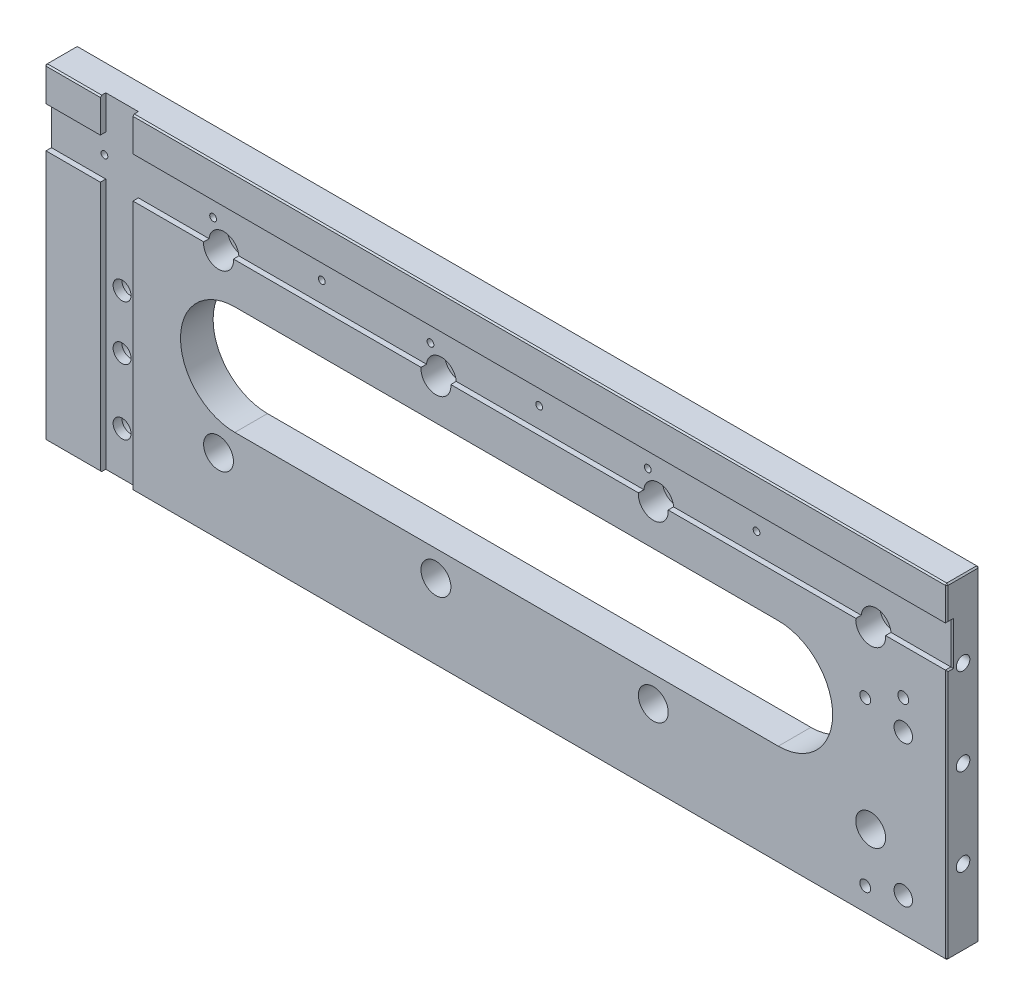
ISO-10303-21;
HEADER;
FILE_DESCRIPTION(('STEP AP214'),'2;1');
FILE_NAME('part.step','',(''),(''),'','','');
FILE_SCHEMA(('AUTOMOTIVE_DESIGN { 1 0 10303 214 1 1 1 1 }'));
ENDSEC;
DATA;
#1=APPLICATION_CONTEXT('core data for automotive mechanical design processes');
#2=APPLICATION_PROTOCOL_DEFINITION('international standard','automotive_design',2000,#1);
#3=PRODUCT_CONTEXT('',#1,'mechanical');
#4=PRODUCT('Part','Part','',(#3));
#5=PRODUCT_RELATED_PRODUCT_CATEGORY('part','',(#4));
#6=PRODUCT_DEFINITION_FORMATION('','',#4);
#7=PRODUCT_DEFINITION_CONTEXT('part definition',#1,'design');
#8=PRODUCT_DEFINITION('design','',#6,#7);
#9=PRODUCT_DEFINITION_SHAPE('','',#8);
#10=(LENGTH_UNIT() NAMED_UNIT(*) SI_UNIT(.MILLI.,.METRE.));
#11=(NAMED_UNIT(*) PLANE_ANGLE_UNIT() SI_UNIT($,.RADIAN.));
#12=(NAMED_UNIT(*) SI_UNIT($,.STERADIAN.) SOLID_ANGLE_UNIT());
#13=UNCERTAINTY_MEASURE_WITH_UNIT(LENGTH_MEASURE(1.E-05),#10,'distance_accuracy_value','');
#14=(GEOMETRIC_REPRESENTATION_CONTEXT(3) GLOBAL_UNCERTAINTY_ASSIGNED_CONTEXT((#13)) GLOBAL_UNIT_ASSIGNED_CONTEXT((#10,
#11,#12)) REPRESENTATION_CONTEXT('',''));
#15=CARTESIAN_POINT('',(0.,0.,0.));
#16=DIRECTION('',(0.,0.,1.));
#17=DIRECTION('',(1.,0.,0.));
#18=AXIS2_PLACEMENT_3D('',#15,#16,#17);
#19=CARTESIAN_POINT('',(0.,0.,12.));
#20=DIRECTION('',(0.,0.,1.));
#21=DIRECTION('',(1.,0.,0.));
#22=AXIS2_PLACEMENT_3D('',#19,#20,#21);
#23=PLANE('',#22);
#24=DIRECTION('',(0.,-1.,0.));
#25=VECTOR('',#24,1.);
#26=CARTESIAN_POINT('',(-145.5,60.,12.));
#27=LINE('',#26,#25);
#28=CARTESIAN_POINT('',(-145.5,32.4999999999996,12.));
#29=VERTEX_POINT('',#28);
#30=CARTESIAN_POINT('',(-145.5,-59.5,12.));
#31=VERTEX_POINT('',#30);
#32=EDGE_CURVE('E389',#29,#31,#27,.T.);
#33=ORIENTED_EDGE('',*,*,#32,.F.);
#34=DIRECTION('',(1.,0.,0.));
#35=VECTOR('',#34,1.);
#36=CARTESIAN_POINT('',(0.,32.5,12.));
#37=LINE('',#36,#35);
#38=CARTESIAN_POINT('',(-165.5,32.4999999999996,12.));
#39=VERTEX_POINT('',#38);
#40=EDGE_CURVE('E694',#39,#29,#37,.T.);
#41=ORIENTED_EDGE('',*,*,#40,.F.);
#42=DIRECTION('',(0.,-1.,0.));
#43=VECTOR('',#42,1.);
#44=CARTESIAN_POINT('',(-165.5,-60.,12.));
#45=LINE('',#44,#43);
#46=CARTESIAN_POINT('',(-165.5,-59.5,12.));
#47=VERTEX_POINT('',#46);
#48=EDGE_CURVE('E1076',#39,#47,#45,.T.);
#49=ORIENTED_EDGE('',*,*,#48,.T.);
#50=DIRECTION('',(1.,0.,0.));
#51=VECTOR('',#50,1.);
#52=CARTESIAN_POINT('',(166.,-59.5,12.));
#53=LINE('',#52,#51);
#54=EDGE_CURVE('E697',#47,#31,#53,.T.);
#55=ORIENTED_EDGE('',*,*,#54,.T.);
#56=EDGE_LOOP('',(#33,#41,#49,#55));
#57=FACE_BOUND('',#56,.T.);
#58=ADVANCED_FACE('F16',(#57),#23,.T.);
#59=CARTESIAN_POINT('',(-145.5,59.5,12.));
#60=VERTEX_POINT('',#59);
#61=CARTESIAN_POINT('',(-145.5,47.5,12.));
#62=VERTEX_POINT('',#61);
#63=EDGE_CURVE('E391',#60,#62,#27,.T.);
#64=ORIENTED_EDGE('',*,*,#63,.F.);
#65=DIRECTION('',(-1.,0.,0.));
#66=VECTOR('',#65,1.);
#67=CARTESIAN_POINT('',(-166.,59.5,12.));
#68=LINE('',#67,#66);
#69=CARTESIAN_POINT('',(-165.5,59.5,12.));
#70=VERTEX_POINT('',#69);
#71=EDGE_CURVE('E1050',#60,#70,#68,.T.);
#72=ORIENTED_EDGE('',*,*,#71,.T.);
#73=DIRECTION('',(0.,-1.,0.));
#74=VECTOR('',#73,1.);
#75=CARTESIAN_POINT('',(-165.5,47.5,12.));
#76=LINE('',#75,#74);
#77=CARTESIAN_POINT('',(-165.5,47.5,12.));
#78=VERTEX_POINT('',#77);
#79=EDGE_CURVE('E1054',#70,#78,#76,.T.);
#80=ORIENTED_EDGE('',*,*,#79,.T.);
#81=DIRECTION('',(-1.,0.,0.));
#82=VECTOR('',#81,1.);
#83=CARTESIAN_POINT('',(0.,47.5,12.));
#84=LINE('',#83,#82);
#85=EDGE_CURVE('E737',#62,#78,#84,.T.);
#86=ORIENTED_EDGE('',*,*,#85,.F.);
#87=EDGE_LOOP('',(#64,#72,#80,#86));
#88=FACE_BOUND('',#87,.T.);
#89=ADVANCED_FACE('F682',(#88),#23,.T.);
#90=CARTESIAN_POINT('',(-166.,32.4999999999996,10.));
#91=DIRECTION('',(0.,-1.,0.));
#92=DIRECTION('',(1.,0.,0.));
#93=AXIS2_PLACEMENT_3D('',#90,#91,#92);
#94=PLANE('',#93);
#95=ORIENTED_EDGE('',*,*,#40,.T.);
#96=DIRECTION('',(0.,0.,-1.));
#97=VECTOR('',#96,1.);
#98=CARTESIAN_POINT('',(-145.5,32.4999999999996,10.));
#99=LINE('',#98,#97);
#100=CARTESIAN_POINT('',(-145.5,32.4999999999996,10.));
#101=VERTEX_POINT('',#100);
#102=EDGE_CURVE('E414',#29,#101,#99,.T.);
#103=ORIENTED_EDGE('',*,*,#102,.T.);
#104=DIRECTION('',(1.,0.,0.));
#105=VECTOR('',#104,1.);
#106=CARTESIAN_POINT('',(-166.,32.4999999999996,10.));
#107=LINE('',#106,#105);
#108=CARTESIAN_POINT('',(-165.5,32.4999999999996,10.));
#109=VERTEX_POINT('',#108);
#110=EDGE_CURVE('E740',#109,#101,#107,.T.);
#111=ORIENTED_EDGE('',*,*,#110,.F.);
#112=DIRECTION('',(0.,0.,1.));
#113=VECTOR('',#112,1.);
#114=CARTESIAN_POINT('',(-165.5,32.4999999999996,10.));
#115=LINE('',#114,#113);
#116=EDGE_CURVE('E704',#109,#39,#115,.T.);
#117=ORIENTED_EDGE('',*,*,#116,.T.);
#118=EDGE_LOOP('',(#95,#103,#111,#117));
#119=FACE_BOUND('',#118,.T.);
#120=ADVANCED_FACE('F534',(#119),#94,.F.);
#121=CARTESIAN_POINT('',(-166.,47.5,10.));
#122=DIRECTION('',(0.,1.,0.));
#123=DIRECTION('',(-1.,0.,0.));
#124=AXIS2_PLACEMENT_3D('',#121,#122,#123);
#125=PLANE('',#124);
#126=DIRECTION('',(1.,0.,0.));
#127=VECTOR('',#126,1.);
#128=CARTESIAN_POINT('',(-166.,47.5,10.));
#129=LINE('',#128,#127);
#130=CARTESIAN_POINT('',(-165.5,47.5,10.));
#131=VERTEX_POINT('',#130);
#132=CARTESIAN_POINT('',(-145.5,47.5,10.));
#133=VERTEX_POINT('',#132);
#134=EDGE_CURVE('E742',#131,#133,#129,.T.);
#135=ORIENTED_EDGE('',*,*,#134,.T.);
#136=DIRECTION('',(0.,0.,1.));
#137=VECTOR('',#136,1.);
#138=CARTESIAN_POINT('',(-145.5,47.5,10.));
#139=LINE('',#138,#137);
#140=EDGE_CURVE('E411',#133,#62,#139,.T.);
#141=ORIENTED_EDGE('',*,*,#140,.T.);
#142=ORIENTED_EDGE('',*,*,#85,.T.);
#143=DIRECTION('',(0.,0.,-1.));
#144=VECTOR('',#143,1.);
#145=CARTESIAN_POINT('',(-165.5,47.5,10.));
#146=LINE('',#145,#144);
#147=EDGE_CURVE('E705',#78,#131,#146,.T.);
#148=ORIENTED_EDGE('',*,*,#147,.T.);
#149=EDGE_LOOP('',(#135,#141,#142,#148));
#150=FACE_BOUND('',#149,.T.);
#151=ADVANCED_FACE('F539',(#150),#125,.F.);
#152=CARTESIAN_POINT('',(0.,-59.5,12.));
#153=DIRECTION('',(0.,-0.707106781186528,0.707106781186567));
#154=DIRECTION('',(-1.,0.,0.));
#155=AXIS2_PLACEMENT_3D('',#152,#153,#154);
#156=PLANE('',#155);
#157=DIRECTION('',(0.,-0.707106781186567,-0.707106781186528));
#158=VECTOR('',#157,1.);
#159=CARTESIAN_POINT('',(-145.5,-59.5,12.));
#160=LINE('',#159,#158);
#161=CARTESIAN_POINT('',(-145.5,-60.,11.5));
#162=VERTEX_POINT('',#161);
#163=EDGE_CURVE('E409',#31,#162,#160,.T.);
#164=ORIENTED_EDGE('',*,*,#163,.F.);
#165=ORIENTED_EDGE('',*,*,#54,.F.);
#166=DIRECTION('',(0.,0.707106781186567,0.707106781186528));
#167=VECTOR('',#166,1.);
#168=CARTESIAN_POINT('',(-165.5,-59.75,11.75));
#169=LINE('',#168,#167);
#170=CARTESIAN_POINT('',(-165.5,-60.,11.5));
#171=VERTEX_POINT('',#170);
#172=EDGE_CURVE('E1177',#47,#171,#169,.F.);
#173=ORIENTED_EDGE('',*,*,#172,.T.);
#174=DIRECTION('',(-1.,0.,0.));
#175=VECTOR('',#174,1.);
#176=CARTESIAN_POINT('',(-166.,-60.,11.5));
#177=LINE('',#176,#175);
#178=EDGE_CURVE('E1099',#162,#171,#177,.T.);
#179=ORIENTED_EDGE('',*,*,#178,.F.);
#180=EDGE_LOOP('',(#164,#165,#173,#179));
#181=FACE_BOUND('',#180,.T.);
#182=ADVANCED_FACE('F633',(#181),#156,.T.);
#183=CARTESIAN_POINT('',(0.,59.5,12.));
#184=DIRECTION('',(0.,0.707106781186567,0.707106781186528));
#185=DIRECTION('',(1.,0.,0.));
#186=AXIS2_PLACEMENT_3D('',#183,#184,#185);
#187=PLANE('',#186);
#188=DIRECTION('',(0.,-0.707106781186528,0.707106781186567));
#189=VECTOR('',#188,1.);
#190=CARTESIAN_POINT('',(-145.5,59.5,12.));
#191=LINE('',#190,#189);
#192=CARTESIAN_POINT('',(-145.5,60.,11.5));
#193=VERTEX_POINT('',#192);
#194=EDGE_CURVE('E11',#193,#60,#191,.T.);
#195=ORIENTED_EDGE('',*,*,#194,.F.);
#196=DIRECTION('',(1.,0.,0.));
#197=VECTOR('',#196,1.);
#198=CARTESIAN_POINT('',(166.,60.,11.5));
#199=LINE('',#198,#197);
#200=CARTESIAN_POINT('',(-165.5,60.,11.5));
#201=VERTEX_POINT('',#200);
#202=EDGE_CURVE('E1115',#201,#193,#199,.T.);
#203=ORIENTED_EDGE('',*,*,#202,.F.);
#204=DIRECTION('',(0.,0.707106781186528,-0.707106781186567));
#205=VECTOR('',#204,1.);
#206=CARTESIAN_POINT('',(-165.5,59.75,11.75));
#207=LINE('',#206,#205);
#208=EDGE_CURVE('E1142',#201,#70,#207,.F.);
#209=ORIENTED_EDGE('',*,*,#208,.T.);
#210=ORIENTED_EDGE('',*,*,#71,.F.);
#211=EDGE_LOOP('',(#195,#203,#209,#210));
#212=FACE_BOUND('',#211,.T.);
#213=ADVANCED_FACE('F596',(#212),#187,.T.);
#214=CARTESIAN_POINT('',(143.477225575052,32.5,10.));
#215=VERTEX_POINT('',#214);
#216=CARTESIAN_POINT('',(165.5,32.5,10.));
#217=VERTEX_POINT('',#216);
#218=EDGE_CURVE('E745',#215,#217,#107,.T.);
#219=ORIENTED_EDGE('',*,*,#218,.F.);
#220=DIRECTION('',(0.,0.,1.));
#221=VECTOR('',#220,1.);
#222=CARTESIAN_POINT('',(143.477225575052,32.5,12.));
#223=LINE('',#222,#221);
#224=CARTESIAN_POINT('',(143.477225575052,32.5,12.));
#225=VERTEX_POINT('',#224);
#226=EDGE_CURVE('E891',#215,#225,#223,.T.);
#227=ORIENTED_EDGE('',*,*,#226,.T.);
#228=CARTESIAN_POINT('',(165.5,32.5,12.));
#229=VERTEX_POINT('',#228);
#230=EDGE_CURVE('E711',#225,#229,#37,.T.);
#231=ORIENTED_EDGE('',*,*,#230,.T.);
#232=DIRECTION('',(0.,0.,-1.));
#233=VECTOR('',#232,1.);
#234=CARTESIAN_POINT('',(165.5,32.5,10.));
#235=LINE('',#234,#233);
#236=EDGE_CURVE('E1074',#229,#217,#235,.T.);
#237=ORIENTED_EDGE('',*,*,#236,.T.);
#238=EDGE_LOOP('',(#219,#227,#231,#237));
#239=FACE_BOUND('',#238,.T.);
#240=ADVANCED_FACE('F1230',(#239),#94,.F.);
#241=CARTESIAN_POINT('',(63.4772255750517,32.5,12.));
#242=VERTEX_POINT('',#241);
#243=CARTESIAN_POINT('',(132.522774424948,32.5,12.));
#244=VERTEX_POINT('',#243);
#245=EDGE_CURVE('E720',#242,#244,#37,.T.);
#246=ORIENTED_EDGE('',*,*,#245,.T.);
#247=DIRECTION('',(0.,0.,1.));
#248=VECTOR('',#247,1.);
#249=CARTESIAN_POINT('',(132.522774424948,32.5,12.));
#250=LINE('',#249,#248);
#251=CARTESIAN_POINT('',(132.522774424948,32.5,10.));
#252=VERTEX_POINT('',#251);
#253=EDGE_CURVE('E893',#244,#252,#250,.F.);
#254=ORIENTED_EDGE('',*,*,#253,.T.);
#255=CARTESIAN_POINT('',(63.4772255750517,32.5,10.));
#256=VERTEX_POINT('',#255);
#257=EDGE_CURVE('E1228',#256,#252,#107,.T.);
#258=ORIENTED_EDGE('',*,*,#257,.F.);
#259=DIRECTION('',(0.,0.,1.));
#260=VECTOR('',#259,1.);
#261=CARTESIAN_POINT('',(63.4772255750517,32.5,12.));
#262=LINE('',#261,#260);
#263=EDGE_CURVE('E864',#256,#242,#262,.T.);
#264=ORIENTED_EDGE('',*,*,#263,.T.);
#265=EDGE_LOOP('',(#246,#254,#258,#264));
#266=FACE_BOUND('',#265,.T.);
#267=ADVANCED_FACE('F1248',(#266),#94,.F.);
#268=CARTESIAN_POINT('',(-16.5227744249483,32.5,12.));
#269=VERTEX_POINT('',#268);
#270=CARTESIAN_POINT('',(52.5227744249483,32.5,12.));
#271=VERTEX_POINT('',#270);
#272=EDGE_CURVE('E714',#269,#271,#37,.T.);
#273=ORIENTED_EDGE('',*,*,#272,.T.);
#274=DIRECTION('',(0.,0.,1.));
#275=VECTOR('',#274,1.);
#276=CARTESIAN_POINT('',(52.5227744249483,32.5,12.));
#277=LINE('',#276,#275);
#278=CARTESIAN_POINT('',(52.5227744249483,32.5,10.));
#279=VERTEX_POINT('',#278);
#280=EDGE_CURVE('E866',#271,#279,#277,.F.);
#281=ORIENTED_EDGE('',*,*,#280,.T.);
#282=CARTESIAN_POINT('',(-16.5227744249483,32.5,10.));
#283=VERTEX_POINT('',#282);
#284=EDGE_CURVE('E1233',#283,#279,#107,.T.);
#285=ORIENTED_EDGE('',*,*,#284,.F.);
#286=DIRECTION('',(0.,0.,1.));
#287=VECTOR('',#286,1.);
#288=CARTESIAN_POINT('',(-16.5227744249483,32.5,12.));
#289=LINE('',#288,#287);
#290=EDGE_CURVE('E837',#283,#269,#289,.T.);
#291=ORIENTED_EDGE('',*,*,#290,.T.);
#292=EDGE_LOOP('',(#273,#281,#285,#291));
#293=FACE_BOUND('',#292,.T.);
#294=ADVANCED_FACE('F1240',(#293),#94,.F.);
#295=CARTESIAN_POINT('',(-96.5227744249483,32.5,12.));
#296=VERTEX_POINT('',#295);
#297=CARTESIAN_POINT('',(-27.4772255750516,32.5,12.));
#298=VERTEX_POINT('',#297);
#299=EDGE_CURVE('E708',#296,#298,#37,.T.);
#300=ORIENTED_EDGE('',*,*,#299,.T.);
#301=DIRECTION('',(0.,0.,1.));
#302=VECTOR('',#301,1.);
#303=CARTESIAN_POINT('',(-27.4772255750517,32.5,12.));
#304=LINE('',#303,#302);
#305=CARTESIAN_POINT('',(-27.4772255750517,32.5,10.));
#306=VERTEX_POINT('',#305);
#307=EDGE_CURVE('E839',#298,#306,#304,.F.);
#308=ORIENTED_EDGE('',*,*,#307,.T.);
#309=CARTESIAN_POINT('',(-96.5227744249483,32.5,10.));
#310=VERTEX_POINT('',#309);
#311=EDGE_CURVE('E749',#310,#306,#107,.T.);
#312=ORIENTED_EDGE('',*,*,#311,.F.);
#313=DIRECTION('',(0.,0.,1.));
#314=VECTOR('',#313,1.);
#315=CARTESIAN_POINT('',(-96.5227744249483,32.5,12.));
#316=LINE('',#315,#314);
#317=EDGE_CURVE('E1215',#310,#296,#316,.T.);
#318=ORIENTED_EDGE('',*,*,#317,.T.);
#319=EDGE_LOOP('',(#300,#308,#312,#318));
#320=FACE_BOUND('',#319,.T.);
#321=ADVANCED_FACE('F535',(#320),#94,.F.);
#322=DIRECTION('',(0.,-1.,0.));
#323=VECTOR('',#322,1.);
#324=CARTESIAN_POINT('',(-133.5,60.,12.));
#325=LINE('',#324,#323);
#326=CARTESIAN_POINT('',(-133.5,32.4999999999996,12.));
#327=VERTEX_POINT('',#326);
#328=CARTESIAN_POINT('',(-133.5,-59.5,12.));
#329=VERTEX_POINT('',#328);
#330=EDGE_CURVE('E392',#327,#329,#325,.T.);
#331=ORIENTED_EDGE('',*,*,#330,.T.);
#332=CARTESIAN_POINT('',(165.5,-59.5,12.));
#333=VERTEX_POINT('',#332);
#334=EDGE_CURVE('E1078',#329,#333,#53,.T.);
#335=ORIENTED_EDGE('',*,*,#334,.T.);
#336=DIRECTION('',(0.,1.,0.));
#337=VECTOR('',#336,1.);
#338=CARTESIAN_POINT('',(165.5,32.5,12.));
#339=LINE('',#338,#337);
#340=EDGE_CURVE('E1080',#333,#229,#339,.T.);
#341=ORIENTED_EDGE('',*,*,#340,.T.);
#342=ORIENTED_EDGE('',*,*,#230,.F.);
#343=CARTESIAN_POINT('',(138.,32.,12.));
#344=DIRECTION('',(0.,0.,1.));
#345=DIRECTION('',(1.,0.,0.));
#346=AXIS2_PLACEMENT_3D('',#343,#344,#345);
#347=CIRCLE('',#346,5.5);
#348=EDGE_CURVE('E904',#244,#225,#347,.T.);
#349=ORIENTED_EDGE('',*,*,#348,.F.);
#350=ORIENTED_EDGE('',*,*,#245,.F.);
#351=CARTESIAN_POINT('',(58.,32.,12.));
#352=DIRECTION('',(0.,0.,1.));
#353=DIRECTION('',(1.,0.,0.));
#354=AXIS2_PLACEMENT_3D('',#351,#352,#353);
#355=CIRCLE('',#354,5.5);
#356=EDGE_CURVE('E877',#271,#242,#355,.T.);
#357=ORIENTED_EDGE('',*,*,#356,.F.);
#358=ORIENTED_EDGE('',*,*,#272,.F.);
#359=CARTESIAN_POINT('',(-22.,32.,12.));
#360=DIRECTION('',(0.,0.,1.));
#361=DIRECTION('',(1.,0.,0.));
#362=AXIS2_PLACEMENT_3D('',#359,#360,#361);
#363=CIRCLE('',#362,5.5);
#364=EDGE_CURVE('E850',#298,#269,#363,.T.);
#365=ORIENTED_EDGE('',*,*,#364,.F.);
#366=ORIENTED_EDGE('',*,*,#299,.F.);
#367=CARTESIAN_POINT('',(-102.,32.,12.));
#368=DIRECTION('',(0.,0.,1.));
#369=DIRECTION('',(1.,0.,0.));
#370=AXIS2_PLACEMENT_3D('',#367,#368,#369);
#371=CIRCLE('',#370,5.5);
#372=CARTESIAN_POINT('',(-107.477225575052,32.5,12.));
#373=VERTEX_POINT('',#372);
#374=EDGE_CURVE('E823',#373,#296,#371,.T.);
#375=ORIENTED_EDGE('',*,*,#374,.F.);
#376=EDGE_CURVE('E706',#327,#373,#37,.T.);
#377=ORIENTED_EDGE('',*,*,#376,.F.);
#378=EDGE_LOOP('',(#331,#335,#341,#342,#349,#350,#357,#358,#365,#366,#375,#377));
#379=FACE_BOUND('',#378,.T.);
#380=CARTESIAN_POINT('',(136.,8.99999918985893,12.));
#381=DIRECTION('',(0.,0.,1.));
#382=DIRECTION('',(1.,0.,0.));
#383=AXIS2_PLACEMENT_3D('',#380,#381,#382);
#384=CIRCLE('',#383,2.);
#385=CARTESIAN_POINT('',(138.,8.99999918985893,12.));
#386=VERTEX_POINT('',#385);
#387=EDGE_CURVE('E417',#386,#386,#384,.T.);
#388=ORIENTED_EDGE('',*,*,#387,.F.);
#389=EDGE_LOOP('',(#388));
#390=FACE_BOUND('',#389,.T.);
#391=CARTESIAN_POINT('',(136.,-51.0000008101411,12.));
#392=DIRECTION('',(0.,0.,1.));
#393=DIRECTION('',(1.,0.,0.));
#394=AXIS2_PLACEMENT_3D('',#391,#392,#393);
#395=CIRCLE('',#394,2.);
#396=CARTESIAN_POINT('',(138.,-51.0000008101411,12.));
#397=VERTEX_POINT('',#396);
#398=EDGE_CURVE('E423',#397,#397,#395,.T.);
#399=ORIENTED_EDGE('',*,*,#398,.F.);
#400=EDGE_LOOP('',(#399));
#401=FACE_BOUND('',#400,.T.);
#402=CARTESIAN_POINT('',(150.,15.9999991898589,12.));
#403=DIRECTION('',(0.,0.,1.));
#404=DIRECTION('',(1.,0.,0.));
#405=AXIS2_PLACEMENT_3D('',#402,#403,#404);
#406=CIRCLE('',#405,2.);
#407=CARTESIAN_POINT('',(152.,15.9999991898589,12.));
#408=VERTEX_POINT('',#407);
#409=EDGE_CURVE('E429',#408,#408,#406,.T.);
#410=ORIENTED_EDGE('',*,*,#409,.F.);
#411=EDGE_LOOP('',(#410));
#412=FACE_BOUND('',#411,.T.);
#413=CARTESIAN_POINT('',(150.,-47.0000008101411,12.));
#414=DIRECTION('',(0.,0.,1.));
#415=DIRECTION('',(1.,0.,0.));
#416=AXIS2_PLACEMENT_3D('',#413,#414,#415);
#417=CIRCLE('',#416,3.4);
#418=CARTESIAN_POINT('',(153.4,-47.0000008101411,12.));
#419=VERTEX_POINT('',#418);
#420=EDGE_CURVE('E435',#419,#419,#417,.T.);
#421=ORIENTED_EDGE('',*,*,#420,.F.);
#422=EDGE_LOOP('',(#421));
#423=FACE_BOUND('',#422,.T.);
#424=CARTESIAN_POINT('',(150.,4.99999918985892,12.));
#425=DIRECTION('',(0.,0.,1.));
#426=DIRECTION('',(1.,0.,0.));
#427=AXIS2_PLACEMENT_3D('',#424,#425,#426);
#428=CIRCLE('',#427,3.4);
#429=CARTESIAN_POINT('',(153.4,4.99999918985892,12.));
#430=VERTEX_POINT('',#429);
#431=EDGE_CURVE('E441',#430,#430,#428,.T.);
#432=ORIENTED_EDGE('',*,*,#431,.F.);
#433=EDGE_LOOP('',(#432));
#434=FACE_BOUND('',#433,.T.);
#435=CARTESIAN_POINT('',(104.,-2.5,12.));
#436=DIRECTION('',(0.,0.,1.));
#437=DIRECTION('',(1.,0.,0.));
#438=AXIS2_PLACEMENT_3D('',#435,#436,#437);
#439=CIRCLE('',#438,20.);
#440=CARTESIAN_POINT('',(104.,-22.5,12.));
#441=VERTEX_POINT('',#440);
#442=CARTESIAN_POINT('',(104.,17.5,12.));
#443=VERTEX_POINT('',#442);
#444=EDGE_CURVE('E456',#441,#443,#439,.T.);
#445=ORIENTED_EDGE('',*,*,#444,.F.);
#446=DIRECTION('',(1.,0.,0.));
#447=VECTOR('',#446,1.);
#448=CARTESIAN_POINT('',(104.,-22.5,12.));
#449=LINE('',#448,#447);
#450=CARTESIAN_POINT('',(-96.,-22.5,12.));
#451=VERTEX_POINT('',#450);
#452=EDGE_CURVE('E928',#451,#441,#449,.T.);
#453=ORIENTED_EDGE('',*,*,#452,.F.);
#454=CARTESIAN_POINT('',(-96.,-2.50000000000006,12.));
#455=DIRECTION('',(0.,0.,1.));
#456=DIRECTION('',(1.,0.,0.));
#457=AXIS2_PLACEMENT_3D('',#454,#455,#456);
#458=CIRCLE('',#457,20.);
#459=CARTESIAN_POINT('',(-96.,17.5,12.));
#460=VERTEX_POINT('',#459);
#461=EDGE_CURVE('E931',#460,#451,#458,.T.);
#462=ORIENTED_EDGE('',*,*,#461,.F.);
#463=DIRECTION('',(-1.,0.,0.));
#464=VECTOR('',#463,1.);
#465=CARTESIAN_POINT('',(104.,17.5,12.));
#466=LINE('',#465,#464);
#467=EDGE_CURVE('E934',#443,#460,#466,.T.);
#468=ORIENTED_EDGE('',*,*,#467,.F.);
#469=EDGE_LOOP('',(#445,#453,#462,#468));
#470=FACE_BOUND('',#469,.T.);
#471=CARTESIAN_POINT('',(138.,-32.,12.));
#472=DIRECTION('',(0.,0.,1.));
#473=DIRECTION('',(1.,0.,0.));
#474=AXIS2_PLACEMENT_3D('',#471,#472,#473);
#475=CIRCLE('',#474,5.5);
#476=CARTESIAN_POINT('',(143.5,-32.,12.));
#477=VERTEX_POINT('',#476);
#478=EDGE_CURVE('E915',#477,#477,#475,.T.);
#479=ORIENTED_EDGE('',*,*,#478,.F.);
#480=EDGE_LOOP('',(#479));
#481=FACE_BOUND('',#480,.T.);
#482=CARTESIAN_POINT('',(58.,-32.,12.));
#483=DIRECTION('',(0.,0.,1.));
#484=DIRECTION('',(1.,0.,0.));
#485=AXIS2_PLACEMENT_3D('',#482,#483,#484);
#486=CIRCLE('',#485,5.5);
#487=CARTESIAN_POINT('',(63.5,-32.,12.));
#488=VERTEX_POINT('',#487);
#489=EDGE_CURVE('E888',#488,#488,#486,.T.);
#490=ORIENTED_EDGE('',*,*,#489,.F.);
#491=EDGE_LOOP('',(#490));
#492=FACE_BOUND('',#491,.T.);
#493=CARTESIAN_POINT('',(-22.,-32.,12.));
#494=DIRECTION('',(0.,0.,1.));
#495=DIRECTION('',(1.,0.,0.));
#496=AXIS2_PLACEMENT_3D('',#493,#494,#495);
#497=CIRCLE('',#496,5.5);
#498=CARTESIAN_POINT('',(-16.5,-32.,12.));
#499=VERTEX_POINT('',#498);
#500=EDGE_CURVE('E861',#499,#499,#497,.T.);
#501=ORIENTED_EDGE('',*,*,#500,.F.);
#502=EDGE_LOOP('',(#501));
#503=FACE_BOUND('',#502,.T.);
#504=CARTESIAN_POINT('',(-102.,-32.,12.));
#505=DIRECTION('',(0.,0.,1.));
#506=DIRECTION('',(1.,0.,0.));
#507=AXIS2_PLACEMENT_3D('',#504,#505,#506);
#508=CIRCLE('',#507,5.5);
#509=CARTESIAN_POINT('',(-96.5,-32.,12.));
#510=VERTEX_POINT('',#509);
#511=EDGE_CURVE('E834',#510,#510,#508,.T.);
#512=ORIENTED_EDGE('',*,*,#511,.F.);
#513=EDGE_LOOP('',(#512));
#514=FACE_BOUND('',#513,.T.);
#515=ADVANCED_FACE('F549',(#379,#390,#401,#412,#423,#434,#470,#481,#492,#503,#514),#23,.T.);
#516=CARTESIAN_POINT('',(166.,60.,12.));
#517=DIRECTION('',(-1.,0.,0.));
#518=DIRECTION('',(0.,-1.,0.));
#519=AXIS2_PLACEMENT_3D('',#516,#517,#518);
#520=PLANE('',#519);
#521=CARTESIAN_POINT('',(166.,-32.,5.99999999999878));
#522=DIRECTION('',(1.,0.,0.));
#523=DIRECTION('',(0.,0.,-1.));
#524=AXIS2_PLACEMENT_3D('',#521,#522,#523);
#525=CIRCLE('',#524,2.5);
#526=CARTESIAN_POINT('',(166.,-32.,3.49999999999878));
#527=VERTEX_POINT('',#526);
#528=EDGE_CURVE('E808',#527,#527,#525,.T.);
#529=ORIENTED_EDGE('',*,*,#528,.F.);
#530=EDGE_LOOP('',(#529));
#531=FACE_BOUND('',#530,.T.);
#532=CARTESIAN_POINT('',(166.,-1.29174448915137E-13,5.99999999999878));
#533=DIRECTION('',(1.,0.,0.));
#534=DIRECTION('',(0.,0.,-1.));
#535=AXIS2_PLACEMENT_3D('',#532,#533,#534);
#536=CIRCLE('',#535,2.5);
#537=CARTESIAN_POINT('',(166.,-1.29174448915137E-13,3.49999999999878));
#538=VERTEX_POINT('',#537);
#539=EDGE_CURVE('E802',#538,#538,#536,.T.);
#540=ORIENTED_EDGE('',*,*,#539,.F.);
#541=EDGE_LOOP('',(#540));
#542=FACE_BOUND('',#541,.T.);
#543=CARTESIAN_POINT('',(166.,32.,5.99999999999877));
#544=DIRECTION('',(1.,0.,0.));
#545=DIRECTION('',(0.,0.,-1.));
#546=AXIS2_PLACEMENT_3D('',#543,#544,#545);
#547=CIRCLE('',#546,2.5);
#548=CARTESIAN_POINT('',(166.,32.,3.49999999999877));
#549=VERTEX_POINT('',#548);
#550=EDGE_CURVE('E796',#549,#549,#547,.T.);
#551=ORIENTED_EDGE('',*,*,#550,.F.);
#552=EDGE_LOOP('',(#551));
#553=FACE_BOUND('',#552,.T.);
#554=DIRECTION('',(0.,0.,-1.));
#555=VECTOR('',#554,1.);
#556=CARTESIAN_POINT('',(166.,48.,12.));
#557=LINE('',#556,#555);
#558=CARTESIAN_POINT('',(166.,48.,11.5));
#559=VERTEX_POINT('',#558);
#560=CARTESIAN_POINT('',(166.,48.,9.5));
#561=VERTEX_POINT('',#560);
#562=EDGE_CURVE('E1031',#559,#561,#557,.T.);
#563=ORIENTED_EDGE('',*,*,#562,.T.);
#564=DIRECTION('',(0.,-1.,0.));
#565=VECTOR('',#564,1.);
#566=CARTESIAN_POINT('',(166.,60.,9.5));
#567=LINE('',#566,#565);
#568=CARTESIAN_POINT('',(166.,32.,9.5));
#569=VERTEX_POINT('',#568);
#570=EDGE_CURVE('E1033',#561,#569,#567,.T.);
#571=ORIENTED_EDGE('',*,*,#570,.T.);
#572=DIRECTION('',(0.,0.,1.));
#573=VECTOR('',#572,1.);
#574=CARTESIAN_POINT('',(166.,32.,12.));
#575=LINE('',#574,#573);
#576=CARTESIAN_POINT('',(166.,32.,11.5));
#577=VERTEX_POINT('',#576);
#578=EDGE_CURVE('E1047',#569,#577,#575,.T.);
#579=ORIENTED_EDGE('',*,*,#578,.T.);
#580=DIRECTION('',(0.,-1.,0.));
#581=VECTOR('',#580,1.);
#582=CARTESIAN_POINT('',(166.,-60.,11.5));
#583=LINE('',#582,#581);
#584=CARTESIAN_POINT('',(166.,-59.5,11.5));
#585=VERTEX_POINT('',#584);
#586=EDGE_CURVE('E1040',#577,#585,#583,.T.);
#587=ORIENTED_EDGE('',*,*,#586,.T.);
#588=DIRECTION('',(0.,0.,-1.));
#589=VECTOR('',#588,1.);
#590=CARTESIAN_POINT('',(166.,-59.5,12.));
#591=LINE('',#590,#589);
#592=CARTESIAN_POINT('',(166.,-59.5,0.499999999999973));
#593=VERTEX_POINT('',#592);
#594=EDGE_CURVE('E1038',#585,#593,#591,.T.);
#595=ORIENTED_EDGE('',*,*,#594,.T.);
#596=DIRECTION('',(0.,1.,0.));
#597=VECTOR('',#596,1.);
#598=CARTESIAN_POINT('',(166.,60.,0.499999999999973));
#599=LINE('',#598,#597);
#600=CARTESIAN_POINT('',(166.,59.5,0.499999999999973));
#601=VERTEX_POINT('',#600);
#602=EDGE_CURVE('E1042',#593,#601,#599,.T.);
#603=ORIENTED_EDGE('',*,*,#602,.T.);
#604=DIRECTION('',(0.,0.,1.));
#605=VECTOR('',#604,1.);
#606=CARTESIAN_POINT('',(166.,59.5,12.));
#607=LINE('',#606,#605);
#608=CARTESIAN_POINT('',(166.,59.5,11.5));
#609=VERTEX_POINT('',#608);
#610=EDGE_CURVE('E2364',#601,#609,#607,.T.);
#611=ORIENTED_EDGE('',*,*,#610,.T.);
#612=DIRECTION('',(0.,-1.,0.));
#613=VECTOR('',#612,1.);
#614=CARTESIAN_POINT('',(166.,47.5,11.5));
#615=LINE('',#614,#613);
#616=EDGE_CURVE('E1036',#609,#559,#615,.T.);
#617=ORIENTED_EDGE('',*,*,#616,.T.);
#618=EDGE_LOOP('',(#563,#571,#579,#587,#595,#603,#611,#617));
#619=FACE_BOUND('',#618,.T.);
#620=ADVANCED_FACE('F563',(#531,#542,#553,#619),#520,.F.);
#621=CARTESIAN_POINT('',(-166.,60.,12.));
#622=DIRECTION('',(0.,-1.,0.));
#623=DIRECTION('',(0.,0.,-1.));
#624=AXIS2_PLACEMENT_3D('',#621,#622,#623);
#625=PLANE('',#624);
#626=ORIENTED_EDGE('',*,*,#202,.T.);
#627=DIRECTION('',(0.,0.,-1.));
#628=VECTOR('',#627,1.);
#629=CARTESIAN_POINT('',(-145.5,60.,12.));
#630=LINE('',#629,#628);
#631=CARTESIAN_POINT('',(-145.5,60.,10.));
#632=VERTEX_POINT('',#631);
#633=EDGE_CURVE('E373',#193,#632,#630,.T.);
#634=ORIENTED_EDGE('',*,*,#633,.T.);
#635=DIRECTION('',(1.,0.,0.));
#636=VECTOR('',#635,1.);
#637=CARTESIAN_POINT('',(-145.5,60.,10.));
#638=LINE('',#637,#636);
#639=CARTESIAN_POINT('',(-133.5,60.,10.));
#640=VERTEX_POINT('',#639);
#641=EDGE_CURVE('E376',#632,#640,#638,.T.);
#642=ORIENTED_EDGE('',*,*,#641,.T.);
#643=DIRECTION('',(0.,0.,1.));
#644=VECTOR('',#643,1.);
#645=CARTESIAN_POINT('',(-133.5,60.,12.));
#646=LINE('',#645,#644);
#647=CARTESIAN_POINT('',(-133.5,60.,11.5));
#648=VERTEX_POINT('',#647);
#649=EDGE_CURVE('E379',#640,#648,#646,.T.);
#650=ORIENTED_EDGE('',*,*,#649,.T.);
#651=CARTESIAN_POINT('',(165.5,60.,11.5));
#652=VERTEX_POINT('',#651);
#653=EDGE_CURVE('E1114',#648,#652,#199,.T.);
#654=ORIENTED_EDGE('',*,*,#653,.T.);
#655=DIRECTION('',(0.,0.,-1.));
#656=VECTOR('',#655,1.);
#657=CARTESIAN_POINT('',(165.5,60.,12.));
#658=LINE('',#657,#656);
#659=CARTESIAN_POINT('',(165.5,60.,0.499999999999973));
#660=VERTEX_POINT('',#659);
#661=EDGE_CURVE('E1118',#652,#660,#658,.T.);
#662=ORIENTED_EDGE('',*,*,#661,.T.);
#663=DIRECTION('',(-1.,0.,0.));
#664=VECTOR('',#663,1.);
#665=CARTESIAN_POINT('',(-166.,60.,0.499999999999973));
#666=LINE('',#665,#664);
#667=CARTESIAN_POINT('',(-165.5,60.,0.499999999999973));
#668=VERTEX_POINT('',#667);
#669=EDGE_CURVE('E1110',#660,#668,#666,.T.);
#670=ORIENTED_EDGE('',*,*,#669,.T.);
#671=DIRECTION('',(0.,0.,1.));
#672=VECTOR('',#671,1.);
#673=CARTESIAN_POINT('',(-165.5,60.,12.));
#674=LINE('',#673,#672);
#675=EDGE_CURVE('E1112',#668,#201,#674,.T.);
#676=ORIENTED_EDGE('',*,*,#675,.T.);
#677=EDGE_LOOP('',(#626,#634,#642,#650,#654,#662,#670,#676));
#678=FACE_BOUND('',#677,.T.);
#679=ADVANCED_FACE('F559',(#678),#625,.F.);
#680=CARTESIAN_POINT('',(-166.,60.,12.));
#681=DIRECTION('',(1.,0.,0.));
#682=DIRECTION('',(0.,1.,0.));
#683=AXIS2_PLACEMENT_3D('',#680,#681,#682);
#684=PLANE('',#683);
#685=DIRECTION('',(0.,0.,-1.));
#686=VECTOR('',#685,1.);
#687=CARTESIAN_POINT('',(-166.,59.5,12.));
#688=LINE('',#687,#686);
#689=CARTESIAN_POINT('',(-166.,59.5,11.5));
#690=VERTEX_POINT('',#689);
#691=CARTESIAN_POINT('',(-166.,59.5,0.499999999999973));
#692=VERTEX_POINT('',#691);
#693=EDGE_CURVE('E1082',#690,#692,#688,.T.);
#694=ORIENTED_EDGE('',*,*,#693,.T.);
#695=DIRECTION('',(0.,-1.,0.));
#696=VECTOR('',#695,1.);
#697=CARTESIAN_POINT('',(-166.,60.,0.499999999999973));
#698=LINE('',#697,#696);
#699=CARTESIAN_POINT('',(-166.,-59.5,0.499999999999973));
#700=VERTEX_POINT('',#699);
#701=EDGE_CURVE('E1096',#692,#700,#698,.T.);
#702=ORIENTED_EDGE('',*,*,#701,.T.);
#703=DIRECTION('',(0.,0.,1.));
#704=VECTOR('',#703,1.);
#705=CARTESIAN_POINT('',(-166.,-59.5,12.));
#706=LINE('',#705,#704);
#707=CARTESIAN_POINT('',(-166.,-59.5,11.5));
#708=VERTEX_POINT('',#707);
#709=EDGE_CURVE('E1094',#700,#708,#706,.T.);
#710=ORIENTED_EDGE('',*,*,#709,.T.);
#711=DIRECTION('',(0.,1.,0.));
#712=VECTOR('',#711,1.);
#713=CARTESIAN_POINT('',(-166.,32.4999999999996,11.5));
#714=LINE('',#713,#712);
#715=CARTESIAN_POINT('',(-166.,32.,11.5));
#716=VERTEX_POINT('',#715);
#717=EDGE_CURVE('E1092',#708,#716,#714,.T.);
#718=ORIENTED_EDGE('',*,*,#717,.T.);
#719=DIRECTION('',(0.,0.,-1.));
#720=VECTOR('',#719,1.);
#721=CARTESIAN_POINT('',(-166.,32.,12.));
#722=LINE('',#721,#720);
#723=CARTESIAN_POINT('',(-166.,32.,9.5));
#724=VERTEX_POINT('',#723);
#725=EDGE_CURVE('E1090',#716,#724,#722,.T.);
#726=ORIENTED_EDGE('',*,*,#725,.T.);
#727=DIRECTION('',(0.,1.,0.));
#728=VECTOR('',#727,1.);
#729=CARTESIAN_POINT('',(-166.,60.,9.5));
#730=LINE('',#729,#728);
#731=CARTESIAN_POINT('',(-166.,48.,9.5));
#732=VERTEX_POINT('',#731);
#733=EDGE_CURVE('E1088',#724,#732,#730,.T.);
#734=ORIENTED_EDGE('',*,*,#733,.T.);
#735=DIRECTION('',(0.,0.,1.));
#736=VECTOR('',#735,1.);
#737=CARTESIAN_POINT('',(-166.,48.,12.));
#738=LINE('',#737,#736);
#739=CARTESIAN_POINT('',(-166.,48.,11.5));
#740=VERTEX_POINT('',#739);
#741=EDGE_CURVE('E1086',#732,#740,#738,.T.);
#742=ORIENTED_EDGE('',*,*,#741,.T.);
#743=DIRECTION('',(0.,1.,0.));
#744=VECTOR('',#743,1.);
#745=CARTESIAN_POINT('',(-166.,60.,11.5));
#746=LINE('',#745,#744);
#747=EDGE_CURVE('E1084',#740,#690,#746,.T.);
#748=ORIENTED_EDGE('',*,*,#747,.T.);
#749=EDGE_LOOP('',(#694,#702,#710,#718,#726,#734,#742,#748));
#750=FACE_BOUND('',#749,.T.);
#751=ADVANCED_FACE('F555',(#750),#684,.F.);
#752=CARTESIAN_POINT('',(-166.,-60.,12.));
#753=DIRECTION('',(0.,1.,0.));
#754=DIRECTION('',(0.,0.,1.));
#755=AXIS2_PLACEMENT_3D('',#752,#753,#754);
#756=PLANE('',#755);
#757=CARTESIAN_POINT('',(-114.,-60.,5.99999999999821));
#758=DIRECTION('',(0.,-1.,0.));
#759=DIRECTION('',(0.,0.,-1.));
#760=AXIS2_PLACEMENT_3D('',#757,#758,#759);
#761=CIRCLE('',#760,1.24999999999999);
#762=CARTESIAN_POINT('',(-114.,-60.,4.74999999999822));
#763=VERTEX_POINT('',#762);
#764=EDGE_CURVE('E322',#763,#763,#761,.T.);
#765=ORIENTED_EDGE('',*,*,#764,.F.);
#766=EDGE_LOOP('',(#765));
#767=FACE_BOUND('',#766,.T.);
#768=CARTESIAN_POINT('',(-108.,-60.,5.99999999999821));
#769=DIRECTION('',(0.,-1.,0.));
#770=DIRECTION('',(0.,0.,-1.));
#771=AXIS2_PLACEMENT_3D('',#768,#769,#770);
#772=CIRCLE('',#771,1.24999999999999);
#773=CARTESIAN_POINT('',(-108.,-60.,4.74999999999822));
#774=VERTEX_POINT('',#773);
#775=EDGE_CURVE('E321',#774,#774,#772,.T.);
#776=ORIENTED_EDGE('',*,*,#775,.F.);
#777=EDGE_LOOP('',(#776));
#778=FACE_BOUND('',#777,.T.);
#779=CARTESIAN_POINT('',(89.,-60.,5.99999999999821));
#780=DIRECTION('',(0.,-1.,0.));
#781=DIRECTION('',(0.,0.,-1.));
#782=AXIS2_PLACEMENT_3D('',#779,#780,#781);
#783=CIRCLE('',#782,1.24999999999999);
#784=CARTESIAN_POINT('',(89.,-60.,4.74999999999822));
#785=VERTEX_POINT('',#784);
#786=EDGE_CURVE('E332',#785,#785,#783,.T.);
#787=ORIENTED_EDGE('',*,*,#786,.F.);
#788=EDGE_LOOP('',(#787));
#789=FACE_BOUND('',#788,.T.);
#790=CARTESIAN_POINT('',(95.,-60.,5.99999999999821));
#791=DIRECTION('',(0.,-1.,0.));
#792=DIRECTION('',(0.,0.,-1.));
#793=AXIS2_PLACEMENT_3D('',#790,#791,#792);
#794=CIRCLE('',#793,1.24999999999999);
#795=CARTESIAN_POINT('',(95.,-60.,4.74999999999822));
#796=VERTEX_POINT('',#795);
#797=EDGE_CURVE('E338',#796,#796,#794,.T.);
#798=ORIENTED_EDGE('',*,*,#797,.F.);
#799=EDGE_LOOP('',(#798));
#800=FACE_BOUND('',#799,.T.);
#801=DIRECTION('',(1.,0.,0.));
#802=VECTOR('',#801,1.);
#803=CARTESIAN_POINT('',(-145.5,-60.,10.));
#804=LINE('',#803,#802);
#805=CARTESIAN_POINT('',(-145.5,-60.,10.));
#806=VERTEX_POINT('',#805);
#807=CARTESIAN_POINT('',(-133.5,-60.,10.));
#808=VERTEX_POINT('',#807);
#809=EDGE_CURVE('E385',#806,#808,#804,.T.);
#810=ORIENTED_EDGE('',*,*,#809,.F.);
#811=DIRECTION('',(0.,0.,-1.));
#812=VECTOR('',#811,1.);
#813=CARTESIAN_POINT('',(-145.5,-60.,12.));
#814=LINE('',#813,#812);
#815=EDGE_CURVE('E383',#162,#806,#814,.T.);
#816=ORIENTED_EDGE('',*,*,#815,.F.);
#817=ORIENTED_EDGE('',*,*,#178,.T.);
#818=DIRECTION('',(0.,0.,-1.));
#819=VECTOR('',#818,1.);
#820=CARTESIAN_POINT('',(-165.5,-60.,12.));
#821=LINE('',#820,#819);
#822=CARTESIAN_POINT('',(-165.5,-60.,0.499999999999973));
#823=VERTEX_POINT('',#822);
#824=EDGE_CURVE('E1107',#171,#823,#821,.T.);
#825=ORIENTED_EDGE('',*,*,#824,.T.);
#826=DIRECTION('',(1.,0.,0.));
#827=VECTOR('',#826,1.);
#828=CARTESIAN_POINT('',(-166.,-60.,0.499999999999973));
#829=LINE('',#828,#827);
#830=CARTESIAN_POINT('',(165.5,-60.,0.499999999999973));
#831=VERTEX_POINT('',#830);
#832=EDGE_CURVE('E1105',#823,#831,#829,.T.);
#833=ORIENTED_EDGE('',*,*,#832,.T.);
#834=DIRECTION('',(0.,0.,1.));
#835=VECTOR('',#834,1.);
#836=CARTESIAN_POINT('',(165.5,-60.,12.));
#837=LINE('',#836,#835);
#838=CARTESIAN_POINT('',(165.5,-60.,11.5));
#839=VERTEX_POINT('',#838);
#840=EDGE_CURVE('E1103',#831,#839,#837,.T.);
#841=ORIENTED_EDGE('',*,*,#840,.T.);
#842=CARTESIAN_POINT('',(-133.5,-60.,11.5));
#843=VERTEX_POINT('',#842);
#844=EDGE_CURVE('E1100',#839,#843,#177,.T.);
#845=ORIENTED_EDGE('',*,*,#844,.T.);
#846=DIRECTION('',(0.,0.,1.));
#847=VECTOR('',#846,1.);
#848=CARTESIAN_POINT('',(-133.5,-60.,12.));
#849=LINE('',#848,#847);
#850=EDGE_CURVE('E33',#808,#843,#849,.T.);
#851=ORIENTED_EDGE('',*,*,#850,.F.);
#852=EDGE_LOOP('',(#810,#816,#817,#825,#833,#841,#845,#851));
#853=FACE_BOUND('',#852,.T.);
#854=ADVANCED_FACE('F547',(#767,#778,#789,#800,#853),#756,.F.);
#855=CARTESIAN_POINT('',(-133.5,59.5,12.));
#856=VERTEX_POINT('',#855);
#857=CARTESIAN_POINT('',(-133.5,47.5,12.));
#858=VERTEX_POINT('',#857);
#859=EDGE_CURVE('E41',#856,#858,#325,.T.);
#860=ORIENTED_EDGE('',*,*,#859,.T.);
#861=CARTESIAN_POINT('',(165.5,47.5,12.));
#862=VERTEX_POINT('',#861);
#863=EDGE_CURVE('E730',#862,#858,#84,.T.);
#864=ORIENTED_EDGE('',*,*,#863,.F.);
#865=DIRECTION('',(0.,1.,0.));
#866=VECTOR('',#865,1.);
#867=CARTESIAN_POINT('',(165.5,60.,12.));
#868=LINE('',#867,#866);
#869=CARTESIAN_POINT('',(165.5,59.5,12.));
#870=VERTEX_POINT('',#869);
#871=EDGE_CURVE('E1057',#862,#870,#868,.T.);
#872=ORIENTED_EDGE('',*,*,#871,.T.);
#873=EDGE_CURVE('E1051',#870,#856,#68,.T.);
#874=ORIENTED_EDGE('',*,*,#873,.T.);
#875=EDGE_LOOP('',(#860,#864,#872,#874));
#876=FACE_BOUND('',#875,.T.);
#877=ADVANCED_FACE('F544',(#876),#23,.T.);
#878=CARTESIAN_POINT('',(0.,0.,0.));
#879=DIRECTION('',(0.,0.,1.));
#880=DIRECTION('',(1.,0.,0.));
#881=AXIS2_PLACEMENT_3D('',#878,#879,#880);
#882=PLANE('',#881);
#883=CARTESIAN_POINT('',(-139.5,0.,0.));
#884=DIRECTION('',(0.,0.,-1.));
#885=DIRECTION('',(-1.,0.,0.));
#886=AXIS2_PLACEMENT_3D('',#883,#884,#885);
#887=CIRCLE('',#886,5.5);
#888=CARTESIAN_POINT('',(-145.,0.,0.));
#889=VERTEX_POINT('',#888);
#890=EDGE_CURVE('E344',#889,#889,#887,.T.);
#891=ORIENTED_EDGE('',*,*,#890,.F.);
#892=EDGE_LOOP('',(#891));
#893=FACE_BOUND('',#892,.T.);
#894=CARTESIAN_POINT('',(-139.5,-20.,0.));
#895=DIRECTION('',(0.,0.,-1.));
#896=DIRECTION('',(-1.,0.,0.));
#897=AXIS2_PLACEMENT_3D('',#894,#895,#896);
#898=CIRCLE('',#897,5.5);
#899=CARTESIAN_POINT('',(-145.,-20.,0.));
#900=VERTEX_POINT('',#899);
#901=EDGE_CURVE('E353',#900,#900,#898,.T.);
#902=ORIENTED_EDGE('',*,*,#901,.F.);
#903=EDGE_LOOP('',(#902));
#904=FACE_BOUND('',#903,.T.);
#905=CARTESIAN_POINT('',(-139.5,-44.,0.));
#906=DIRECTION('',(0.,0.,-1.));
#907=DIRECTION('',(-1.,0.,0.));
#908=AXIS2_PLACEMENT_3D('',#905,#906,#907);
#909=CIRCLE('',#908,5.5);
#910=CARTESIAN_POINT('',(-145.,-44.,0.));
#911=VERTEX_POINT('',#910);
#912=EDGE_CURVE('E363',#911,#911,#909,.T.);
#913=ORIENTED_EDGE('',*,*,#912,.F.);
#914=EDGE_LOOP('',(#913));
#915=FACE_BOUND('',#914,.T.);
#916=CARTESIAN_POINT('',(136.,8.99999918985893,0.));
#917=DIRECTION('',(0.,0.,1.));
#918=DIRECTION('',(1.,0.,0.));
#919=AXIS2_PLACEMENT_3D('',#916,#917,#918);
#920=CIRCLE('',#919,2.);
#921=CARTESIAN_POINT('',(138.,8.99999918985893,0.));
#922=VERTEX_POINT('',#921);
#923=EDGE_CURVE('E420',#922,#922,#920,.T.);
#924=ORIENTED_EDGE('',*,*,#923,.T.);
#925=EDGE_LOOP('',(#924));
#926=FACE_BOUND('',#925,.T.);
#927=CARTESIAN_POINT('',(136.,-51.0000008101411,0.));
#928=DIRECTION('',(0.,0.,1.));
#929=DIRECTION('',(1.,0.,0.));
#930=AXIS2_PLACEMENT_3D('',#927,#928,#929);
#931=CIRCLE('',#930,2.);
#932=CARTESIAN_POINT('',(138.,-51.0000008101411,0.));
#933=VERTEX_POINT('',#932);
#934=EDGE_CURVE('E426',#933,#933,#931,.T.);
#935=ORIENTED_EDGE('',*,*,#934,.T.);
#936=EDGE_LOOP('',(#935));
#937=FACE_BOUND('',#936,.T.);
#938=CARTESIAN_POINT('',(150.,15.9999991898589,0.));
#939=DIRECTION('',(0.,0.,1.));
#940=DIRECTION('',(1.,0.,0.));
#941=AXIS2_PLACEMENT_3D('',#938,#939,#940);
#942=CIRCLE('',#941,2.);
#943=CARTESIAN_POINT('',(152.,15.9999991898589,0.));
#944=VERTEX_POINT('',#943);
#945=EDGE_CURVE('E432',#944,#944,#942,.T.);
#946=ORIENTED_EDGE('',*,*,#945,.T.);
#947=EDGE_LOOP('',(#946));
#948=FACE_BOUND('',#947,.T.);
#949=CARTESIAN_POINT('',(150.,-47.0000008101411,0.));
#950=DIRECTION('',(0.,0.,1.));
#951=DIRECTION('',(1.,0.,0.));
#952=AXIS2_PLACEMENT_3D('',#949,#950,#951);
#953=CIRCLE('',#952,3.4);
#954=CARTESIAN_POINT('',(153.4,-47.0000008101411,0.));
#955=VERTEX_POINT('',#954);
#956=EDGE_CURVE('E438',#955,#955,#953,.T.);
#957=ORIENTED_EDGE('',*,*,#956,.T.);
#958=EDGE_LOOP('',(#957));
#959=FACE_BOUND('',#958,.T.);
#960=CARTESIAN_POINT('',(150.,4.99999918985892,0.));
#961=DIRECTION('',(0.,0.,1.));
#962=DIRECTION('',(1.,0.,0.));
#963=AXIS2_PLACEMENT_3D('',#960,#961,#962);
#964=CIRCLE('',#963,3.4);
#965=CARTESIAN_POINT('',(153.4,4.99999918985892,0.));
#966=VERTEX_POINT('',#965);
#967=EDGE_CURVE('E444',#966,#966,#964,.T.);
#968=ORIENTED_EDGE('',*,*,#967,.T.);
#969=EDGE_LOOP('',(#968));
#970=FACE_BOUND('',#969,.T.);
#971=DIRECTION('',(1.,0.,0.));
#972=VECTOR('',#971,1.);
#973=CARTESIAN_POINT('',(104.,-22.5,0.));
#974=LINE('',#973,#972);
#975=CARTESIAN_POINT('',(-96.,-22.5,0.));
#976=VERTEX_POINT('',#975);
#977=CARTESIAN_POINT('',(104.,-22.5,0.));
#978=VERTEX_POINT('',#977);
#979=EDGE_CURVE('E923',#976,#978,#974,.T.);
#980=ORIENTED_EDGE('',*,*,#979,.T.);
#981=CARTESIAN_POINT('',(104.,-2.5,0.));
#982=DIRECTION('',(0.,0.,1.));
#983=DIRECTION('',(1.,0.,0.));
#984=AXIS2_PLACEMENT_3D('',#981,#982,#983);
#985=CIRCLE('',#984,20.);
#986=CARTESIAN_POINT('',(104.,17.5,0.));
#987=VERTEX_POINT('',#986);
#988=EDGE_CURVE('E457',#978,#987,#985,.T.);
#989=ORIENTED_EDGE('',*,*,#988,.T.);
#990=DIRECTION('',(-1.,0.,0.));
#991=VECTOR('',#990,1.);
#992=CARTESIAN_POINT('',(104.,17.5,0.));
#993=LINE('',#992,#991);
#994=CARTESIAN_POINT('',(-96.,17.5,0.));
#995=VERTEX_POINT('',#994);
#996=EDGE_CURVE('E942',#987,#995,#993,.T.);
#997=ORIENTED_EDGE('',*,*,#996,.T.);
#998=CARTESIAN_POINT('',(-96.,-2.50000000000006,0.));
#999=DIRECTION('',(0.,0.,1.));
#1000=DIRECTION('',(1.,0.,0.));
#1001=AXIS2_PLACEMENT_3D('',#998,#999,#1000);
#1002=CIRCLE('',#1001,20.);
#1003=EDGE_CURVE('E940',#995,#976,#1002,.T.);
#1004=ORIENTED_EDGE('',*,*,#1003,.T.);
#1005=EDGE_LOOP('',(#980,#989,#997,#1004));
#1006=FACE_BOUND('',#1005,.T.);
#1007=CARTESIAN_POINT('',(138.,-32.,0.));
#1008=DIRECTION('',(0.,0.,1.));
#1009=DIRECTION('',(1.,0.,0.));
#1010=AXIS2_PLACEMENT_3D('',#1007,#1008,#1009);
#1011=CIRCLE('',#1010,3.3);
#1012=CARTESIAN_POINT('',(141.3,-32.,0.));
#1013=VERTEX_POINT('',#1012);
#1014=EDGE_CURVE('E906',#1013,#1013,#1011,.T.);
#1015=ORIENTED_EDGE('',*,*,#1014,.T.);
#1016=EDGE_LOOP('',(#1015));
#1017=FACE_BOUND('',#1016,.T.);
#1018=CARTESIAN_POINT('',(138.,32.,0.));
#1019=DIRECTION('',(0.,0.,1.));
#1020=DIRECTION('',(1.,0.,0.));
#1021=AXIS2_PLACEMENT_3D('',#1018,#1019,#1020);
#1022=CIRCLE('',#1021,3.3);
#1023=CARTESIAN_POINT('',(141.3,32.,0.));
#1024=VERTEX_POINT('',#1023);
#1025=EDGE_CURVE('E895',#1024,#1024,#1022,.T.);
#1026=ORIENTED_EDGE('',*,*,#1025,.T.);
#1027=EDGE_LOOP('',(#1026));
#1028=FACE_BOUND('',#1027,.T.);
#1029=CARTESIAN_POINT('',(58.,-32.,0.));
#1030=DIRECTION('',(0.,0.,1.));
#1031=DIRECTION('',(1.,0.,0.));
#1032=AXIS2_PLACEMENT_3D('',#1029,#1030,#1031);
#1033=CIRCLE('',#1032,3.3);
#1034=CARTESIAN_POINT('',(61.3,-32.,0.));
#1035=VERTEX_POINT('',#1034);
#1036=EDGE_CURVE('E879',#1035,#1035,#1033,.T.);
#1037=ORIENTED_EDGE('',*,*,#1036,.T.);
#1038=EDGE_LOOP('',(#1037));
#1039=FACE_BOUND('',#1038,.T.);
#1040=CARTESIAN_POINT('',(58.,32.,0.));
#1041=DIRECTION('',(0.,0.,1.));
#1042=DIRECTION('',(1.,0.,0.));
#1043=AXIS2_PLACEMENT_3D('',#1040,#1041,#1042);
#1044=CIRCLE('',#1043,3.3);
#1045=CARTESIAN_POINT('',(61.3,32.,0.));
#1046=VERTEX_POINT('',#1045);
#1047=EDGE_CURVE('E868',#1046,#1046,#1044,.T.);
#1048=ORIENTED_EDGE('',*,*,#1047,.T.);
#1049=EDGE_LOOP('',(#1048));
#1050=FACE_BOUND('',#1049,.T.);
#1051=CARTESIAN_POINT('',(-22.,-32.,0.));
#1052=DIRECTION('',(0.,0.,1.));
#1053=DIRECTION('',(1.,0.,0.));
#1054=AXIS2_PLACEMENT_3D('',#1051,#1052,#1053);
#1055=CIRCLE('',#1054,3.3);
#1056=CARTESIAN_POINT('',(-18.7,-32.,0.));
#1057=VERTEX_POINT('',#1056);
#1058=EDGE_CURVE('E852',#1057,#1057,#1055,.T.);
#1059=ORIENTED_EDGE('',*,*,#1058,.T.);
#1060=EDGE_LOOP('',(#1059));
#1061=FACE_BOUND('',#1060,.T.);
#1062=CARTESIAN_POINT('',(-22.,32.,0.));
#1063=DIRECTION('',(0.,0.,1.));
#1064=DIRECTION('',(1.,0.,0.));
#1065=AXIS2_PLACEMENT_3D('',#1062,#1063,#1064);
#1066=CIRCLE('',#1065,3.3);
#1067=CARTESIAN_POINT('',(-18.7,32.,0.));
#1068=VERTEX_POINT('',#1067);
#1069=EDGE_CURVE('E841',#1068,#1068,#1066,.T.);
#1070=ORIENTED_EDGE('',*,*,#1069,.T.);
#1071=EDGE_LOOP('',(#1070));
#1072=FACE_BOUND('',#1071,.T.);
#1073=CARTESIAN_POINT('',(-102.,-32.,0.));
#1074=DIRECTION('',(0.,0.,1.));
#1075=DIRECTION('',(1.,0.,0.));
#1076=AXIS2_PLACEMENT_3D('',#1073,#1074,#1075);
#1077=CIRCLE('',#1076,3.3);
#1078=CARTESIAN_POINT('',(-98.7,-32.,0.));
#1079=VERTEX_POINT('',#1078);
#1080=EDGE_CURVE('E825',#1079,#1079,#1077,.T.);
#1081=ORIENTED_EDGE('',*,*,#1080,.T.);
#1082=EDGE_LOOP('',(#1081));
#1083=FACE_BOUND('',#1082,.T.);
#1084=CARTESIAN_POINT('',(-102.,32.,0.));
#1085=DIRECTION('',(0.,0.,1.));
#1086=DIRECTION('',(1.,0.,0.));
#1087=AXIS2_PLACEMENT_3D('',#1084,#1085,#1086);
#1088=CIRCLE('',#1087,3.3);
#1089=CARTESIAN_POINT('',(-98.7,32.,0.));
#1090=VERTEX_POINT('',#1089);
#1091=EDGE_CURVE('E814',#1090,#1090,#1088,.T.);
#1092=ORIENTED_EDGE('',*,*,#1091,.T.);
#1093=EDGE_LOOP('',(#1092));
#1094=FACE_BOUND('',#1093,.T.);
#1095=CARTESIAN_POINT('',(94.,40.,0.));
#1096=DIRECTION('',(0.,0.,1.));
#1097=DIRECTION('',(1.,0.,0.));
#1098=AXIS2_PLACEMENT_3D('',#1095,#1096,#1097);
#1099=CIRCLE('',#1098,1.25);
#1100=CARTESIAN_POINT('',(95.25,40.,0.));
#1101=VERTEX_POINT('',#1100);
#1102=EDGE_CURVE('E787',#1101,#1101,#1099,.T.);
#1103=ORIENTED_EDGE('',*,*,#1102,.T.);
#1104=EDGE_LOOP('',(#1103));
#1105=FACE_BOUND('',#1104,.T.);
#1106=CARTESIAN_POINT('',(54.,40.,0.));
#1107=DIRECTION('',(0.,0.,1.));
#1108=DIRECTION('',(1.,0.,0.));
#1109=AXIS2_PLACEMENT_3D('',#1106,#1107,#1108);
#1110=CIRCLE('',#1109,1.25);
#1111=CARTESIAN_POINT('',(55.25,40.,0.));
#1112=VERTEX_POINT('',#1111);
#1113=EDGE_CURVE('E781',#1112,#1112,#1110,.T.);
#1114=ORIENTED_EDGE('',*,*,#1113,.T.);
#1115=EDGE_LOOP('',(#1114));
#1116=FACE_BOUND('',#1115,.T.);
#1117=CARTESIAN_POINT('',(14.0000000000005,40.,0.));
#1118=DIRECTION('',(0.,0.,1.));
#1119=DIRECTION('',(1.,0.,0.));
#1120=AXIS2_PLACEMENT_3D('',#1117,#1118,#1119);
#1121=CIRCLE('',#1120,1.25);
#1122=CARTESIAN_POINT('',(15.2500000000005,40.,0.));
#1123=VERTEX_POINT('',#1122);
#1124=EDGE_CURVE('E775',#1123,#1123,#1121,.T.);
#1125=ORIENTED_EDGE('',*,*,#1124,.T.);
#1126=EDGE_LOOP('',(#1125));
#1127=FACE_BOUND('',#1126,.T.);
#1128=CARTESIAN_POINT('',(-25.9999999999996,40.,0.));
#1129=DIRECTION('',(0.,0.,1.));
#1130=DIRECTION('',(1.,0.,0.));
#1131=AXIS2_PLACEMENT_3D('',#1128,#1129,#1130);
#1132=CIRCLE('',#1131,1.25);
#1133=CARTESIAN_POINT('',(-24.7499999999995,40.,0.));
#1134=VERTEX_POINT('',#1133);
#1135=EDGE_CURVE('E769',#1134,#1134,#1132,.T.);
#1136=ORIENTED_EDGE('',*,*,#1135,.T.);
#1137=EDGE_LOOP('',(#1136));
#1138=FACE_BOUND('',#1137,.T.);
#1139=CARTESIAN_POINT('',(-66.,40.,0.));
#1140=DIRECTION('',(0.,0.,1.));
#1141=DIRECTION('',(1.,0.,0.));
#1142=AXIS2_PLACEMENT_3D('',#1139,#1140,#1141);
#1143=CIRCLE('',#1142,1.25);
#1144=CARTESIAN_POINT('',(-64.75,40.,0.));
#1145=VERTEX_POINT('',#1144);
#1146=EDGE_CURVE('E763',#1145,#1145,#1143,.T.);
#1147=ORIENTED_EDGE('',*,*,#1146,.T.);
#1148=EDGE_LOOP('',(#1147));
#1149=FACE_BOUND('',#1148,.T.);
#1150=CARTESIAN_POINT('',(-106.,40.,0.));
#1151=DIRECTION('',(0.,0.,1.));
#1152=DIRECTION('',(1.,0.,0.));
#1153=AXIS2_PLACEMENT_3D('',#1150,#1151,#1152);
#1154=CIRCLE('',#1153,1.25);
#1155=CARTESIAN_POINT('',(-104.75,40.,0.));
#1156=VERTEX_POINT('',#1155);
#1157=EDGE_CURVE('E757',#1156,#1156,#1154,.T.);
#1158=ORIENTED_EDGE('',*,*,#1157,.T.);
#1159=EDGE_LOOP('',(#1158));
#1160=FACE_BOUND('',#1159,.T.);
#1161=CARTESIAN_POINT('',(-146.,40.,0.));
#1162=DIRECTION('',(0.,0.,1.));
#1163=DIRECTION('',(1.,0.,0.));
#1164=AXIS2_PLACEMENT_3D('',#1161,#1162,#1163);
#1165=CIRCLE('',#1164,1.25);
#1166=CARTESIAN_POINT('',(-144.75,40.,0.));
#1167=VERTEX_POINT('',#1166);
#1168=EDGE_CURVE('E750',#1167,#1167,#1165,.T.);
#1169=ORIENTED_EDGE('',*,*,#1168,.T.);
#1170=EDGE_LOOP('',(#1169));
#1171=FACE_BOUND('',#1170,.T.);
#1172=DIRECTION('',(0.,-1.,0.));
#1173=VECTOR('',#1172,1.);
#1174=CARTESIAN_POINT('',(165.5,0.,0.));
#1175=LINE('',#1174,#1173);
#1176=CARTESIAN_POINT('',(165.5,59.5,0.));
#1177=VERTEX_POINT('',#1176);
#1178=CARTESIAN_POINT('',(165.5,-59.5,0.));
#1179=VERTEX_POINT('',#1178);
#1180=EDGE_CURVE('E1063',#1177,#1179,#1175,.T.);
#1181=ORIENTED_EDGE('',*,*,#1180,.T.);
#1182=DIRECTION('',(-1.,0.,0.));
#1183=VECTOR('',#1182,1.);
#1184=CARTESIAN_POINT('',(0.,-59.5,0.));
#1185=LINE('',#1184,#1183);
#1186=CARTESIAN_POINT('',(-165.5,-59.5,0.));
#1187=VERTEX_POINT('',#1186);
#1188=EDGE_CURVE('E1066',#1179,#1187,#1185,.T.);
#1189=ORIENTED_EDGE('',*,*,#1188,.T.);
#1190=DIRECTION('',(0.,1.,0.));
#1191=VECTOR('',#1190,1.);
#1192=CARTESIAN_POINT('',(-165.5,0.,0.));
#1193=LINE('',#1192,#1191);
#1194=CARTESIAN_POINT('',(-165.5,59.5,0.));
#1195=VERTEX_POINT('',#1194);
#1196=EDGE_CURVE('E1061',#1187,#1195,#1193,.T.);
#1197=ORIENTED_EDGE('',*,*,#1196,.T.);
#1198=DIRECTION('',(1.,0.,0.));
#1199=VECTOR('',#1198,1.);
#1200=CARTESIAN_POINT('',(0.,59.5,0.));
#1201=LINE('',#1200,#1199);
#1202=EDGE_CURVE('E1059',#1195,#1177,#1201,.T.);
#1203=ORIENTED_EDGE('',*,*,#1202,.T.);
#1204=EDGE_LOOP('',(#1181,#1189,#1197,#1203));
#1205=FACE_BOUND('',#1204,.T.);
#1206=ADVANCED_FACE('F542',(#893,#904,#915,#926,#937,#948,#959,#970,#1006,#1017,#1028,#1039,
#1050,#1061,#1072,#1083,#1094,#1105,#1116,#1127,#1138,#1149,#1160,#1171,#1205),#882,.F.);
#1207=CARTESIAN_POINT('',(-166.,32.4999999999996,10.));
#1208=DIRECTION('',(0.,0.,-1.));
#1209=DIRECTION('',(0.,1.,0.));
#1210=AXIS2_PLACEMENT_3D('',#1207,#1208,#1209);
#1211=PLANE('',#1210);
#1212=CARTESIAN_POINT('',(-139.5,0.,10.));
#1213=DIRECTION('',(0.,0.,-1.));
#1214=DIRECTION('',(0.,1.,0.));
#1215=AXIS2_PLACEMENT_3D('',#1212,#1213,#1214);
#1216=CIRCLE('',#1215,3.3);
#1217=CARTESIAN_POINT('',(-139.5,3.30000000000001,10.));
#1218=VERTEX_POINT('',#1217);
#1219=EDGE_CURVE('E20',#1218,#1218,#1216,.T.);
#1220=ORIENTED_EDGE('',*,*,#1219,.T.);
#1221=EDGE_LOOP('',(#1220));
#1222=FACE_BOUND('',#1221,.T.);
#1223=CARTESIAN_POINT('',(-139.5,-20.,10.));
#1224=DIRECTION('',(0.,0.,-1.));
#1225=DIRECTION('',(0.,1.,0.));
#1226=AXIS2_PLACEMENT_3D('',#1223,#1224,#1225);
#1227=CIRCLE('',#1226,3.3);
#1228=CARTESIAN_POINT('',(-139.5,-16.7,10.));
#1229=VERTEX_POINT('',#1228);
#1230=EDGE_CURVE('E362',#1229,#1229,#1227,.T.);
#1231=ORIENTED_EDGE('',*,*,#1230,.T.);
#1232=EDGE_LOOP('',(#1231));
#1233=FACE_BOUND('',#1232,.T.);
#1234=CARTESIAN_POINT('',(-139.5,-44.,10.));
#1235=DIRECTION('',(0.,0.,-1.));
#1236=DIRECTION('',(0.,1.,0.));
#1237=AXIS2_PLACEMENT_3D('',#1234,#1235,#1236);
#1238=CIRCLE('',#1237,3.3);
#1239=CARTESIAN_POINT('',(-139.5,-40.7,10.));
#1240=VERTEX_POINT('',#1239);
#1241=EDGE_CURVE('E372',#1240,#1240,#1238,.T.);
#1242=ORIENTED_EDGE('',*,*,#1241,.T.);
#1243=EDGE_LOOP('',(#1242));
#1244=FACE_BOUND('',#1243,.T.);
#1245=CARTESIAN_POINT('',(-146.,40.,10.));
#1246=DIRECTION('',(0.,0.,1.));
#1247=DIRECTION('',(1.,0.,0.));
#1248=AXIS2_PLACEMENT_3D('',#1245,#1246,#1247);
#1249=CIRCLE('',#1248,1.25);
#1250=CARTESIAN_POINT('',(-144.75,40.,10.));
#1251=VERTEX_POINT('',#1250);
#1252=EDGE_CURVE('E754',#1251,#1251,#1249,.T.);
#1253=ORIENTED_EDGE('',*,*,#1252,.F.);
#1254=EDGE_LOOP('',(#1253));
#1255=FACE_BOUND('',#1254,.T.);
#1256=CARTESIAN_POINT('',(94.,40.,10.));
#1257=DIRECTION('',(0.,0.,1.));
#1258=DIRECTION('',(1.,0.,0.));
#1259=AXIS2_PLACEMENT_3D('',#1256,#1257,#1258);
#1260=CIRCLE('',#1259,1.25);
#1261=CARTESIAN_POINT('',(95.25,40.,10.));
#1262=VERTEX_POINT('',#1261);
#1263=EDGE_CURVE('E790',#1262,#1262,#1260,.T.);
#1264=ORIENTED_EDGE('',*,*,#1263,.F.);
#1265=EDGE_LOOP('',(#1264));
#1266=FACE_BOUND('',#1265,.T.);
#1267=CARTESIAN_POINT('',(54.,40.,10.));
#1268=DIRECTION('',(0.,0.,1.));
#1269=DIRECTION('',(1.,0.,0.));
#1270=AXIS2_PLACEMENT_3D('',#1267,#1268,#1269);
#1271=CIRCLE('',#1270,1.25);
#1272=CARTESIAN_POINT('',(55.25,40.,10.));
#1273=VERTEX_POINT('',#1272);
#1274=EDGE_CURVE('E784',#1273,#1273,#1271,.T.);
#1275=ORIENTED_EDGE('',*,*,#1274,.F.);
#1276=EDGE_LOOP('',(#1275));
#1277=FACE_BOUND('',#1276,.T.);
#1278=CARTESIAN_POINT('',(14.0000000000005,40.,10.));
#1279=DIRECTION('',(0.,0.,1.));
#1280=DIRECTION('',(1.,0.,0.));
#1281=AXIS2_PLACEMENT_3D('',#1278,#1279,#1280);
#1282=CIRCLE('',#1281,1.25);
#1283=CARTESIAN_POINT('',(15.2500000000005,40.,10.));
#1284=VERTEX_POINT('',#1283);
#1285=EDGE_CURVE('E778',#1284,#1284,#1282,.T.);
#1286=ORIENTED_EDGE('',*,*,#1285,.F.);
#1287=EDGE_LOOP('',(#1286));
#1288=FACE_BOUND('',#1287,.T.);
#1289=CARTESIAN_POINT('',(-25.9999999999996,40.,10.));
#1290=DIRECTION('',(0.,0.,1.));
#1291=DIRECTION('',(1.,0.,0.));
#1292=AXIS2_PLACEMENT_3D('',#1289,#1290,#1291);
#1293=CIRCLE('',#1292,1.25);
#1294=CARTESIAN_POINT('',(-24.7499999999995,40.,10.));
#1295=VERTEX_POINT('',#1294);
#1296=EDGE_CURVE('E772',#1295,#1295,#1293,.T.);
#1297=ORIENTED_EDGE('',*,*,#1296,.F.);
#1298=EDGE_LOOP('',(#1297));
#1299=FACE_BOUND('',#1298,.T.);
#1300=CARTESIAN_POINT('',(-66.,40.,10.));
#1301=DIRECTION('',(0.,0.,1.));
#1302=DIRECTION('',(1.,0.,0.));
#1303=AXIS2_PLACEMENT_3D('',#1300,#1301,#1302);
#1304=CIRCLE('',#1303,1.25);
#1305=CARTESIAN_POINT('',(-64.75,40.,10.));
#1306=VERTEX_POINT('',#1305);
#1307=EDGE_CURVE('E766',#1306,#1306,#1304,.T.);
#1308=ORIENTED_EDGE('',*,*,#1307,.F.);
#1309=EDGE_LOOP('',(#1308));
#1310=FACE_BOUND('',#1309,.T.);
#1311=CARTESIAN_POINT('',(-106.,40.,10.));
#1312=DIRECTION('',(0.,0.,1.));
#1313=DIRECTION('',(1.,0.,0.));
#1314=AXIS2_PLACEMENT_3D('',#1311,#1312,#1313);
#1315=CIRCLE('',#1314,1.25);
#1316=CARTESIAN_POINT('',(-104.75,40.,10.));
#1317=VERTEX_POINT('',#1316);
#1318=EDGE_CURVE('E760',#1317,#1317,#1315,.T.);
#1319=ORIENTED_EDGE('',*,*,#1318,.F.);
#1320=EDGE_LOOP('',(#1319));
#1321=FACE_BOUND('',#1320,.T.);
#1322=CARTESIAN_POINT('',(-133.5,47.5,10.));
#1323=VERTEX_POINT('',#1322);
#1324=CARTESIAN_POINT('',(165.5,47.5,10.));
#1325=VERTEX_POINT('',#1324);
#1326=EDGE_CURVE('E746',#1323,#1325,#129,.T.);
#1327=ORIENTED_EDGE('',*,*,#1326,.F.);
#1328=DIRECTION('',(0.,-1.,0.));
#1329=VECTOR('',#1328,1.);
#1330=CARTESIAN_POINT('',(-133.5,60.,10.));
#1331=LINE('',#1330,#1329);
#1332=EDGE_CURVE('E395',#640,#1323,#1331,.T.);
#1333=ORIENTED_EDGE('',*,*,#1332,.F.);
#1334=ORIENTED_EDGE('',*,*,#641,.F.);
#1335=DIRECTION('',(0.,-1.,0.));
#1336=VECTOR('',#1335,1.);
#1337=CARTESIAN_POINT('',(-145.5,60.,10.));
#1338=LINE('',#1337,#1336);
#1339=EDGE_CURVE('E398',#632,#133,#1338,.T.);
#1340=ORIENTED_EDGE('',*,*,#1339,.T.);
#1341=ORIENTED_EDGE('',*,*,#134,.F.);
#1342=DIRECTION('',(0.,-1.,0.));
#1343=VECTOR('',#1342,1.);
#1344=CARTESIAN_POINT('',(-165.5,32.4999999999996,10.));
#1345=LINE('',#1344,#1343);
#1346=EDGE_CURVE('E1068',#131,#109,#1345,.T.);
#1347=ORIENTED_EDGE('',*,*,#1346,.T.);
#1348=ORIENTED_EDGE('',*,*,#110,.T.);
#1349=EDGE_CURVE('E382',#101,#806,#1338,.T.);
#1350=ORIENTED_EDGE('',*,*,#1349,.T.);
#1351=ORIENTED_EDGE('',*,*,#809,.T.);
#1352=CARTESIAN_POINT('',(-133.5,32.4999999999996,10.));
#1353=VERTEX_POINT('',#1352);
#1354=EDGE_CURVE('E397',#1353,#808,#1331,.T.);
#1355=ORIENTED_EDGE('',*,*,#1354,.F.);
#1356=CARTESIAN_POINT('',(-107.477225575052,32.5,10.));
#1357=VERTEX_POINT('',#1356);
#1358=EDGE_CURVE('E748',#1353,#1357,#107,.T.);
#1359=ORIENTED_EDGE('',*,*,#1358,.T.);
#1360=CARTESIAN_POINT('',(-102.,32.,10.));
#1361=DIRECTION('',(0.,0.,-1.));
#1362=DIRECTION('',(0.,1.,0.));
#1363=AXIS2_PLACEMENT_3D('',#1360,#1361,#1362);
#1364=CIRCLE('',#1363,5.5);
#1365=EDGE_CURVE('E811',#1357,#310,#1364,.T.);
#1366=ORIENTED_EDGE('',*,*,#1365,.T.);
#1367=ORIENTED_EDGE('',*,*,#311,.T.);
#1368=CARTESIAN_POINT('',(-22.,32.,10.));
#1369=DIRECTION('',(0.,0.,-1.));
#1370=DIRECTION('',(0.,1.,0.));
#1371=AXIS2_PLACEMENT_3D('',#1368,#1369,#1370);
#1372=CIRCLE('',#1371,5.5);
#1373=EDGE_CURVE('E1217',#306,#283,#1372,.T.);
#1374=ORIENTED_EDGE('',*,*,#1373,.T.);
#1375=ORIENTED_EDGE('',*,*,#284,.T.);
#1376=CARTESIAN_POINT('',(58.,32.,10.));
#1377=DIRECTION('',(0.,0.,-1.));
#1378=DIRECTION('',(0.,1.,0.));
#1379=AXIS2_PLACEMENT_3D('',#1376,#1377,#1378);
#1380=CIRCLE('',#1379,5.5);
#1381=EDGE_CURVE('E1219',#279,#256,#1380,.T.);
#1382=ORIENTED_EDGE('',*,*,#1381,.T.);
#1383=ORIENTED_EDGE('',*,*,#257,.T.);
#1384=CARTESIAN_POINT('',(138.,32.,10.));
#1385=DIRECTION('',(0.,0.,-1.));
#1386=DIRECTION('',(0.,1.,0.));
#1387=AXIS2_PLACEMENT_3D('',#1384,#1385,#1386);
#1388=CIRCLE('',#1387,5.5);
#1389=EDGE_CURVE('E484',#252,#215,#1388,.T.);
#1390=ORIENTED_EDGE('',*,*,#1389,.T.);
#1391=ORIENTED_EDGE('',*,*,#218,.T.);
#1392=DIRECTION('',(0.,1.,0.));
#1393=VECTOR('',#1392,1.);
#1394=CARTESIAN_POINT('',(165.5,32.4999999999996,10.));
#1395=LINE('',#1394,#1393);
#1396=EDGE_CURVE('E1070',#217,#1325,#1395,.T.);
#1397=ORIENTED_EDGE('',*,*,#1396,.T.);
#1398=EDGE_LOOP('',(#1327,#1333,#1334,#1340,#1341,#1347,#1348,#1350,#1351,#1355,#1359,#1366,
#1367,#1374,#1375,#1382,#1383,#1390,#1391,#1397));
#1399=FACE_BOUND('',#1398,.T.);
#1400=ADVANCED_FACE('F532',(#1222,#1233,#1244,#1255,#1266,#1277,#1288,#1299,#1310,#1321,#1399),
#1211,.F.);
#1401=ORIENTED_EDGE('',*,*,#1358,.F.);
#1402=DIRECTION('',(0.,0.,1.));
#1403=VECTOR('',#1402,1.);
#1404=CARTESIAN_POINT('',(-133.5,32.4999999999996,10.));
#1405=LINE('',#1404,#1403);
#1406=EDGE_CURVE('E406',#1353,#327,#1405,.T.);
#1407=ORIENTED_EDGE('',*,*,#1406,.T.);
#1408=ORIENTED_EDGE('',*,*,#376,.T.);
#1409=DIRECTION('',(0.,0.,1.));
#1410=VECTOR('',#1409,1.);
#1411=CARTESIAN_POINT('',(-107.477225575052,32.5,12.));
#1412=LINE('',#1411,#1410);
#1413=EDGE_CURVE('E1121',#373,#1357,#1412,.F.);
#1414=ORIENTED_EDGE('',*,*,#1413,.T.);
#1415=EDGE_LOOP('',(#1401,#1407,#1408,#1414));
#1416=FACE_BOUND('',#1415,.T.);
#1417=ADVANCED_FACE('F528',(#1416),#94,.F.);
#1418=ORIENTED_EDGE('',*,*,#863,.T.);
#1419=DIRECTION('',(0.,0.,-1.));
#1420=VECTOR('',#1419,1.);
#1421=CARTESIAN_POINT('',(-133.5,47.5,10.));
#1422=LINE('',#1421,#1420);
#1423=EDGE_CURVE('E403',#858,#1323,#1422,.T.);
#1424=ORIENTED_EDGE('',*,*,#1423,.T.);
#1425=ORIENTED_EDGE('',*,*,#1326,.T.);
#1426=DIRECTION('',(0.,0.,1.));
#1427=VECTOR('',#1426,1.);
#1428=CARTESIAN_POINT('',(165.5,47.5,10.));
#1429=LINE('',#1428,#1427);
#1430=EDGE_CURVE('E709',#1325,#862,#1429,.T.);
#1431=ORIENTED_EDGE('',*,*,#1430,.T.);
#1432=EDGE_LOOP('',(#1418,#1424,#1425,#1431));
#1433=FACE_BOUND('',#1432,.T.);
#1434=ADVANCED_FACE('F531',(#1433),#125,.F.);
#1435=CARTESIAN_POINT('',(-166.,32.,12.));
#1436=DIRECTION('',(0.707106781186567,-0.707106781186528,0.));
#1437=DIRECTION('',(0.,0.,-1.));
#1438=AXIS2_PLACEMENT_3D('',#1435,#1436,#1437);
#1439=PLANE('',#1438);
#1440=DIRECTION('',(0.577350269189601,0.577350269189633,0.577350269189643));
#1441=VECTOR('',#1440,1.);
#1442=CARTESIAN_POINT('',(-165.166666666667,32.8333333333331,10.3333333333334));
#1443=LINE('',#1442,#1441);
#1444=EDGE_CURVE('E1204',#724,#109,#1443,.T.);
#1445=ORIENTED_EDGE('',*,*,#1444,.F.);
#1446=ORIENTED_EDGE('',*,*,#725,.F.);
#1447=DIRECTION('',(-0.57735026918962,-0.577350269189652,-0.577350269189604));
#1448=VECTOR('',#1447,1.);
#1449=CARTESIAN_POINT('',(-165.833333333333,32.1666666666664,11.6666666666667));
#1450=LINE('',#1449,#1448);
#1451=EDGE_CURVE('E1207',#39,#716,#1450,.T.);
#1452=ORIENTED_EDGE('',*,*,#1451,.F.);
#1453=ORIENTED_EDGE('',*,*,#116,.F.);
#1454=EDGE_LOOP('',(#1445,#1446,#1452,#1453));
#1455=FACE_BOUND('',#1454,.T.);
#1456=ADVANCED_FACE('F18',(#1455),#1439,.F.);
#1457=CARTESIAN_POINT('',(-166.,-59.5,0.499999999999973));
#1458=DIRECTION('',(-0.57735026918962,-0.57735026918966,-0.577350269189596));
#1459=DIRECTION('',(0.707106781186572,-0.707106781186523,0.));
#1460=AXIS2_PLACEMENT_3D('',#1457,#1458,#1459);
#1461=PLANE('',#1460);
#1462=DIRECTION('',(0.,0.707106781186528,-0.707106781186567));
#1463=VECTOR('',#1462,1.);
#1464=CARTESIAN_POINT('',(-165.5,-59.75,0.24999999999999));
#1465=LINE('',#1464,#1463);
#1466=EDGE_CURVE('E1198',#823,#1187,#1465,.T.);
#1467=ORIENTED_EDGE('',*,*,#1466,.F.);
#1468=DIRECTION('',(0.707106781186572,-0.707106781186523,0.));
#1469=VECTOR('',#1468,1.);
#1470=CARTESIAN_POINT('',(-166.,-59.5,0.499999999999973));
#1471=LINE('',#1470,#1469);
#1472=EDGE_CURVE('E1210',#700,#823,#1471,.T.);
#1473=ORIENTED_EDGE('',*,*,#1472,.F.);
#1474=DIRECTION('',(-0.707106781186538,0.,0.707106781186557));
#1475=VECTOR('',#1474,1.);
#1476=CARTESIAN_POINT('',(-166.,-59.5,0.499999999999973));
#1477=LINE('',#1476,#1475);
#1478=EDGE_CURVE('E1201',#1187,#700,#1477,.T.);
#1479=ORIENTED_EDGE('',*,*,#1478,.F.);
#1480=EDGE_LOOP('',(#1467,#1473,#1479));
#1481=FACE_BOUND('',#1480,.T.);
#1482=ADVANCED_FACE('F671',(#1481),#1461,.T.);
#1483=CARTESIAN_POINT('',(-165.5,-60.,12.));
#1484=DIRECTION('',(0.707106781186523,0.707106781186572,0.));
#1485=DIRECTION('',(0.,0.,-1.));
#1486=AXIS2_PLACEMENT_3D('',#1483,#1484,#1485);
#1487=PLANE('',#1486);
#1488=ORIENTED_EDGE('',*,*,#1472,.T.);
#1489=ORIENTED_EDGE('',*,*,#824,.F.);
#1490=DIRECTION('',(-0.707106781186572,0.707106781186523,0.));
#1491=VECTOR('',#1490,1.);
#1492=CARTESIAN_POINT('',(-166.,-59.5,11.5));
#1493=LINE('',#1492,#1491);
#1494=EDGE_CURVE('E1195',#708,#171,#1493,.F.);
#1495=ORIENTED_EDGE('',*,*,#1494,.F.);
#1496=ORIENTED_EDGE('',*,*,#709,.F.);
#1497=EDGE_LOOP('',(#1488,#1489,#1495,#1496));
#1498=FACE_BOUND('',#1497,.T.);
#1499=ADVANCED_FACE('F668',(#1498),#1487,.F.);
#1500=CARTESIAN_POINT('',(-165.5,0.,12.));
#1501=DIRECTION('',(-0.707106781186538,0.,0.707106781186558));
#1502=DIRECTION('',(0.,1.,0.));
#1503=AXIS2_PLACEMENT_3D('',#1500,#1501,#1502);
#1504=PLANE('',#1503);
#1505=ORIENTED_EDGE('',*,*,#1451,.T.);
#1506=ORIENTED_EDGE('',*,*,#717,.F.);
#1507=DIRECTION('',(-0.707106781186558,0.,-0.707106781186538));
#1508=VECTOR('',#1507,1.);
#1509=CARTESIAN_POINT('',(-166.,-59.5,11.5));
#1510=LINE('',#1509,#1508);
#1511=EDGE_CURVE('E1192',#47,#708,#1510,.T.);
#1512=ORIENTED_EDGE('',*,*,#1511,.F.);
#1513=ORIENTED_EDGE('',*,*,#48,.F.);
#1514=EDGE_LOOP('',(#1505,#1506,#1512,#1513));
#1515=FACE_BOUND('',#1514,.T.);
#1516=ADVANCED_FACE('F664',(#1515),#1504,.T.);
#1517=CARTESIAN_POINT('',(-166.,60.,9.5));
#1518=DIRECTION('',(0.707106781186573,0.,-0.707106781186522));
#1519=DIRECTION('',(0.,1.,0.));
#1520=AXIS2_PLACEMENT_3D('',#1517,#1518,#1519);
#1521=PLANE('',#1520);
#1522=ORIENTED_EDGE('',*,*,#1444,.T.);
#1523=ORIENTED_EDGE('',*,*,#1346,.F.);
#1524=DIRECTION('',(0.577350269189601,-0.577350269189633,0.577350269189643));
#1525=VECTOR('',#1524,1.);
#1526=CARTESIAN_POINT('',(-170.,52.,5.49999999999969));
#1527=LINE('',#1526,#1525);
#1528=EDGE_CURVE('E1189',#732,#131,#1527,.T.);
#1529=ORIENTED_EDGE('',*,*,#1528,.F.);
#1530=ORIENTED_EDGE('',*,*,#733,.F.);
#1531=EDGE_LOOP('',(#1522,#1523,#1529,#1530));
#1532=FACE_BOUND('',#1531,.T.);
#1533=ADVANCED_FACE('F660',(#1532),#1521,.F.);
#1534=CARTESIAN_POINT('',(-166.,60.,0.499999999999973));
#1535=DIRECTION('',(0.707106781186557,0.,0.707106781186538));
#1536=DIRECTION('',(0.,-1.,0.));
#1537=AXIS2_PLACEMENT_3D('',#1534,#1535,#1536);
#1538=PLANE('',#1537);
#1539=ORIENTED_EDGE('',*,*,#1478,.T.);
#1540=ORIENTED_EDGE('',*,*,#701,.F.);
#1541=DIRECTION('',(0.707106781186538,0.,-0.707106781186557));
#1542=VECTOR('',#1541,1.);
#1543=CARTESIAN_POINT('',(-165.5,59.5,0.));
#1544=LINE('',#1543,#1542);
#1545=EDGE_CURVE('E1186',#1195,#692,#1544,.F.);
#1546=ORIENTED_EDGE('',*,*,#1545,.F.);
#1547=ORIENTED_EDGE('',*,*,#1196,.F.);
#1548=EDGE_LOOP('',(#1539,#1540,#1546,#1547));
#1549=FACE_BOUND('',#1548,.T.);
#1550=ADVANCED_FACE('F656',(#1549),#1538,.F.);
#1551=CARTESIAN_POINT('',(-166.,-60.,0.499999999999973));
#1552=DIRECTION('',(0.,0.707106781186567,0.707106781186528));
#1553=DIRECTION('',(1.,0.,0.));
#1554=AXIS2_PLACEMENT_3D('',#1551,#1552,#1553);
#1555=PLANE('',#1554);
#1556=ORIENTED_EDGE('',*,*,#1466,.T.);
#1557=ORIENTED_EDGE('',*,*,#1188,.F.);
#1558=DIRECTION('',(0.,-0.707106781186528,0.707106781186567));
#1559=VECTOR('',#1558,1.);
#1560=CARTESIAN_POINT('',(165.5,-59.5,0.));
#1561=LINE('',#1560,#1559);
#1562=EDGE_CURVE('E1183',#831,#1179,#1561,.F.);
#1563=ORIENTED_EDGE('',*,*,#1562,.F.);
#1564=ORIENTED_EDGE('',*,*,#832,.F.);
#1565=EDGE_LOOP('',(#1556,#1557,#1563,#1564));
#1566=FACE_BOUND('',#1565,.T.);
#1567=ADVANCED_FACE('F652',(#1566),#1555,.F.);
#1568=CARTESIAN_POINT('',(-166.,-59.5,11.5));
#1569=DIRECTION('',(-0.577350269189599,-0.577350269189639,0.577350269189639));
#1570=DIRECTION('',(0.,-0.707106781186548,-0.707106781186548));
#1571=AXIS2_PLACEMENT_3D('',#1568,#1569,#1570);
#1572=PLANE('',#1571);
#1573=ORIENTED_EDGE('',*,*,#1511,.T.);
#1574=ORIENTED_EDGE('',*,*,#1494,.T.);
#1575=ORIENTED_EDGE('',*,*,#172,.F.);
#1576=EDGE_LOOP('',(#1573,#1574,#1575));
#1577=FACE_BOUND('',#1576,.T.);
#1578=ADVANCED_FACE('F648',(#1577),#1572,.T.);
#1579=CARTESIAN_POINT('',(-166.,48.,12.));
#1580=DIRECTION('',(0.707106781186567,0.707106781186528,0.));
#1581=DIRECTION('',(0.,0.,1.));
#1582=AXIS2_PLACEMENT_3D('',#1579,#1580,#1581);
#1583=PLANE('',#1582);
#1584=ORIENTED_EDGE('',*,*,#1528,.T.);
#1585=ORIENTED_EDGE('',*,*,#147,.F.);
#1586=DIRECTION('',(-0.577350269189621,0.577350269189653,-0.577350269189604));
#1587=VECTOR('',#1586,1.);
#1588=CARTESIAN_POINT('',(-149.666666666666,31.6666666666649,27.8333333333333));
#1589=LINE('',#1588,#1587);
#1590=EDGE_CURVE('E1174',#740,#78,#1589,.F.);
#1591=ORIENTED_EDGE('',*,*,#1590,.F.);
#1592=ORIENTED_EDGE('',*,*,#741,.F.);
#1593=EDGE_LOOP('',(#1584,#1585,#1591,#1592));
#1594=FACE_BOUND('',#1593,.T.);
#1595=ADVANCED_FACE('F644',(#1594),#1583,.F.);
#1596=CARTESIAN_POINT('',(-165.5,59.5,0.));
#1597=DIRECTION('',(-0.577350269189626,0.577350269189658,-0.577350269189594));
#1598=DIRECTION('',(-0.707106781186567,-0.707106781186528,0.));
#1599=AXIS2_PLACEMENT_3D('',#1596,#1597,#1598);
#1600=PLANE('',#1599);
#1601=DIRECTION('',(0.,0.707106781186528,0.707106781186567));
#1602=VECTOR('',#1601,1.);
#1603=CARTESIAN_POINT('',(-165.5,59.5,0.));
#1604=LINE('',#1603,#1602);
#1605=EDGE_CURVE('E1168',#1195,#668,#1604,.T.);
#1606=ORIENTED_EDGE('',*,*,#1605,.F.);
#1607=ORIENTED_EDGE('',*,*,#1545,.T.);
#1608=DIRECTION('',(-0.707106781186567,-0.707106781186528,0.));
#1609=VECTOR('',#1608,1.);
#1610=CARTESIAN_POINT('',(-165.75,59.75,0.499999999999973));
#1611=LINE('',#1610,#1609);
#1612=EDGE_CURVE('E1171',#668,#692,#1611,.T.);
#1613=ORIENTED_EDGE('',*,*,#1612,.F.);
#1614=EDGE_LOOP('',(#1606,#1607,#1613));
#1615=FACE_BOUND('',#1614,.T.);
#1616=ADVANCED_FACE('F640',(#1615),#1600,.T.);
#1617=CARTESIAN_POINT('',(165.5,-59.5,0.));
#1618=DIRECTION('',(0.577350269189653,-0.577350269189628,-0.577350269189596));
#1619=DIRECTION('',(0.707106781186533,0.707106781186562,0.));
#1620=AXIS2_PLACEMENT_3D('',#1617,#1618,#1619);
#1621=PLANE('',#1620);
#1622=DIRECTION('',(-0.707106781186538,0.,-0.707106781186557));
#1623=VECTOR('',#1622,1.);
#1624=CARTESIAN_POINT('',(165.5,-59.5,0.));
#1625=LINE('',#1624,#1623);
#1626=EDGE_CURVE('E1166',#593,#1179,#1625,.T.);
#1627=ORIENTED_EDGE('',*,*,#1626,.F.);
#1628=DIRECTION('',(0.707106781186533,0.707106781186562,0.));
#1629=VECTOR('',#1628,1.);
#1630=CARTESIAN_POINT('',(165.75,-59.75,0.499999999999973));
#1631=LINE('',#1630,#1629);
#1632=EDGE_CURVE('E1180',#831,#593,#1631,.T.);
#1633=ORIENTED_EDGE('',*,*,#1632,.F.);
#1634=ORIENTED_EDGE('',*,*,#1562,.T.);
#1635=EDGE_LOOP('',(#1627,#1633,#1634));
#1636=FACE_BOUND('',#1635,.T.);
#1637=ADVANCED_FACE('F636',(#1636),#1621,.T.);
#1638=CARTESIAN_POINT('',(166.,-59.5,12.));
#1639=DIRECTION('',(-0.707106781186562,0.707106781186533,0.));
#1640=DIRECTION('',(0.,0.,-1.));
#1641=AXIS2_PLACEMENT_3D('',#1638,#1639,#1640);
#1642=PLANE('',#1641);
#1643=ORIENTED_EDGE('',*,*,#1632,.T.);
#1644=ORIENTED_EDGE('',*,*,#594,.F.);
#1645=DIRECTION('',(-0.707106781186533,-0.707106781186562,0.));
#1646=VECTOR('',#1645,1.);
#1647=CARTESIAN_POINT('',(166.,-59.5,11.5));
#1648=LINE('',#1647,#1646);
#1649=EDGE_CURVE('E1163',#839,#585,#1648,.F.);
#1650=ORIENTED_EDGE('',*,*,#1649,.F.);
#1651=ORIENTED_EDGE('',*,*,#840,.F.);
#1652=EDGE_LOOP('',(#1643,#1644,#1650,#1651));
#1653=FACE_BOUND('',#1652,.T.);
#1654=ADVANCED_FACE('F631',(#1653),#1642,.F.);
#1655=DIRECTION('',(0.,0.707106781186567,0.707106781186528));
#1656=VECTOR('',#1655,1.);
#1657=CARTESIAN_POINT('',(-133.5,-59.5,12.));
#1658=LINE('',#1657,#1656);
#1659=EDGE_CURVE('E401',#843,#329,#1658,.T.);
#1660=ORIENTED_EDGE('',*,*,#1659,.F.);
#1661=ORIENTED_EDGE('',*,*,#844,.F.);
#1662=DIRECTION('',(0.,-0.707106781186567,-0.707106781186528));
#1663=VECTOR('',#1662,1.);
#1664=CARTESIAN_POINT('',(165.5,-59.75,11.75));
#1665=LINE('',#1664,#1663);
#1666=EDGE_CURVE('E1160',#333,#839,#1665,.T.);
#1667=ORIENTED_EDGE('',*,*,#1666,.F.);
#1668=ORIENTED_EDGE('',*,*,#334,.F.);
#1669=EDGE_LOOP('',(#1660,#1661,#1667,#1668));
#1670=FACE_BOUND('',#1669,.T.);
#1671=ADVANCED_FACE('F627',(#1670),#156,.T.);
#1672=CARTESIAN_POINT('',(-165.5,0.,12.));
#1673=DIRECTION('',(-0.707106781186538,0.,0.707106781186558));
#1674=DIRECTION('',(0.,1.,0.));
#1675=AXIS2_PLACEMENT_3D('',#1672,#1673,#1674);
#1676=PLANE('',#1675);
#1677=ORIENTED_EDGE('',*,*,#1590,.T.);
#1678=ORIENTED_EDGE('',*,*,#79,.F.);
#1679=DIRECTION('',(0.707106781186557,0.,0.707106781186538));
#1680=VECTOR('',#1679,1.);
#1681=CARTESIAN_POINT('',(-166.,59.5,11.5));
#1682=LINE('',#1681,#1680);
#1683=EDGE_CURVE('E1157',#690,#70,#1682,.T.);
#1684=ORIENTED_EDGE('',*,*,#1683,.F.);
#1685=ORIENTED_EDGE('',*,*,#747,.F.);
#1686=EDGE_LOOP('',(#1677,#1678,#1684,#1685));
#1687=FACE_BOUND('',#1686,.T.);
#1688=ADVANCED_FACE('F623',(#1687),#1676,.T.);
#1689=CARTESIAN_POINT('',(-166.,59.5,12.));
#1690=DIRECTION('',(0.707106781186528,-0.707106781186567,0.));
#1691=DIRECTION('',(0.,0.,-1.));
#1692=AXIS2_PLACEMENT_3D('',#1689,#1690,#1691);
#1693=PLANE('',#1692);
#1694=ORIENTED_EDGE('',*,*,#1612,.T.);
#1695=ORIENTED_EDGE('',*,*,#693,.F.);
#1696=DIRECTION('',(0.707106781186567,0.707106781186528,0.));
#1697=VECTOR('',#1696,1.);
#1698=CARTESIAN_POINT('',(-166.,59.5,11.5));
#1699=LINE('',#1698,#1697);
#1700=EDGE_CURVE('E1154',#201,#690,#1699,.F.);
#1701=ORIENTED_EDGE('',*,*,#1700,.F.);
#1702=ORIENTED_EDGE('',*,*,#675,.F.);
#1703=EDGE_LOOP('',(#1694,#1695,#1701,#1702));
#1704=FACE_BOUND('',#1703,.T.);
#1705=ADVANCED_FACE('F619',(#1704),#1693,.F.);
#1706=CARTESIAN_POINT('',(-166.,60.,0.499999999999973));
#1707=DIRECTION('',(0.,-0.707106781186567,0.707106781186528));
#1708=DIRECTION('',(-1.,0.,0.));
#1709=AXIS2_PLACEMENT_3D('',#1706,#1707,#1708);
#1710=PLANE('',#1709);
#1711=ORIENTED_EDGE('',*,*,#1605,.T.);
#1712=ORIENTED_EDGE('',*,*,#669,.F.);
#1713=DIRECTION('',(0.,-0.707106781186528,-0.707106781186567));
#1714=VECTOR('',#1713,1.);
#1715=CARTESIAN_POINT('',(165.5,59.75,0.249999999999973));
#1716=LINE('',#1715,#1714);
#1717=EDGE_CURVE('E1151',#1177,#660,#1716,.F.);
#1718=ORIENTED_EDGE('',*,*,#1717,.F.);
#1719=ORIENTED_EDGE('',*,*,#1202,.F.);
#1720=EDGE_LOOP('',(#1711,#1712,#1718,#1719));
#1721=FACE_BOUND('',#1720,.T.);
#1722=ADVANCED_FACE('F615',(#1721),#1710,.F.);
#1723=CARTESIAN_POINT('',(166.,60.,0.499999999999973));
#1724=DIRECTION('',(-0.707106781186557,0.,0.707106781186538));
#1725=DIRECTION('',(0.,1.,0.));
#1726=AXIS2_PLACEMENT_3D('',#1723,#1724,#1725);
#1727=PLANE('',#1726);
#1728=ORIENTED_EDGE('',*,*,#1626,.T.);
#1729=ORIENTED_EDGE('',*,*,#1180,.F.);
#1730=DIRECTION('',(0.707106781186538,0.,0.707106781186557));
#1731=VECTOR('',#1730,1.);
#1732=CARTESIAN_POINT('',(166.,59.5,0.499999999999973));
#1733=LINE('',#1732,#1731);
#1734=EDGE_CURVE('E1148',#601,#1177,#1733,.F.);
#1735=ORIENTED_EDGE('',*,*,#1734,.F.);
#1736=ORIENTED_EDGE('',*,*,#602,.F.);
#1737=EDGE_LOOP('',(#1728,#1729,#1735,#1736));
#1738=FACE_BOUND('',#1737,.T.);
#1739=ADVANCED_FACE('F611',(#1738),#1727,.F.);
#1740=CARTESIAN_POINT('',(166.,-59.5,11.5));
#1741=DIRECTION('',(0.57735026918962,-0.577350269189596,0.577350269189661));
#1742=DIRECTION('',(0.707106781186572,0.,-0.707106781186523));
#1743=AXIS2_PLACEMENT_3D('',#1740,#1741,#1742);
#1744=PLANE('',#1743);
#1745=ORIENTED_EDGE('',*,*,#1666,.T.);
#1746=ORIENTED_EDGE('',*,*,#1649,.T.);
#1747=DIRECTION('',(-0.707106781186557,0.,0.707106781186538));
#1748=VECTOR('',#1747,1.);
#1749=CARTESIAN_POINT('',(166.,-59.5,11.5));
#1750=LINE('',#1749,#1748);
#1751=EDGE_CURVE('E1145',#333,#585,#1750,.F.);
#1752=ORIENTED_EDGE('',*,*,#1751,.F.);
#1753=EDGE_LOOP('',(#1745,#1746,#1752));
#1754=FACE_BOUND('',#1753,.T.);
#1755=ADVANCED_FACE('F607',(#1754),#1744,.T.);
#1756=CARTESIAN_POINT('',(-166.,59.5,11.5));
#1757=DIRECTION('',(-0.577350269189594,0.577350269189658,0.577350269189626));
#1758=DIRECTION('',(0.,-0.707106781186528,0.707106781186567));
#1759=AXIS2_PLACEMENT_3D('',#1756,#1757,#1758);
#1760=PLANE('',#1759);
#1761=ORIENTED_EDGE('',*,*,#1700,.T.);
#1762=ORIENTED_EDGE('',*,*,#1683,.T.);
#1763=ORIENTED_EDGE('',*,*,#208,.F.);
#1764=EDGE_LOOP('',(#1761,#1762,#1763));
#1765=FACE_BOUND('',#1764,.T.);
#1766=ADVANCED_FACE('F603',(#1765),#1760,.T.);
#1767=CARTESIAN_POINT('',(166.,59.5,0.499999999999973));
#1768=DIRECTION('',(0.577350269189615,0.577350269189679,-0.577350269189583));
#1769=DIRECTION('',(-0.707106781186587,0.707106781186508,0.));
#1770=AXIS2_PLACEMENT_3D('',#1767,#1768,#1769);
#1771=PLANE('',#1770);
#1772=ORIENTED_EDGE('',*,*,#1734,.T.);
#1773=ORIENTED_EDGE('',*,*,#1717,.T.);
#1774=DIRECTION('',(-0.707106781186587,0.707106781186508,0.));
#1775=VECTOR('',#1774,1.);
#1776=CARTESIAN_POINT('',(166.,59.5,0.499999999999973));
#1777=LINE('',#1776,#1775);
#1778=EDGE_CURVE('E1140',#601,#660,#1777,.T.);
#1779=ORIENTED_EDGE('',*,*,#1778,.F.);
#1780=EDGE_LOOP('',(#1772,#1773,#1779));
#1781=FACE_BOUND('',#1780,.T.);
#1782=ADVANCED_FACE('F599',(#1781),#1771,.T.);
#1783=CARTESIAN_POINT('',(165.5,0.,12.));
#1784=DIRECTION('',(0.707106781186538,0.,0.707106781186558));
#1785=DIRECTION('',(0.,-1.,0.));
#1786=AXIS2_PLACEMENT_3D('',#1783,#1784,#1785);
#1787=PLANE('',#1786);
#1788=ORIENTED_EDGE('',*,*,#1751,.T.);
#1789=ORIENTED_EDGE('',*,*,#586,.F.);
#1790=DIRECTION('',(0.577350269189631,-0.577350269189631,-0.577350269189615));
#1791=VECTOR('',#1790,1.);
#1792=CARTESIAN_POINT('',(176.333333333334,21.6666666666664,1.16666666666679));
#1793=LINE('',#1792,#1791);
#1794=EDGE_CURVE('E1137',#229,#577,#1793,.T.);
#1795=ORIENTED_EDGE('',*,*,#1794,.F.);
#1796=ORIENTED_EDGE('',*,*,#340,.F.);
#1797=EDGE_LOOP('',(#1788,#1789,#1795,#1796));
#1798=FACE_BOUND('',#1797,.T.);
#1799=ADVANCED_FACE('F594',(#1798),#1787,.T.);
#1800=DIRECTION('',(0.,0.707106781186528,-0.707106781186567));
#1801=VECTOR('',#1800,1.);
#1802=CARTESIAN_POINT('',(-133.5,59.5,12.));
#1803=LINE('',#1802,#1801);
#1804=EDGE_CURVE('E25',#856,#648,#1803,.T.);
#1805=ORIENTED_EDGE('',*,*,#1804,.F.);
#1806=ORIENTED_EDGE('',*,*,#873,.F.);
#1807=DIRECTION('',(0.,-0.707106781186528,0.707106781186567));
#1808=VECTOR('',#1807,1.);
#1809=CARTESIAN_POINT('',(165.5,59.5,12.));
#1810=LINE('',#1809,#1808);
#1811=EDGE_CURVE('E1134',#652,#870,#1810,.T.);
#1812=ORIENTED_EDGE('',*,*,#1811,.F.);
#1813=ORIENTED_EDGE('',*,*,#653,.F.);
#1814=EDGE_LOOP('',(#1805,#1806,#1812,#1813));
#1815=FACE_BOUND('',#1814,.T.);
#1816=ADVANCED_FACE('F590',(#1815),#187,.T.);
#1817=CARTESIAN_POINT('',(165.5,60.,12.));
#1818=DIRECTION('',(-0.707106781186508,-0.707106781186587,0.));
#1819=DIRECTION('',(0.,0.,-1.));
#1820=AXIS2_PLACEMENT_3D('',#1817,#1818,#1819);
#1821=PLANE('',#1820);
#1822=ORIENTED_EDGE('',*,*,#1778,.T.);
#1823=ORIENTED_EDGE('',*,*,#661,.F.);
#1824=DIRECTION('',(0.707106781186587,-0.707106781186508,0.));
#1825=VECTOR('',#1824,1.);
#1826=CARTESIAN_POINT('',(165.75,59.75,11.5));
#1827=LINE('',#1826,#1825);
#1828=EDGE_CURVE('E1131',#609,#652,#1827,.F.);
#1829=ORIENTED_EDGE('',*,*,#1828,.F.);
#1830=ORIENTED_EDGE('',*,*,#610,.F.);
#1831=EDGE_LOOP('',(#1822,#1823,#1829,#1830));
#1832=FACE_BOUND('',#1831,.T.);
#1833=ADVANCED_FACE('F586',(#1832),#1821,.F.);
#1834=CARTESIAN_POINT('',(165.5,32.5,10.));
#1835=DIRECTION('',(-0.707106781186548,-0.707106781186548,0.));
#1836=DIRECTION('',(0.,0.,-1.));
#1837=AXIS2_PLACEMENT_3D('',#1834,#1835,#1836);
#1838=PLANE('',#1837);
#1839=ORIENTED_EDGE('',*,*,#1794,.T.);
#1840=ORIENTED_EDGE('',*,*,#578,.F.);
#1841=DIRECTION('',(-0.577350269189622,0.577350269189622,0.577350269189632));
#1842=VECTOR('',#1841,1.);
#1843=CARTESIAN_POINT('',(165.5,32.5,9.99999999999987));
#1844=LINE('',#1843,#1842);
#1845=EDGE_CURVE('E1128',#217,#569,#1844,.F.);
#1846=ORIENTED_EDGE('',*,*,#1845,.F.);
#1847=ORIENTED_EDGE('',*,*,#236,.F.);
#1848=EDGE_LOOP('',(#1839,#1840,#1846,#1847));
#1849=FACE_BOUND('',#1848,.T.);
#1850=ADVANCED_FACE('F582',(#1849),#1838,.F.);
#1851=CARTESIAN_POINT('',(165.5,59.5,12.));
#1852=DIRECTION('',(0.577350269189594,0.57735026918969,0.577350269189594));
#1853=DIRECTION('',(0.,-0.707106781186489,0.707106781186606));
#1854=AXIS2_PLACEMENT_3D('',#1851,#1852,#1853);
#1855=PLANE('',#1854);
#1856=ORIENTED_EDGE('',*,*,#1828,.T.);
#1857=ORIENTED_EDGE('',*,*,#1811,.T.);
#1858=DIRECTION('',(0.707106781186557,0.,-0.707106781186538));
#1859=VECTOR('',#1858,1.);
#1860=CARTESIAN_POINT('',(165.5,59.5,12.));
#1861=LINE('',#1860,#1859);
#1862=EDGE_CURVE('E1125',#609,#870,#1861,.F.);
#1863=ORIENTED_EDGE('',*,*,#1862,.F.);
#1864=EDGE_LOOP('',(#1856,#1857,#1863));
#1865=FACE_BOUND('',#1864,.T.);
#1866=ADVANCED_FACE('F578',(#1865),#1855,.T.);
#1867=CARTESIAN_POINT('',(165.5,32.4999999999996,10.));
#1868=DIRECTION('',(-0.707106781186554,0.,-0.707106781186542));
#1869=DIRECTION('',(0.,1.,0.));
#1870=AXIS2_PLACEMENT_3D('',#1867,#1868,#1869);
#1871=PLANE('',#1870);
#1872=ORIENTED_EDGE('',*,*,#1845,.T.);
#1873=ORIENTED_EDGE('',*,*,#570,.F.);
#1874=DIRECTION('',(-0.577350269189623,-0.577350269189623,0.577350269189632));
#1875=VECTOR('',#1874,1.);
#1876=CARTESIAN_POINT('',(165.5,47.5,10.));
#1877=LINE('',#1876,#1875);
#1878=EDGE_CURVE('E1123',#1325,#561,#1877,.F.);
#1879=ORIENTED_EDGE('',*,*,#1878,.F.);
#1880=ORIENTED_EDGE('',*,*,#1396,.F.);
#1881=EDGE_LOOP('',(#1872,#1873,#1879,#1880));
#1882=FACE_BOUND('',#1881,.T.);
#1883=ADVANCED_FACE('F574',(#1882),#1871,.F.);
#1884=CARTESIAN_POINT('',(165.5,0.,12.));
#1885=DIRECTION('',(0.707106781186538,0.,0.707106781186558));
#1886=DIRECTION('',(0.,-1.,0.));
#1887=AXIS2_PLACEMENT_3D('',#1884,#1885,#1886);
#1888=PLANE('',#1887);
#1889=ORIENTED_EDGE('',*,*,#1862,.T.);
#1890=ORIENTED_EDGE('',*,*,#871,.F.);
#1891=DIRECTION('',(-0.577350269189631,-0.577350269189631,0.577350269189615));
#1892=VECTOR('',#1891,1.);
#1893=CARTESIAN_POINT('',(149.666666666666,31.6666666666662,27.8333333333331));
#1894=LINE('',#1893,#1892);
#1895=EDGE_CURVE('E753',#559,#862,#1894,.T.);
#1896=ORIENTED_EDGE('',*,*,#1895,.F.);
#1897=ORIENTED_EDGE('',*,*,#616,.F.);
#1898=EDGE_LOOP('',(#1889,#1890,#1896,#1897));
#1899=FACE_BOUND('',#1898,.T.);
#1900=ADVANCED_FACE('F570',(#1899),#1888,.T.);
#1901=CARTESIAN_POINT('',(165.5,47.5,10.));
#1902=DIRECTION('',(-0.707106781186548,0.707106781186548,0.));
#1903=DIRECTION('',(0.,0.,1.));
#1904=AXIS2_PLACEMENT_3D('',#1901,#1902,#1903);
#1905=PLANE('',#1904);
#1906=ORIENTED_EDGE('',*,*,#1878,.T.);
#1907=ORIENTED_EDGE('',*,*,#562,.F.);
#1908=ORIENTED_EDGE('',*,*,#1895,.T.);
#1909=ORIENTED_EDGE('',*,*,#1430,.F.);
#1910=EDGE_LOOP('',(#1906,#1907,#1908,#1909));
#1911=FACE_BOUND('',#1910,.T.);
#1912=ADVANCED_FACE('F526',(#1911),#1905,.F.);
#1913=CARTESIAN_POINT('',(-146.,40.,10.));
#1914=DIRECTION('',(0.,0.,1.));
#1915=DIRECTION('',(1.,0.,0.));
#1916=AXIS2_PLACEMENT_3D('',#1913,#1914,#1915);
#1917=CYLINDRICAL_SURFACE('',#1916,1.25);
#1918=ORIENTED_EDGE('',*,*,#1168,.F.);
#1919=EDGE_LOOP('',(#1918));
#1920=FACE_BOUND('',#1919,.T.);
#1921=ORIENTED_EDGE('',*,*,#1252,.T.);
#1922=EDGE_LOOP('',(#1921));
#1923=FACE_BOUND('',#1922,.T.);
#1924=ADVANCED_FACE('F522',(#1920,#1923),#1917,.F.);
#1925=CARTESIAN_POINT('',(-106.,40.,10.));
#1926=DIRECTION('',(0.,0.,1.));
#1927=DIRECTION('',(1.,0.,0.));
#1928=AXIS2_PLACEMENT_3D('',#1925,#1926,#1927);
#1929=CYLINDRICAL_SURFACE('',#1928,1.25);
#1930=ORIENTED_EDGE('',*,*,#1157,.F.);
#1931=EDGE_LOOP('',(#1930));
#1932=FACE_BOUND('',#1931,.T.);
#1933=ORIENTED_EDGE('',*,*,#1318,.T.);
#1934=EDGE_LOOP('',(#1933));
#1935=FACE_BOUND('',#1934,.T.);
#1936=ADVANCED_FACE('F518',(#1932,#1935),#1929,.F.);
#1937=CARTESIAN_POINT('',(-66.,40.,10.));
#1938=DIRECTION('',(0.,0.,1.));
#1939=DIRECTION('',(1.,0.,0.));
#1940=AXIS2_PLACEMENT_3D('',#1937,#1938,#1939);
#1941=CYLINDRICAL_SURFACE('',#1940,1.25);
#1942=ORIENTED_EDGE('',*,*,#1146,.F.);
#1943=EDGE_LOOP('',(#1942));
#1944=FACE_BOUND('',#1943,.T.);
#1945=ORIENTED_EDGE('',*,*,#1307,.T.);
#1946=EDGE_LOOP('',(#1945));
#1947=FACE_BOUND('',#1946,.T.);
#1948=ADVANCED_FACE('F514',(#1944,#1947),#1941,.F.);
#1949=CARTESIAN_POINT('',(-25.9999999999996,40.,10.));
#1950=DIRECTION('',(0.,0.,1.));
#1951=DIRECTION('',(1.,0.,0.));
#1952=AXIS2_PLACEMENT_3D('',#1949,#1950,#1951);
#1953=CYLINDRICAL_SURFACE('',#1952,1.25);
#1954=ORIENTED_EDGE('',*,*,#1135,.F.);
#1955=EDGE_LOOP('',(#1954));
#1956=FACE_BOUND('',#1955,.T.);
#1957=ORIENTED_EDGE('',*,*,#1296,.T.);
#1958=EDGE_LOOP('',(#1957));
#1959=FACE_BOUND('',#1958,.T.);
#1960=ADVANCED_FACE('F510',(#1956,#1959),#1953,.F.);
#1961=CARTESIAN_POINT('',(14.0000000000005,40.,10.));
#1962=DIRECTION('',(0.,0.,1.));
#1963=DIRECTION('',(1.,0.,0.));
#1964=AXIS2_PLACEMENT_3D('',#1961,#1962,#1963);
#1965=CYLINDRICAL_SURFACE('',#1964,1.25);
#1966=ORIENTED_EDGE('',*,*,#1124,.F.);
#1967=EDGE_LOOP('',(#1966));
#1968=FACE_BOUND('',#1967,.T.);
#1969=ORIENTED_EDGE('',*,*,#1285,.T.);
#1970=EDGE_LOOP('',(#1969));
#1971=FACE_BOUND('',#1970,.T.);
#1972=ADVANCED_FACE('F506',(#1968,#1971),#1965,.F.);
#1973=CARTESIAN_POINT('',(54.,40.,10.));
#1974=DIRECTION('',(0.,0.,1.));
#1975=DIRECTION('',(1.,0.,0.));
#1976=AXIS2_PLACEMENT_3D('',#1973,#1974,#1975);
#1977=CYLINDRICAL_SURFACE('',#1976,1.25);
#1978=ORIENTED_EDGE('',*,*,#1113,.F.);
#1979=EDGE_LOOP('',(#1978));
#1980=FACE_BOUND('',#1979,.T.);
#1981=ORIENTED_EDGE('',*,*,#1274,.T.);
#1982=EDGE_LOOP('',(#1981));
#1983=FACE_BOUND('',#1982,.T.);
#1984=ADVANCED_FACE('F502',(#1980,#1983),#1977,.F.);
#1985=CARTESIAN_POINT('',(94.,40.,10.));
#1986=DIRECTION('',(0.,0.,1.));
#1987=DIRECTION('',(1.,0.,0.));
#1988=AXIS2_PLACEMENT_3D('',#1985,#1986,#1987);
#1989=CYLINDRICAL_SURFACE('',#1988,1.25);
#1990=ORIENTED_EDGE('',*,*,#1102,.F.);
#1991=EDGE_LOOP('',(#1990));
#1992=FACE_BOUND('',#1991,.T.);
#1993=ORIENTED_EDGE('',*,*,#1263,.T.);
#1994=EDGE_LOOP('',(#1993));
#1995=FACE_BOUND('',#1994,.T.);
#1996=ADVANCED_FACE('F498',(#1992,#1995),#1989,.F.);
#1997=CARTESIAN_POINT('',(151.,32.,5.99999999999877));
#1998=DIRECTION('',(1.,0.,0.));
#1999=DIRECTION('',(0.,0.,-1.));
#2000=AXIS2_PLACEMENT_3D('',#1997,#1998,#1999);
#2001=CONICAL_SURFACE('',#2000,2.5,1.02974425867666);
#2002=CARTESIAN_POINT('',(149.497848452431,32.,5.99999999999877));
#2003=VERTEX_POINT('',#2002);
#2004=VERTEX_LOOP('',#2003);
#2005=FACE_BOUND('',#2004,.T.);
#2006=CARTESIAN_POINT('',(151.,32.,5.99999999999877));
#2007=DIRECTION('',(1.,0.,0.));
#2008=DIRECTION('',(0.,0.,-1.));
#2009=AXIS2_PLACEMENT_3D('',#2006,#2007,#2008);
#2010=CIRCLE('',#2009,2.5);
#2011=CARTESIAN_POINT('',(151.,32.,3.49999999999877));
#2012=VERTEX_POINT('',#2011);
#2013=EDGE_CURVE('E793',#2012,#2012,#2010,.T.);
#2014=ORIENTED_EDGE('',*,*,#2013,.T.);
#2015=EDGE_LOOP('',(#2014));
#2016=FACE_BOUND('',#2015,.T.);
#2017=ADVANCED_FACE('F494',(#2005,#2016),#2001,.F.);
#2018=CARTESIAN_POINT('',(166.,32.,5.99999999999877));
#2019=DIRECTION('',(1.,0.,0.));
#2020=DIRECTION('',(0.,0.,-1.));
#2021=AXIS2_PLACEMENT_3D('',#2018,#2019,#2020);
#2022=CYLINDRICAL_SURFACE('',#2021,2.5);
#2023=ORIENTED_EDGE('',*,*,#2013,.F.);
#2024=EDGE_LOOP('',(#2023));
#2025=FACE_BOUND('',#2024,.T.);
#2026=ORIENTED_EDGE('',*,*,#550,.T.);
#2027=EDGE_LOOP('',(#2026));
#2028=FACE_BOUND('',#2027,.T.);
#2029=ADVANCED_FACE('F490',(#2025,#2028),#2022,.F.);
#2030=CARTESIAN_POINT('',(151.,-1.29174448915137E-13,5.99999999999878));
#2031=DIRECTION('',(1.,0.,0.));
#2032=DIRECTION('',(0.,0.,-1.));
#2033=AXIS2_PLACEMENT_3D('',#2030,#2031,#2032);
#2034=CONICAL_SURFACE('',#2033,2.5,1.02974425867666);
#2035=CARTESIAN_POINT('',(149.497848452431,-1.33216310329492E-13,5.99999999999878));
#2036=VERTEX_POINT('',#2035);
#2037=VERTEX_LOOP('',#2036);
#2038=FACE_BOUND('',#2037,.T.);
#2039=CARTESIAN_POINT('',(151.,-1.29174448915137E-13,5.99999999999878));
#2040=DIRECTION('',(1.,0.,0.));
#2041=DIRECTION('',(0.,0.,-1.));
#2042=AXIS2_PLACEMENT_3D('',#2039,#2040,#2041);
#2043=CIRCLE('',#2042,2.5);
#2044=CARTESIAN_POINT('',(151.,1.75038382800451,7.7849807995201));
#2045=VERTEX_POINT('',#2044);
#2046=CARTESIAN_POINT('',(151.,1.75038382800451,4.21501920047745));
#2047=VERTEX_POINT('',#2046);
#2048=EDGE_CURVE('E799',#2045,#2047,#2043,.T.);
#2049=ORIENTED_EDGE('',*,*,#2048,.T.);
#2050=CARTESIAN_POINT('',(151.784625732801,2.10602078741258,2.82997350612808));
#2051=CARTESIAN_POINT('',(151.730202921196,2.07246791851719,2.91645469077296));
#2052=CARTESIAN_POINT('',(151.676077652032,2.04120132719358,3.00398797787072));
#2053=CARTESIAN_POINT('',(151.568693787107,1.98289056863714,3.18095538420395));
#2054=CARTESIAN_POINT('',(151.515435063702,1.95584577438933,3.27038921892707));
#2055=CARTESIAN_POINT('',(151.409257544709,1.90524604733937,3.4523200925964));
#2056=CARTESIAN_POINT('',(151.356355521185,1.88174885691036,3.54484289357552));
#2057=CARTESIAN_POINT('',(151.252095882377,1.83844209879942,3.73160578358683));
#2058=CARTESIAN_POINT('',(151.200738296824,1.81863260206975,3.82584590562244));
#2059=CARTESIAN_POINT('',(151.088616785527,1.77831968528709,4.0377724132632));
#2060=CARTESIAN_POINT('',(151.028378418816,1.75868808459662,4.15590496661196));
#2061=CARTESIAN_POINT('',(150.912476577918,1.72417274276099,4.3951775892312));
#2062=CARTESIAN_POINT('',(150.856815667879,1.70929164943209,4.51631929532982));
#2063=CARTESIAN_POINT('',(150.75288596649,1.68397827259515,4.76118204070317));
#2064=CARTESIAN_POINT('',(150.704566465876,1.67351449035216,4.88487798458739));
#2065=CARTESIAN_POINT('',(150.61863414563,1.65646588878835,5.13619885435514));
#2066=CARTESIAN_POINT('',(150.581008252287,1.64987632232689,5.26381876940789));
#2067=CARTESIAN_POINT('',(150.533045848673,1.64199202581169,5.47318305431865));
#2068=CARTESIAN_POINT('',(150.51777776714,1.6396358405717,5.55374532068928));
#2069=CARTESIAN_POINT('',(150.49452270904,1.63613412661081,5.71594274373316));
#2070=CARTESIAN_POINT('',(150.486533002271,1.63498814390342,5.79757748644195));
#2071=CARTESIAN_POINT('',(150.478629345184,1.63385419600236,5.96106090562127));
#2072=CARTESIAN_POINT('',(150.478696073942,1.63386346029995,6.04290859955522));
#2073=CARTESIAN_POINT('',(150.48684707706,1.63503349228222,6.2061964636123));
#2074=CARTESIAN_POINT('',(150.494933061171,1.63619450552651,6.28763654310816));
#2075=CARTESIAN_POINT('',(150.521830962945,1.64024804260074,6.4735573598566));
#2076=CARTESIAN_POINT('',(150.543122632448,1.64355371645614,6.57766556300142));
#2077=CARTESIAN_POINT('',(150.595196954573,1.65239898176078,6.78340113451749));
#2078=CARTESIAN_POINT('',(150.625989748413,1.65794096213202,6.88502572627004));
#2079=CARTESIAN_POINT('',(150.694612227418,1.67152442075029,7.08628844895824));
#2080=CARTESIAN_POINT('',(150.732480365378,1.67957972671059,7.1859122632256));
#2081=CARTESIAN_POINT('',(150.813099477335,1.69839608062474,7.38282686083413));
#2082=CARTESIAN_POINT('',(150.85584849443,1.70915604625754,7.48011856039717));
#2083=CARTESIAN_POINT('',(150.939754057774,1.73219625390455,7.66171567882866));
#2084=CARTESIAN_POINT('',(150.980535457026,1.74416280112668,7.74623586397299));
#2085=CARTESIAN_POINT('',(151.064092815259,1.77050634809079,7.91373088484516));
#2086=CARTESIAN_POINT('',(151.106865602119,1.78487960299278,7.99670790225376));
#2087=CARTESIAN_POINT('',(151.22907820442,1.82882462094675,8.2277437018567));
#2088=CARTESIAN_POINT('',(151.310275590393,1.86130669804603,8.37433371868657));
#2089=CARTESIAN_POINT('',(151.475881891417,1.93568220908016,8.66338462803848));
#2090=CARTESIAN_POINT('',(151.560292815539,1.97758161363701,8.805842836));
#2091=CARTESIAN_POINT('',(151.730997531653,2.07200435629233,9.08567880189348));
#2092=CARTESIAN_POINT('',(151.817287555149,2.12450791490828,9.22306546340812));
#2093=CARTESIAN_POINT('',(151.991004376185,2.24193807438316,9.49156708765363));
#2094=CARTESIAN_POINT('',(152.078429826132,2.30685101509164,9.62268875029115));
#2095=CARTESIAN_POINT('',(152.216265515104,2.42077187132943,9.82208203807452));
#2096=CARTESIAN_POINT('',(152.266555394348,2.4647507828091,9.89330205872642));
#2097=CARTESIAN_POINT('',(152.367093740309,2.55837150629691,10.0320583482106));
#2098=CARTESIAN_POINT('',(152.417342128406,2.6080184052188,10.0995912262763));
#2099=CARTESIAN_POINT('',(152.467444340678,2.66082873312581,10.1648171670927));
#2100=B_SPLINE_CURVE_WITH_KNOTS('',3,(#2050,#2051,#2052,#2053,#2054,#2055,#2056,#2057,#2058,
#2059,#2060,#2061,#2062,#2063,#2064,#2065,#2066,#2067,#2068,#2069,#2070,#2071,#2072,#2073,#2074,
#2075,#2076,#2077,#2078,#2079,#2080,#2081,#2082,#2083,#2084,#2085,#2086,#2087,#2088,#2089,#2090,
#2091,#2092,#2093,#2094,#2095,#2096,#2097,#2098,#2099),.UNSPECIFIED.,.F.,.F.,(4,2,2,2,2,2,2,2,2,
2,2,2,2,2,2,2,2,2,2,2,2,2,2,2,4),(0.,0.322588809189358,0.645129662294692,0.972456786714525,
1.2997902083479,1.70176573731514,2.10396492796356,2.50324560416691,2.90203600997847,
3.14784409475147,3.39355993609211,3.63868651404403,3.88386536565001,4.20216944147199,
4.52081444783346,4.84124443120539,5.16154639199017,5.44528987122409,5.72859587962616,
6.24032822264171,6.752385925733,7.26349718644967,7.77404902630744,8.066789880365,
8.35979556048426),.UNSPECIFIED.);
#2101=EDGE_CURVE('E476',#2047,#2045,#2100,.T.);
#2102=ORIENTED_EDGE('',*,*,#2101,.T.);
#2103=EDGE_LOOP('',(#2049,#2102));
#2104=FACE_BOUND('',#2103,.T.);
#2105=ADVANCED_FACE('F486',(#2038,#2104),#2034,.F.);
#2106=CARTESIAN_POINT('',(166.,-1.29174448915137E-13,5.99999999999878));
#2107=DIRECTION('',(1.,0.,0.));
#2108=DIRECTION('',(0.,0.,-1.));
#2109=AXIS2_PLACEMENT_3D('',#2106,#2107,#2108);
#2110=CYLINDRICAL_SURFACE('',#2109,2.5);
#2111=ORIENTED_EDGE('',*,*,#2048,.F.);
#2112=CARTESIAN_POINT('',(151.,1.75038382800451,7.7849807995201));
#2113=CARTESIAN_POINT('',(151.052305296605,1.76646895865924,7.76919592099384));
#2114=CARTESIAN_POINT('',(151.103803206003,1.78370919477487,7.7518739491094));
#2115=CARTESIAN_POINT('',(151.204879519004,1.82019787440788,7.7139382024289));
#2116=CARTESIAN_POINT('',(151.254456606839,1.83944766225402,7.69332221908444));
#2117=CARTESIAN_POINT('',(151.351548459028,1.87972770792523,7.64849383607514));
#2118=CARTESIAN_POINT('',(151.399052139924,1.90076609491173,7.62426459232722));
#2119=CARTESIAN_POINT('',(151.491355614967,1.94410897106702,7.57212958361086));
#2120=CARTESIAN_POINT('',(151.536155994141,1.96641318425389,7.54422461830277));
#2121=CARTESIAN_POINT('',(151.666421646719,2.03476271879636,7.45444416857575));
#2122=CARTESIAN_POINT('',(151.747334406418,2.08206687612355,7.3866898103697));
#2123=CARTESIAN_POINT('',(151.893917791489,2.17499826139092,7.23578930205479));
#2124=CARTESIAN_POINT('',(151.959632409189,2.22062999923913,7.15268886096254));
#2125=CARTESIAN_POINT('',(152.069409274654,2.30151691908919,6.98044526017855));
#2126=CARTESIAN_POINT('',(152.114851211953,2.33732787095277,6.89244350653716));
#2127=CARTESIAN_POINT('',(152.191273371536,2.39984891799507,6.707292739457));
#2128=CARTESIAN_POINT('',(152.222245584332,2.42655397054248,6.61013869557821));
#2129=CARTESIAN_POINT('',(152.267810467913,2.46664477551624,6.417804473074));
#2130=CARTESIAN_POINT('',(152.283492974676,2.48090748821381,6.3230621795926));
#2131=CARTESIAN_POINT('',(152.302643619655,2.49839859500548,6.13137256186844));
#2132=CARTESIAN_POINT('',(152.306115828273,2.50163066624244,6.0344259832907));
#2133=CARTESIAN_POINT('',(152.300930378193,2.49685540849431,5.84253428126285));
#2134=CARTESIAN_POINT('',(152.292445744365,2.48900839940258,5.74758037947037));
#2135=CARTESIAN_POINT('',(152.26357155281,2.46295012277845,5.56096695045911));
#2136=CARTESIAN_POINT('',(152.243182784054,2.4447395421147,5.46930720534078));
#2137=CARTESIAN_POINT('',(152.19039551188,2.39935120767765,5.29182847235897));
#2138=CARTESIAN_POINT('',(152.157993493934,2.37217083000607,5.20601120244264));
#2139=CARTESIAN_POINT('',(152.081306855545,2.3110303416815,5.04252461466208));
#2140=CARTESIAN_POINT('',(152.037024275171,2.27707139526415,4.96485390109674));
#2141=CARTESIAN_POINT('',(151.936325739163,2.20454949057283,4.81814899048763));
#2142=CARTESIAN_POINT('',(151.879726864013,2.16592152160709,4.74927298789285));
#2143=CARTESIAN_POINT('',(151.755934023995,2.08760229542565,4.62250800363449));
#2144=CARTESIAN_POINT('',(151.688733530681,2.04791039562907,4.56462584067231));
#2145=CARTESIAN_POINT('',(151.540082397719,1.96754267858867,4.45608557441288));
#2146=CARTESIAN_POINT('',(151.457949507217,1.92700666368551,4.40626364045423));
#2147=CARTESIAN_POINT('',(151.285532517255,1.85098991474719,4.31856585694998));
#2148=CARTESIAN_POINT('',(151.195255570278,1.81550481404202,4.28067965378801));
#2149=CARTESIAN_POINT('',(151.068365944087,1.77201430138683,4.23641805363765));
#2150=CARTESIAN_POINT('',(151.03435079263,1.76094650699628,4.22538438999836));
#2151=CARTESIAN_POINT('',(151.,1.7503838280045,4.21501920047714));
#2152=B_SPLINE_CURVE_WITH_KNOTS('',3,(#2112,#2113,#2114,#2115,#2116,#2117,#2118,#2119,#2120,
#2121,#2122,#2123,#2124,#2125,#2126,#2127,#2128,#2129,#2130,#2131,#2132,#2133,#2134,#2135,#2136,
#2137,#2138,#2139,#2140,#2141,#2142,#2143,#2144,#2145,#2146,#2147,#2148,#2149,#2150,#2151),
.UNSPECIFIED.,.F.,.F.,(4,2,2,2,2,2,2,2,2,2,2,2,2,2,2,2,2,2,2,4),(0.,0.170838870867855,
0.341792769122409,0.513570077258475,0.68531007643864,1.0302423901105,1.37416340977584,
1.68838695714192,2.00278423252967,2.29264036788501,2.58239986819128,2.86800911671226,
3.15359943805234,3.43927337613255,3.72489829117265,4.01509645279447,4.30547402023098,
4.61705579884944,4.92836654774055,5.04061349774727),.UNSPECIFIED.);
#2153=EDGE_CURVE('E447',#2045,#2047,#2152,.T.);
#2154=ORIENTED_EDGE('',*,*,#2153,.T.);
#2155=EDGE_LOOP('',(#2111,#2154));
#2156=FACE_BOUND('',#2155,.T.);
#2157=ORIENTED_EDGE('',*,*,#539,.T.);
#2158=EDGE_LOOP('',(#2157));
#2159=FACE_BOUND('',#2158,.T.);
#2160=ADVANCED_FACE('F459',(#2156,#2159),#2110,.F.);
#2161=CARTESIAN_POINT('',(151.,-32.,5.99999999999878));
#2162=DIRECTION('',(1.,0.,0.));
#2163=DIRECTION('',(0.,0.,-1.));
#2164=AXIS2_PLACEMENT_3D('',#2161,#2162,#2163);
#2165=CONICAL_SURFACE('',#2164,2.5,1.02974425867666);
#2166=CARTESIAN_POINT('',(149.497848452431,-32.,5.99999999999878));
#2167=VERTEX_POINT('',#2166);
#2168=VERTEX_LOOP('',#2167);
#2169=FACE_BOUND('',#2168,.T.);
#2170=CARTESIAN_POINT('',(151.,-32.,5.99999999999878));
#2171=DIRECTION('',(1.,0.,0.));
#2172=DIRECTION('',(0.,0.,-1.));
#2173=AXIS2_PLACEMENT_3D('',#2170,#2171,#2172);
#2174=CIRCLE('',#2173,2.5);
#2175=CARTESIAN_POINT('',(151.,-32.,3.49999999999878));
#2176=VERTEX_POINT('',#2175);
#2177=EDGE_CURVE('E805',#2176,#2176,#2174,.T.);
#2178=ORIENTED_EDGE('',*,*,#2177,.T.);
#2179=EDGE_LOOP('',(#2178));
#2180=FACE_BOUND('',#2179,.T.);
#2181=ADVANCED_FACE('F1011',(#2169,#2180),#2165,.F.);
#2182=CARTESIAN_POINT('',(166.,-32.,5.99999999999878));
#2183=DIRECTION('',(1.,0.,0.));
#2184=DIRECTION('',(0.,0.,-1.));
#2185=AXIS2_PLACEMENT_3D('',#2182,#2183,#2184);
#2186=CYLINDRICAL_SURFACE('',#2185,2.5);
#2187=ORIENTED_EDGE('',*,*,#2177,.F.);
#2188=EDGE_LOOP('',(#2187));
#2189=FACE_BOUND('',#2188,.T.);
#2190=ORIENTED_EDGE('',*,*,#528,.T.);
#2191=EDGE_LOOP('',(#2190));
#2192=FACE_BOUND('',#2191,.T.);
#2193=ADVANCED_FACE('F1002',(#2189,#2192),#2186,.F.);
#2194=CARTESIAN_POINT('',(-102.,32.,12.));
#2195=DIRECTION('',(0.,0.,1.));
#2196=DIRECTION('',(1.,0.,0.));
#2197=AXIS2_PLACEMENT_3D('',#2194,#2195,#2196);
#2198=CYLINDRICAL_SURFACE('',#2197,5.5);
#2199=CARTESIAN_POINT('',(-102.,32.,3.2));
#2200=DIRECTION('',(0.,0.,1.));
#2201=DIRECTION('',(1.,0.,0.));
#2202=AXIS2_PLACEMENT_3D('',#2199,#2200,#2201);
#2203=CIRCLE('',#2202,5.5);
#2204=CARTESIAN_POINT('',(-96.5,32.,3.2));
#2205=VERTEX_POINT('',#2204);
#2206=EDGE_CURVE('E820',#2205,#2205,#2203,.T.);
#2207=ORIENTED_EDGE('',*,*,#2206,.F.);
#2208=EDGE_LOOP('',(#2207));
#2209=FACE_BOUND('',#2208,.T.);
#2210=ORIENTED_EDGE('',*,*,#1365,.F.);
#2211=ORIENTED_EDGE('',*,*,#1413,.F.);
#2212=ORIENTED_EDGE('',*,*,#374,.T.);
#2213=ORIENTED_EDGE('',*,*,#317,.F.);
#2214=EDGE_LOOP('',(#2210,#2211,#2212,#2213));
#2215=FACE_BOUND('',#2214,.T.);
#2216=ADVANCED_FACE('F998',(#2209,#2215),#2198,.F.);
#2217=CARTESIAN_POINT('',(-102.,32.,12.));
#2218=DIRECTION('',(0.,0.,1.));
#2219=DIRECTION('',(1.,0.,0.));
#2220=AXIS2_PLACEMENT_3D('',#2217,#2218,#2219);
#2221=CYLINDRICAL_SURFACE('',#2220,3.3);
#2222=ORIENTED_EDGE('',*,*,#1091,.F.);
#2223=EDGE_LOOP('',(#2222));
#2224=FACE_BOUND('',#2223,.T.);
#2225=CARTESIAN_POINT('',(-102.,32.,3.2));
#2226=DIRECTION('',(0.,0.,1.));
#2227=DIRECTION('',(1.,0.,0.));
#2228=AXIS2_PLACEMENT_3D('',#2225,#2226,#2227);
#2229=CIRCLE('',#2228,3.3);
#2230=CARTESIAN_POINT('',(-98.7,32.,3.2));
#2231=VERTEX_POINT('',#2230);
#2232=EDGE_CURVE('E817',#2231,#2231,#2229,.T.);
#2233=ORIENTED_EDGE('',*,*,#2232,.T.);
#2234=EDGE_LOOP('',(#2233));
#2235=FACE_BOUND('',#2234,.T.);
#2236=ADVANCED_FACE('F1001',(#2224,#2235),#2221,.F.);
#2237=CARTESIAN_POINT('',(-98.7,32.,3.2));
#2238=DIRECTION('',(0.,0.,-1.));
#2239=DIRECTION('',(-1.,0.,0.));
#2240=AXIS2_PLACEMENT_3D('',#2237,#2238,#2239);
#2241=PLANE('',#2240);
#2242=ORIENTED_EDGE('',*,*,#2232,.F.);
#2243=EDGE_LOOP('',(#2242));
#2244=FACE_BOUND('',#2243,.T.);
#2245=ORIENTED_EDGE('',*,*,#2206,.T.);
#2246=EDGE_LOOP('',(#2245));
#2247=FACE_BOUND('',#2246,.T.);
#2248=ADVANCED_FACE('F996',(#2244,#2247),#2241,.F.);
#2249=CARTESIAN_POINT('',(-102.,-32.,12.));
#2250=DIRECTION('',(0.,0.,1.));
#2251=DIRECTION('',(1.,0.,0.));
#2252=AXIS2_PLACEMENT_3D('',#2249,#2250,#2251);
#2253=CYLINDRICAL_SURFACE('',#2252,3.3);
#2254=ORIENTED_EDGE('',*,*,#1080,.F.);
#2255=EDGE_LOOP('',(#2254));
#2256=FACE_BOUND('',#2255,.T.);
#2257=CARTESIAN_POINT('',(-102.,-32.,3.2));
#2258=DIRECTION('',(0.,0.,1.));
#2259=DIRECTION('',(1.,0.,0.));
#2260=AXIS2_PLACEMENT_3D('',#2257,#2258,#2259);
#2261=CIRCLE('',#2260,3.3);
#2262=CARTESIAN_POINT('',(-98.7,-32.,3.2));
#2263=VERTEX_POINT('',#2262);
#2264=EDGE_CURVE('E828',#2263,#2263,#2261,.T.);
#2265=ORIENTED_EDGE('',*,*,#2264,.T.);
#2266=EDGE_LOOP('',(#2265));
#2267=FACE_BOUND('',#2266,.T.);
#2268=ADVANCED_FACE('F987',(#2256,#2267),#2253,.F.);
#2269=CARTESIAN_POINT('',(-98.7,-32.,3.2));
#2270=DIRECTION('',(0.,0.,-1.));
#2271=DIRECTION('',(-1.,0.,0.));
#2272=AXIS2_PLACEMENT_3D('',#2269,#2270,#2271);
#2273=PLANE('',#2272);
#2274=ORIENTED_EDGE('',*,*,#2264,.F.);
#2275=EDGE_LOOP('',(#2274));
#2276=FACE_BOUND('',#2275,.T.);
#2277=CARTESIAN_POINT('',(-102.,-32.,3.2));
#2278=DIRECTION('',(0.,0.,1.));
#2279=DIRECTION('',(1.,0.,0.));
#2280=AXIS2_PLACEMENT_3D('',#2277,#2278,#2279);
#2281=CIRCLE('',#2280,5.5);
#2282=CARTESIAN_POINT('',(-96.5,-32.,3.2));
#2283=VERTEX_POINT('',#2282);
#2284=EDGE_CURVE('E831',#2283,#2283,#2281,.T.);
#2285=ORIENTED_EDGE('',*,*,#2284,.T.);
#2286=EDGE_LOOP('',(#2285));
#2287=FACE_BOUND('',#2286,.T.);
#2288=ADVANCED_FACE('F976',(#2276,#2287),#2273,.F.);
#2289=CARTESIAN_POINT('',(-102.,-32.,12.));
#2290=DIRECTION('',(0.,0.,1.));
#2291=DIRECTION('',(1.,0.,0.));
#2292=AXIS2_PLACEMENT_3D('',#2289,#2290,#2291);
#2293=CYLINDRICAL_SURFACE('',#2292,5.5);
#2294=ORIENTED_EDGE('',*,*,#2284,.F.);
#2295=EDGE_LOOP('',(#2294));
#2296=FACE_BOUND('',#2295,.T.);
#2297=ORIENTED_EDGE('',*,*,#511,.T.);
#2298=EDGE_LOOP('',(#2297));
#2299=FACE_BOUND('',#2298,.T.);
#2300=ADVANCED_FACE('F973',(#2296,#2299),#2293,.F.);
#2301=CARTESIAN_POINT('',(-22.,32.,12.));
#2302=DIRECTION('',(0.,0.,1.));
#2303=DIRECTION('',(1.,0.,0.));
#2304=AXIS2_PLACEMENT_3D('',#2301,#2302,#2303);
#2305=CYLINDRICAL_SURFACE('',#2304,5.5);
#2306=CARTESIAN_POINT('',(-22.,32.,3.2));
#2307=DIRECTION('',(0.,0.,1.));
#2308=DIRECTION('',(1.,0.,0.));
#2309=AXIS2_PLACEMENT_3D('',#2306,#2307,#2308);
#2310=CIRCLE('',#2309,5.5);
#2311=CARTESIAN_POINT('',(-16.5,32.,3.2));
#2312=VERTEX_POINT('',#2311);
#2313=EDGE_CURVE('E847',#2312,#2312,#2310,.T.);
#2314=ORIENTED_EDGE('',*,*,#2313,.F.);
#2315=EDGE_LOOP('',(#2314));
#2316=FACE_BOUND('',#2315,.T.);
#2317=ORIENTED_EDGE('',*,*,#1373,.F.);
#2318=ORIENTED_EDGE('',*,*,#307,.F.);
#2319=ORIENTED_EDGE('',*,*,#364,.T.);
#2320=ORIENTED_EDGE('',*,*,#290,.F.);
#2321=EDGE_LOOP('',(#2317,#2318,#2319,#2320));
#2322=FACE_BOUND('',#2321,.T.);
#2323=ADVANCED_FACE('F975',(#2316,#2322),#2305,.F.);
#2324=CARTESIAN_POINT('',(-22.,32.,12.));
#2325=DIRECTION('',(0.,0.,1.));
#2326=DIRECTION('',(1.,0.,0.));
#2327=AXIS2_PLACEMENT_3D('',#2324,#2325,#2326);
#2328=CYLINDRICAL_SURFACE('',#2327,3.3);
#2329=ORIENTED_EDGE('',*,*,#1069,.F.);
#2330=EDGE_LOOP('',(#2329));
#2331=FACE_BOUND('',#2330,.T.);
#2332=CARTESIAN_POINT('',(-22.,32.,3.2));
#2333=DIRECTION('',(0.,0.,1.));
#2334=DIRECTION('',(1.,0.,0.));
#2335=AXIS2_PLACEMENT_3D('',#2332,#2333,#2334);
#2336=CIRCLE('',#2335,3.3);
#2337=CARTESIAN_POINT('',(-18.7,32.,3.2));
#2338=VERTEX_POINT('',#2337);
#2339=EDGE_CURVE('E844',#2338,#2338,#2336,.T.);
#2340=ORIENTED_EDGE('',*,*,#2339,.T.);
#2341=EDGE_LOOP('',(#2340));
#2342=FACE_BOUND('',#2341,.T.);
#2343=ADVANCED_FACE('F984',(#2331,#2342),#2328,.F.);
#2344=CARTESIAN_POINT('',(-18.7,32.,3.2));
#2345=DIRECTION('',(0.,0.,-1.));
#2346=DIRECTION('',(-1.,0.,0.));
#2347=AXIS2_PLACEMENT_3D('',#2344,#2345,#2346);
#2348=PLANE('',#2347);
#2349=ORIENTED_EDGE('',*,*,#2339,.F.);
#2350=EDGE_LOOP('',(#2349));
#2351=FACE_BOUND('',#2350,.T.);
#2352=ORIENTED_EDGE('',*,*,#2313,.T.);
#2353=EDGE_LOOP('',(#2352));
#2354=FACE_BOUND('',#2353,.T.);
#2355=ADVANCED_FACE('F1671',(#2351,#2354),#2348,.F.);
#2356=CARTESIAN_POINT('',(-22.,-32.,12.));
#2357=DIRECTION('',(0.,0.,1.));
#2358=DIRECTION('',(1.,0.,0.));
#2359=AXIS2_PLACEMENT_3D('',#2356,#2357,#2358);
#2360=CYLINDRICAL_SURFACE('',#2359,3.3);
#2361=ORIENTED_EDGE('',*,*,#1058,.F.);
#2362=EDGE_LOOP('',(#2361));
#2363=FACE_BOUND('',#2362,.T.);
#2364=CARTESIAN_POINT('',(-22.,-32.,3.2));
#2365=DIRECTION('',(0.,0.,1.));
#2366=DIRECTION('',(1.,0.,0.));
#2367=AXIS2_PLACEMENT_3D('',#2364,#2365,#2366);
#2368=CIRCLE('',#2367,3.3);
#2369=CARTESIAN_POINT('',(-18.7,-32.,3.2));
#2370=VERTEX_POINT('',#2369);
#2371=EDGE_CURVE('E855',#2370,#2370,#2368,.T.);
#2372=ORIENTED_EDGE('',*,*,#2371,.T.);
#2373=EDGE_LOOP('',(#2372));
#2374=FACE_BOUND('',#2373,.T.);
#2375=ADVANCED_FACE('F1680',(#2363,#2374),#2360,.F.);
#2376=CARTESIAN_POINT('',(-18.7,-32.,3.2));
#2377=DIRECTION('',(0.,0.,-1.));
#2378=DIRECTION('',(-1.,0.,0.));
#2379=AXIS2_PLACEMENT_3D('',#2376,#2377,#2378);
#2380=PLANE('',#2379);
#2381=ORIENTED_EDGE('',*,*,#2371,.F.);
#2382=EDGE_LOOP('',(#2381));
#2383=FACE_BOUND('',#2382,.T.);
#2384=CARTESIAN_POINT('',(-22.,-32.,3.2));
#2385=DIRECTION('',(0.,0.,1.));
#2386=DIRECTION('',(1.,0.,0.));
#2387=AXIS2_PLACEMENT_3D('',#2384,#2385,#2386);
#2388=CIRCLE('',#2387,5.5);
#2389=CARTESIAN_POINT('',(-16.5,-32.,3.2));
#2390=VERTEX_POINT('',#2389);
#2391=EDGE_CURVE('E858',#2390,#2390,#2388,.T.);
#2392=ORIENTED_EDGE('',*,*,#2391,.T.);
#2393=EDGE_LOOP('',(#2392));
#2394=FACE_BOUND('',#2393,.T.);
#2395=ADVANCED_FACE('F1689',(#2383,#2394),#2380,.F.);
#2396=CARTESIAN_POINT('',(-22.,-32.,12.));
#2397=DIRECTION('',(0.,0.,1.));
#2398=DIRECTION('',(1.,0.,0.));
#2399=AXIS2_PLACEMENT_3D('',#2396,#2397,#2398);
#2400=CYLINDRICAL_SURFACE('',#2399,5.5);
#2401=ORIENTED_EDGE('',*,*,#2391,.F.);
#2402=EDGE_LOOP('',(#2401));
#2403=FACE_BOUND('',#2402,.T.);
#2404=ORIENTED_EDGE('',*,*,#500,.T.);
#2405=EDGE_LOOP('',(#2404));
#2406=FACE_BOUND('',#2405,.T.);
#2407=ADVANCED_FACE('F1699',(#2403,#2406),#2400,.F.);
#2408=CARTESIAN_POINT('',(58.,32.,12.));
#2409=DIRECTION('',(0.,0.,1.));
#2410=DIRECTION('',(1.,0.,0.));
#2411=AXIS2_PLACEMENT_3D('',#2408,#2409,#2410);
#2412=CYLINDRICAL_SURFACE('',#2411,5.5);
#2413=CARTESIAN_POINT('',(58.,32.,3.2));
#2414=DIRECTION('',(0.,0.,1.));
#2415=DIRECTION('',(1.,0.,0.));
#2416=AXIS2_PLACEMENT_3D('',#2413,#2414,#2415);
#2417=CIRCLE('',#2416,5.5);
#2418=CARTESIAN_POINT('',(63.5,32.,3.2));
#2419=VERTEX_POINT('',#2418);
#2420=EDGE_CURVE('E874',#2419,#2419,#2417,.T.);
#2421=ORIENTED_EDGE('',*,*,#2420,.F.);
#2422=EDGE_LOOP('',(#2421));
#2423=FACE_BOUND('',#2422,.T.);
#2424=ORIENTED_EDGE('',*,*,#1381,.F.);
#2425=ORIENTED_EDGE('',*,*,#280,.F.);
#2426=ORIENTED_EDGE('',*,*,#356,.T.);
#2427=ORIENTED_EDGE('',*,*,#263,.F.);
#2428=EDGE_LOOP('',(#2424,#2425,#2426,#2427));
#2429=FACE_BOUND('',#2428,.T.);
#2430=ADVANCED_FACE('F1243',(#2423,#2429),#2412,.F.);
#2431=CARTESIAN_POINT('',(58.,32.,12.));
#2432=DIRECTION('',(0.,0.,1.));
#2433=DIRECTION('',(1.,0.,0.));
#2434=AXIS2_PLACEMENT_3D('',#2431,#2432,#2433);
#2435=CYLINDRICAL_SURFACE('',#2434,3.3);
#2436=ORIENTED_EDGE('',*,*,#1047,.F.);
#2437=EDGE_LOOP('',(#2436));
#2438=FACE_BOUND('',#2437,.T.);
#2439=CARTESIAN_POINT('',(58.,32.,3.2));
#2440=DIRECTION('',(0.,0.,1.));
#2441=DIRECTION('',(1.,0.,0.));
#2442=AXIS2_PLACEMENT_3D('',#2439,#2440,#2441);
#2443=CIRCLE('',#2442,3.3);
#2444=CARTESIAN_POINT('',(61.3,32.,3.2));
#2445=VERTEX_POINT('',#2444);
#2446=EDGE_CURVE('E871',#2445,#2445,#2443,.T.);
#2447=ORIENTED_EDGE('',*,*,#2446,.T.);
#2448=EDGE_LOOP('',(#2447));
#2449=FACE_BOUND('',#2448,.T.);
#2450=ADVANCED_FACE('F1718',(#2438,#2449),#2435,.F.);
#2451=CARTESIAN_POINT('',(61.3,32.,3.2));
#2452=DIRECTION('',(0.,0.,-1.));
#2453=DIRECTION('',(-1.,0.,0.));
#2454=AXIS2_PLACEMENT_3D('',#2451,#2452,#2453);
#2455=PLANE('',#2454);
#2456=ORIENTED_EDGE('',*,*,#2446,.F.);
#2457=EDGE_LOOP('',(#2456));
#2458=FACE_BOUND('',#2457,.T.);
#2459=ORIENTED_EDGE('',*,*,#2420,.T.);
#2460=EDGE_LOOP('',(#2459));
#2461=FACE_BOUND('',#2460,.T.);
#2462=ADVANCED_FACE('F1728',(#2458,#2461),#2455,.F.);
#2463=CARTESIAN_POINT('',(58.,-32.,12.));
#2464=DIRECTION('',(0.,0.,1.));
#2465=DIRECTION('',(1.,0.,0.));
#2466=AXIS2_PLACEMENT_3D('',#2463,#2464,#2465);
#2467=CYLINDRICAL_SURFACE('',#2466,3.3);
#2468=ORIENTED_EDGE('',*,*,#1036,.F.);
#2469=EDGE_LOOP('',(#2468));
#2470=FACE_BOUND('',#2469,.T.);
#2471=CARTESIAN_POINT('',(58.,-32.,3.2));
#2472=DIRECTION('',(0.,0.,1.));
#2473=DIRECTION('',(1.,0.,0.));
#2474=AXIS2_PLACEMENT_3D('',#2471,#2472,#2473);
#2475=CIRCLE('',#2474,3.3);
#2476=CARTESIAN_POINT('',(61.3,-32.,3.2));
#2477=VERTEX_POINT('',#2476);
#2478=EDGE_CURVE('E882',#2477,#2477,#2475,.T.);
#2479=ORIENTED_EDGE('',*,*,#2478,.T.);
#2480=EDGE_LOOP('',(#2479));
#2481=FACE_BOUND('',#2480,.T.);
#2482=ADVANCED_FACE('F1738',(#2470,#2481),#2467,.F.);
#2483=CARTESIAN_POINT('',(61.3,-32.,3.2));
#2484=DIRECTION('',(0.,0.,-1.));
#2485=DIRECTION('',(-1.,0.,0.));
#2486=AXIS2_PLACEMENT_3D('',#2483,#2484,#2485);
#2487=PLANE('',#2486);
#2488=ORIENTED_EDGE('',*,*,#2478,.F.);
#2489=EDGE_LOOP('',(#2488));
#2490=FACE_BOUND('',#2489,.T.);
#2491=CARTESIAN_POINT('',(58.,-32.,3.2));
#2492=DIRECTION('',(0.,0.,1.));
#2493=DIRECTION('',(1.,0.,0.));
#2494=AXIS2_PLACEMENT_3D('',#2491,#2492,#2493);
#2495=CIRCLE('',#2494,5.5);
#2496=CARTESIAN_POINT('',(63.5,-32.,3.2));
#2497=VERTEX_POINT('',#2496);
#2498=EDGE_CURVE('E885',#2497,#2497,#2495,.T.);
#2499=ORIENTED_EDGE('',*,*,#2498,.T.);
#2500=EDGE_LOOP('',(#2499));
#2501=FACE_BOUND('',#2500,.T.);
#2502=ADVANCED_FACE('F1748',(#2490,#2501),#2487,.F.);
#2503=CARTESIAN_POINT('',(58.,-32.,12.));
#2504=DIRECTION('',(0.,0.,1.));
#2505=DIRECTION('',(1.,0.,0.));
#2506=AXIS2_PLACEMENT_3D('',#2503,#2504,#2505);
#2507=CYLINDRICAL_SURFACE('',#2506,5.5);
#2508=ORIENTED_EDGE('',*,*,#2498,.F.);
#2509=EDGE_LOOP('',(#2508));
#2510=FACE_BOUND('',#2509,.T.);
#2511=ORIENTED_EDGE('',*,*,#489,.T.);
#2512=EDGE_LOOP('',(#2511));
#2513=FACE_BOUND('',#2512,.T.);
#2514=ADVANCED_FACE('F1758',(#2510,#2513),#2507,.F.);
#2515=CARTESIAN_POINT('',(138.,32.,12.));
#2516=DIRECTION('',(0.,0.,1.));
#2517=DIRECTION('',(1.,0.,0.));
#2518=AXIS2_PLACEMENT_3D('',#2515,#2516,#2517);
#2519=CYLINDRICAL_SURFACE('',#2518,5.5);
#2520=CARTESIAN_POINT('',(138.,32.,3.2));
#2521=DIRECTION('',(0.,0.,1.));
#2522=DIRECTION('',(1.,0.,0.));
#2523=AXIS2_PLACEMENT_3D('',#2520,#2521,#2522);
#2524=CIRCLE('',#2523,5.5);
#2525=CARTESIAN_POINT('',(143.5,32.,3.2));
#2526=VERTEX_POINT('',#2525);
#2527=EDGE_CURVE('E901',#2526,#2526,#2524,.T.);
#2528=ORIENTED_EDGE('',*,*,#2527,.F.);
#2529=EDGE_LOOP('',(#2528));
#2530=FACE_BOUND('',#2529,.T.);
#2531=ORIENTED_EDGE('',*,*,#1389,.F.);
#2532=ORIENTED_EDGE('',*,*,#253,.F.);
#2533=ORIENTED_EDGE('',*,*,#348,.T.);
#2534=ORIENTED_EDGE('',*,*,#226,.F.);
#2535=EDGE_LOOP('',(#2531,#2532,#2533,#2534));
#2536=FACE_BOUND('',#2535,.T.);
#2537=ADVANCED_FACE('F1247',(#2530,#2536),#2519,.F.);
#2538=CARTESIAN_POINT('',(138.,32.,12.));
#2539=DIRECTION('',(0.,0.,1.));
#2540=DIRECTION('',(1.,0.,0.));
#2541=AXIS2_PLACEMENT_3D('',#2538,#2539,#2540);
#2542=CYLINDRICAL_SURFACE('',#2541,3.3);
#2543=ORIENTED_EDGE('',*,*,#1025,.F.);
#2544=EDGE_LOOP('',(#2543));
#2545=FACE_BOUND('',#2544,.T.);
#2546=CARTESIAN_POINT('',(138.,32.,3.2));
#2547=DIRECTION('',(0.,0.,1.));
#2548=DIRECTION('',(1.,0.,0.));
#2549=AXIS2_PLACEMENT_3D('',#2546,#2547,#2548);
#2550=CIRCLE('',#2549,3.3);
#2551=CARTESIAN_POINT('',(141.3,32.,3.2));
#2552=VERTEX_POINT('',#2551);
#2553=EDGE_CURVE('E898',#2552,#2552,#2550,.T.);
#2554=ORIENTED_EDGE('',*,*,#2553,.T.);
#2555=EDGE_LOOP('',(#2554));
#2556=FACE_BOUND('',#2555,.T.);
#2557=ADVANCED_FACE('F1777',(#2545,#2556),#2542,.F.);
#2558=CARTESIAN_POINT('',(141.3,32.,3.2));
#2559=DIRECTION('',(0.,0.,-1.));
#2560=DIRECTION('',(-1.,0.,0.));
#2561=AXIS2_PLACEMENT_3D('',#2558,#2559,#2560);
#2562=PLANE('',#2561);
#2563=ORIENTED_EDGE('',*,*,#2553,.F.);
#2564=EDGE_LOOP('',(#2563));
#2565=FACE_BOUND('',#2564,.T.);
#2566=ORIENTED_EDGE('',*,*,#2527,.T.);
#2567=EDGE_LOOP('',(#2566));
#2568=FACE_BOUND('',#2567,.T.);
#2569=ADVANCED_FACE('F1787',(#2565,#2568),#2562,.F.);
#2570=CARTESIAN_POINT('',(138.,-32.,12.));
#2571=DIRECTION('',(0.,0.,1.));
#2572=DIRECTION('',(1.,0.,0.));
#2573=AXIS2_PLACEMENT_3D('',#2570,#2571,#2572);
#2574=CYLINDRICAL_SURFACE('',#2573,3.3);
#2575=ORIENTED_EDGE('',*,*,#1014,.F.);
#2576=EDGE_LOOP('',(#2575));
#2577=FACE_BOUND('',#2576,.T.);
#2578=CARTESIAN_POINT('',(138.,-32.,3.2));
#2579=DIRECTION('',(0.,0.,1.));
#2580=DIRECTION('',(1.,0.,0.));
#2581=AXIS2_PLACEMENT_3D('',#2578,#2579,#2580);
#2582=CIRCLE('',#2581,3.3);
#2583=CARTESIAN_POINT('',(141.3,-32.,3.2));
#2584=VERTEX_POINT('',#2583);
#2585=EDGE_CURVE('E909',#2584,#2584,#2582,.T.);
#2586=ORIENTED_EDGE('',*,*,#2585,.T.);
#2587=EDGE_LOOP('',(#2586));
#2588=FACE_BOUND('',#2587,.T.);
#2589=ADVANCED_FACE('F1797',(#2577,#2588),#2574,.F.);
#2590=CARTESIAN_POINT('',(141.3,-32.,3.2));
#2591=DIRECTION('',(0.,0.,-1.));
#2592=DIRECTION('',(-1.,0.,0.));
#2593=AXIS2_PLACEMENT_3D('',#2590,#2591,#2592);
#2594=PLANE('',#2593);
#2595=ORIENTED_EDGE('',*,*,#2585,.F.);
#2596=EDGE_LOOP('',(#2595));
#2597=FACE_BOUND('',#2596,.T.);
#2598=CARTESIAN_POINT('',(138.,-32.,3.2));
#2599=DIRECTION('',(0.,0.,1.));
#2600=DIRECTION('',(1.,0.,0.));
#2601=AXIS2_PLACEMENT_3D('',#2598,#2599,#2600);
#2602=CIRCLE('',#2601,5.5);
#2603=CARTESIAN_POINT('',(143.5,-32.,3.2));
#2604=VERTEX_POINT('',#2603);
#2605=EDGE_CURVE('E912',#2604,#2604,#2602,.T.);
#2606=ORIENTED_EDGE('',*,*,#2605,.T.);
#2607=EDGE_LOOP('',(#2606));
#2608=FACE_BOUND('',#2607,.T.);
#2609=ADVANCED_FACE('F1807',(#2597,#2608),#2594,.F.);
#2610=CARTESIAN_POINT('',(138.,-32.,12.));
#2611=DIRECTION('',(0.,0.,1.));
#2612=DIRECTION('',(1.,0.,0.));
#2613=AXIS2_PLACEMENT_3D('',#2610,#2611,#2612);
#2614=CYLINDRICAL_SURFACE('',#2613,5.5);
#2615=ORIENTED_EDGE('',*,*,#2605,.F.);
#2616=EDGE_LOOP('',(#2615));
#2617=FACE_BOUND('',#2616,.T.);
#2618=ORIENTED_EDGE('',*,*,#478,.T.);
#2619=EDGE_LOOP('',(#2618));
#2620=FACE_BOUND('',#2619,.T.);
#2621=ADVANCED_FACE('F1817',(#2617,#2620),#2614,.F.);
#2622=CARTESIAN_POINT('',(104.,-2.5,0.));
#2623=DIRECTION('',(0.,0.,1.));
#2624=DIRECTION('',(1.,0.,0.));
#2625=AXIS2_PLACEMENT_3D('',#2622,#2623,#2624);
#2626=CYLINDRICAL_SURFACE('',#2625,20.);
#2627=ORIENTED_EDGE('',*,*,#444,.T.);
#2628=DIRECTION('',(0.,0.,1.));
#2629=VECTOR('',#2628,1.);
#2630=CARTESIAN_POINT('',(104.,17.5,0.));
#2631=LINE('',#2630,#2629);
#2632=EDGE_CURVE('E919',#987,#443,#2631,.T.);
#2633=ORIENTED_EDGE('',*,*,#2632,.F.);
#2634=ORIENTED_EDGE('',*,*,#988,.F.);
#2635=DIRECTION('',(0.,0.,1.));
#2636=VECTOR('',#2635,1.);
#2637=CARTESIAN_POINT('',(104.,-22.5,0.));
#2638=LINE('',#2637,#2636);
#2639=EDGE_CURVE('E918',#978,#441,#2638,.T.);
#2640=ORIENTED_EDGE('',*,*,#2639,.T.);
#2641=EDGE_LOOP('',(#2627,#2633,#2634,#2640));
#2642=FACE_BOUND('',#2641,.T.);
#2643=ADVANCED_FACE('F951',(#2642),#2626,.F.);
#2644=CARTESIAN_POINT('',(104.,-22.5,0.));
#2645=DIRECTION('',(0.,-1.,0.));
#2646=DIRECTION('',(1.,0.,0.));
#2647=AXIS2_PLACEMENT_3D('',#2644,#2645,#2646);
#2648=PLANE('',#2647);
#2649=ORIENTED_EDGE('',*,*,#452,.T.);
#2650=ORIENTED_EDGE('',*,*,#2639,.F.);
#2651=ORIENTED_EDGE('',*,*,#979,.F.);
#2652=DIRECTION('',(0.,0.,1.));
#2653=VECTOR('',#2652,1.);
#2654=CARTESIAN_POINT('',(-96.,-22.5,0.));
#2655=LINE('',#2654,#2653);
#2656=EDGE_CURVE('E925',#976,#451,#2655,.T.);
#2657=ORIENTED_EDGE('',*,*,#2656,.T.);
#2658=EDGE_LOOP('',(#2649,#2650,#2651,#2657));
#2659=FACE_BOUND('',#2658,.T.);
#2660=ADVANCED_FACE('F472',(#2659),#2648,.F.);
#2661=CARTESIAN_POINT('',(-96.,-2.50000000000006,0.));
#2662=DIRECTION('',(0.,0.,1.));
#2663=DIRECTION('',(1.,0.,0.));
#2664=AXIS2_PLACEMENT_3D('',#2661,#2662,#2663);
#2665=CYLINDRICAL_SURFACE('',#2664,20.);
#2666=ORIENTED_EDGE('',*,*,#461,.T.);
#2667=ORIENTED_EDGE('',*,*,#2656,.F.);
#2668=ORIENTED_EDGE('',*,*,#1003,.F.);
#2669=DIRECTION('',(0.,0.,1.));
#2670=VECTOR('',#2669,1.);
#2671=CARTESIAN_POINT('',(-96.,17.5,0.));
#2672=LINE('',#2671,#2670);
#2673=EDGE_CURVE('E922',#995,#460,#2672,.T.);
#2674=ORIENTED_EDGE('',*,*,#2673,.T.);
#2675=EDGE_LOOP('',(#2666,#2667,#2668,#2674));
#2676=FACE_BOUND('',#2675,.T.);
#2677=ADVANCED_FACE('F958',(#2676),#2665,.F.);
#2678=CARTESIAN_POINT('',(104.,17.5,0.));
#2679=DIRECTION('',(0.,1.,0.));
#2680=DIRECTION('',(-1.,0.,0.));
#2681=AXIS2_PLACEMENT_3D('',#2678,#2679,#2680);
#2682=PLANE('',#2681);
#2683=ORIENTED_EDGE('',*,*,#467,.T.);
#2684=ORIENTED_EDGE('',*,*,#2673,.F.);
#2685=ORIENTED_EDGE('',*,*,#996,.F.);
#2686=ORIENTED_EDGE('',*,*,#2632,.T.);
#2687=EDGE_LOOP('',(#2683,#2684,#2685,#2686));
#2688=FACE_BOUND('',#2687,.T.);
#2689=ADVANCED_FACE('F469',(#2688),#2682,.F.);
#2690=CARTESIAN_POINT('',(150.,4.99999918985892,12.));
#2691=DIRECTION('',(0.,0.,1.));
#2692=DIRECTION('',(1.,0.,0.));
#2693=AXIS2_PLACEMENT_3D('',#2690,#2691,#2692);
#2694=CYLINDRICAL_SURFACE('',#2693,3.4);
#2695=ORIENTED_EDGE('',*,*,#967,.F.);
#2696=EDGE_LOOP('',(#2695));
#2697=FACE_BOUND('',#2696,.T.);
#2698=ORIENTED_EDGE('',*,*,#431,.T.);
#2699=EDGE_LOOP('',(#2698));
#2700=FACE_BOUND('',#2699,.T.);
#2701=ORIENTED_EDGE('',*,*,#2101,.F.);
#2702=ORIENTED_EDGE('',*,*,#2153,.F.);
#2703=EDGE_LOOP('',(#2701,#2702));
#2704=FACE_BOUND('',#2703,.T.);
#2705=ADVANCED_FACE('F463',(#2697,#2700,#2704),#2694,.F.);
#2706=CARTESIAN_POINT('',(150.,-47.0000008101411,12.));
#2707=DIRECTION('',(0.,0.,1.));
#2708=DIRECTION('',(1.,0.,0.));
#2709=AXIS2_PLACEMENT_3D('',#2706,#2707,#2708);
#2710=CYLINDRICAL_SURFACE('',#2709,3.4);
#2711=ORIENTED_EDGE('',*,*,#956,.F.);
#2712=EDGE_LOOP('',(#2711));
#2713=FACE_BOUND('',#2712,.T.);
#2714=ORIENTED_EDGE('',*,*,#420,.T.);
#2715=EDGE_LOOP('',(#2714));
#2716=FACE_BOUND('',#2715,.T.);
#2717=ADVANCED_FACE('F468',(#2713,#2716),#2710,.F.);
#2718=CARTESIAN_POINT('',(150.,15.9999991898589,12.));
#2719=DIRECTION('',(0.,0.,1.));
#2720=DIRECTION('',(1.,0.,0.));
#2721=AXIS2_PLACEMENT_3D('',#2718,#2719,#2720);
#2722=CYLINDRICAL_SURFACE('',#2721,2.);
#2723=ORIENTED_EDGE('',*,*,#945,.F.);
#2724=EDGE_LOOP('',(#2723));
#2725=FACE_BOUND('',#2724,.T.);
#2726=ORIENTED_EDGE('',*,*,#409,.T.);
#2727=EDGE_LOOP('',(#2726));
#2728=FACE_BOUND('',#2727,.T.);
#2729=ADVANCED_FACE('F1873',(#2725,#2728),#2722,.F.);
#2730=CARTESIAN_POINT('',(136.,-51.0000008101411,12.));
#2731=DIRECTION('',(0.,0.,1.));
#2732=DIRECTION('',(1.,0.,0.));
#2733=AXIS2_PLACEMENT_3D('',#2730,#2731,#2732);
#2734=CYLINDRICAL_SURFACE('',#2733,2.);
#2735=ORIENTED_EDGE('',*,*,#934,.F.);
#2736=EDGE_LOOP('',(#2735));
#2737=FACE_BOUND('',#2736,.T.);
#2738=ORIENTED_EDGE('',*,*,#398,.T.);
#2739=EDGE_LOOP('',(#2738));
#2740=FACE_BOUND('',#2739,.T.);
#2741=ADVANCED_FACE('F1882',(#2737,#2740),#2734,.F.);
#2742=CARTESIAN_POINT('',(136.,8.99999918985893,12.));
#2743=DIRECTION('',(0.,0.,1.));
#2744=DIRECTION('',(1.,0.,0.));
#2745=AXIS2_PLACEMENT_3D('',#2742,#2743,#2744);
#2746=CYLINDRICAL_SURFACE('',#2745,2.);
#2747=ORIENTED_EDGE('',*,*,#923,.F.);
#2748=EDGE_LOOP('',(#2747));
#2749=FACE_BOUND('',#2748,.T.);
#2750=ORIENTED_EDGE('',*,*,#387,.T.);
#2751=EDGE_LOOP('',(#2750));
#2752=FACE_BOUND('',#2751,.T.);
#2753=ADVANCED_FACE('F1891',(#2749,#2752),#2746,.F.);
#2754=CARTESIAN_POINT('',(-145.5,60.,12.));
#2755=DIRECTION('',(-1.,0.,0.));
#2756=DIRECTION('',(0.,0.,1.));
#2757=AXIS2_PLACEMENT_3D('',#2754,#2755,#2756);
#2758=PLANE('',#2757);
#2759=ORIENTED_EDGE('',*,*,#1339,.F.);
#2760=ORIENTED_EDGE('',*,*,#633,.F.);
#2761=ORIENTED_EDGE('',*,*,#194,.T.);
#2762=ORIENTED_EDGE('',*,*,#63,.T.);
#2763=ORIENTED_EDGE('',*,*,#140,.F.);
#2764=EDGE_LOOP('',(#2759,#2760,#2761,#2762,#2763));
#2765=FACE_BOUND('',#2764,.T.);
#2766=ADVANCED_FACE('F1901',(#2765),#2758,.F.);
#2767=CARTESIAN_POINT('',(-133.5,60.,12.));
#2768=DIRECTION('',(1.,0.,0.));
#2769=DIRECTION('',(0.,0.,-1.));
#2770=AXIS2_PLACEMENT_3D('',#2767,#2768,#2769);
#2771=PLANE('',#2770);
#2772=ORIENTED_EDGE('',*,*,#859,.F.);
#2773=ORIENTED_EDGE('',*,*,#1804,.T.);
#2774=ORIENTED_EDGE('',*,*,#649,.F.);
#2775=ORIENTED_EDGE('',*,*,#1332,.T.);
#2776=ORIENTED_EDGE('',*,*,#1423,.F.);
#2777=EDGE_LOOP('',(#2772,#2773,#2774,#2775,#2776));
#2778=FACE_BOUND('',#2777,.T.);
#2779=ADVANCED_FACE('F1912',(#2778),#2771,.F.);
#2780=ORIENTED_EDGE('',*,*,#32,.T.);
#2781=ORIENTED_EDGE('',*,*,#163,.T.);
#2782=ORIENTED_EDGE('',*,*,#815,.T.);
#2783=ORIENTED_EDGE('',*,*,#1349,.F.);
#2784=ORIENTED_EDGE('',*,*,#102,.F.);
#2785=EDGE_LOOP('',(#2780,#2781,#2782,#2783,#2784));
#2786=FACE_BOUND('',#2785,.T.);
#2787=ADVANCED_FACE('F1293',(#2786),#2758,.F.);
#2788=ORIENTED_EDGE('',*,*,#1354,.T.);
#2789=ORIENTED_EDGE('',*,*,#850,.T.);
#2790=ORIENTED_EDGE('',*,*,#1659,.T.);
#2791=ORIENTED_EDGE('',*,*,#330,.F.);
#2792=ORIENTED_EDGE('',*,*,#1406,.F.);
#2793=EDGE_LOOP('',(#2788,#2789,#2790,#2791,#2792));
#2794=FACE_BOUND('',#2793,.T.);
#2795=ADVANCED_FACE('F1923',(#2794),#2771,.F.);
#2796=CARTESIAN_POINT('',(-139.5,-44.,0.));
#2797=DIRECTION('',(0.,0.,-1.));
#2798=DIRECTION('',(-1.,0.,0.));
#2799=AXIS2_PLACEMENT_3D('',#2796,#2797,#2798);
#2800=CYLINDRICAL_SURFACE('',#2799,3.3);
#2801=CARTESIAN_POINT('',(-139.5,-44.,6.8));
#2802=DIRECTION('',(0.,0.,-1.));
#2803=DIRECTION('',(-1.,0.,0.));
#2804=AXIS2_PLACEMENT_3D('',#2801,#2802,#2803);
#2805=CIRCLE('',#2804,3.3);
#2806=CARTESIAN_POINT('',(-142.8,-44.,6.8));
#2807=VERTEX_POINT('',#2806);
#2808=EDGE_CURVE('E369',#2807,#2807,#2805,.T.);
#2809=ORIENTED_EDGE('',*,*,#2808,.T.);
#2810=EDGE_LOOP('',(#2809));
#2811=FACE_BOUND('',#2810,.T.);
#2812=ORIENTED_EDGE('',*,*,#1241,.F.);
#2813=EDGE_LOOP('',(#2812));
#2814=FACE_BOUND('',#2813,.T.);
#2815=ADVANCED_FACE('F1938',(#2811,#2814),#2800,.F.);
#2816=CARTESIAN_POINT('',(-136.2,-44.,6.8));
#2817=DIRECTION('',(0.,0.,1.));
#2818=DIRECTION('',(1.,0.,0.));
#2819=AXIS2_PLACEMENT_3D('',#2816,#2817,#2818);
#2820=PLANE('',#2819);
#2821=ORIENTED_EDGE('',*,*,#2808,.F.);
#2822=EDGE_LOOP('',(#2821));
#2823=FACE_BOUND('',#2822,.T.);
#2824=CARTESIAN_POINT('',(-139.5,-44.,6.8));
#2825=DIRECTION('',(0.,0.,-1.));
#2826=DIRECTION('',(-1.,0.,0.));
#2827=AXIS2_PLACEMENT_3D('',#2824,#2825,#2826);
#2828=CIRCLE('',#2827,5.5);
#2829=CARTESIAN_POINT('',(-145.,-44.,6.8));
#2830=VERTEX_POINT('',#2829);
#2831=EDGE_CURVE('E366',#2830,#2830,#2828,.T.);
#2832=ORIENTED_EDGE('',*,*,#2831,.T.);
#2833=EDGE_LOOP('',(#2832));
#2834=FACE_BOUND('',#2833,.T.);
#2835=ADVANCED_FACE('F1946',(#2823,#2834),#2820,.F.);
#2836=CARTESIAN_POINT('',(-139.5,-44.,0.));
#2837=DIRECTION('',(0.,0.,-1.));
#2838=DIRECTION('',(-1.,0.,0.));
#2839=AXIS2_PLACEMENT_3D('',#2836,#2837,#2838);
#2840=CYLINDRICAL_SURFACE('',#2839,5.5);
#2841=ORIENTED_EDGE('',*,*,#2831,.F.);
#2842=EDGE_LOOP('',(#2841));
#2843=FACE_BOUND('',#2842,.T.);
#2844=ORIENTED_EDGE('',*,*,#912,.T.);
#2845=EDGE_LOOP('',(#2844));
#2846=FACE_BOUND('',#2845,.T.);
#2847=ADVANCED_FACE('F1956',(#2843,#2846),#2840,.F.);
#2848=CARTESIAN_POINT('',(-139.5,-20.,0.));
#2849=DIRECTION('',(0.,0.,-1.));
#2850=DIRECTION('',(-1.,0.,0.));
#2851=AXIS2_PLACEMENT_3D('',#2848,#2849,#2850);
#2852=CYLINDRICAL_SURFACE('',#2851,3.3);
#2853=CARTESIAN_POINT('',(-139.5,-20.,6.8));
#2854=DIRECTION('',(0.,0.,-1.));
#2855=DIRECTION('',(-1.,0.,0.));
#2856=AXIS2_PLACEMENT_3D('',#2853,#2854,#2855);
#2857=CIRCLE('',#2856,3.3);
#2858=CARTESIAN_POINT('',(-142.8,-20.,6.8));
#2859=VERTEX_POINT('',#2858);
#2860=EDGE_CURVE('E359',#2859,#2859,#2857,.T.);
#2861=ORIENTED_EDGE('',*,*,#2860,.T.);
#2862=EDGE_LOOP('',(#2861));
#2863=FACE_BOUND('',#2862,.T.);
#2864=ORIENTED_EDGE('',*,*,#1230,.F.);
#2865=EDGE_LOOP('',(#2864));
#2866=FACE_BOUND('',#2865,.T.);
#2867=ADVANCED_FACE('F1966',(#2863,#2866),#2852,.F.);
#2868=CARTESIAN_POINT('',(-136.2,-20.,6.8));
#2869=DIRECTION('',(0.,0.,1.));
#2870=DIRECTION('',(1.,0.,0.));
#2871=AXIS2_PLACEMENT_3D('',#2868,#2869,#2870);
#2872=PLANE('',#2871);
#2873=ORIENTED_EDGE('',*,*,#2860,.F.);
#2874=EDGE_LOOP('',(#2873));
#2875=FACE_BOUND('',#2874,.T.);
#2876=CARTESIAN_POINT('',(-139.5,-20.,6.8));
#2877=DIRECTION('',(0.,0.,-1.));
#2878=DIRECTION('',(-1.,0.,0.));
#2879=AXIS2_PLACEMENT_3D('',#2876,#2877,#2878);
#2880=CIRCLE('',#2879,5.5);
#2881=CARTESIAN_POINT('',(-145.,-20.,6.8));
#2882=VERTEX_POINT('',#2881);
#2883=EDGE_CURVE('E356',#2882,#2882,#2880,.T.);
#2884=ORIENTED_EDGE('',*,*,#2883,.T.);
#2885=EDGE_LOOP('',(#2884));
#2886=FACE_BOUND('',#2885,.T.);
#2887=ADVANCED_FACE('F1977',(#2875,#2886),#2872,.F.);
#2888=CARTESIAN_POINT('',(-139.5,-20.,0.));
#2889=DIRECTION('',(0.,0.,-1.));
#2890=DIRECTION('',(-1.,0.,0.));
#2891=AXIS2_PLACEMENT_3D('',#2888,#2889,#2890);
#2892=CYLINDRICAL_SURFACE('',#2891,5.5);
#2893=ORIENTED_EDGE('',*,*,#2883,.F.);
#2894=EDGE_LOOP('',(#2893));
#2895=FACE_BOUND('',#2894,.T.);
#2896=ORIENTED_EDGE('',*,*,#901,.T.);
#2897=EDGE_LOOP('',(#2896));
#2898=FACE_BOUND('',#2897,.T.);
#2899=ADVANCED_FACE('F1987',(#2895,#2898),#2892,.F.);
#2900=CARTESIAN_POINT('',(-139.5,0.,0.));
#2901=DIRECTION('',(0.,0.,-1.));
#2902=DIRECTION('',(-1.,0.,0.));
#2903=AXIS2_PLACEMENT_3D('',#2900,#2901,#2902);
#2904=CYLINDRICAL_SURFACE('',#2903,3.3);
#2905=CARTESIAN_POINT('',(-139.5,0.,6.8));
#2906=DIRECTION('',(0.,0.,-1.));
#2907=DIRECTION('',(-1.,0.,0.));
#2908=AXIS2_PLACEMENT_3D('',#2905,#2906,#2907);
#2909=CIRCLE('',#2908,3.3);
#2910=CARTESIAN_POINT('',(-142.8,0.,6.8));
#2911=VERTEX_POINT('',#2910);
#2912=EDGE_CURVE('E350',#2911,#2911,#2909,.T.);
#2913=ORIENTED_EDGE('',*,*,#2912,.T.);
#2914=EDGE_LOOP('',(#2913));
#2915=FACE_BOUND('',#2914,.T.);
#2916=ORIENTED_EDGE('',*,*,#1219,.F.);
#2917=EDGE_LOOP('',(#2916));
#2918=FACE_BOUND('',#2917,.T.);
#2919=ADVANCED_FACE('F1996',(#2915,#2918),#2904,.F.);
#2920=CARTESIAN_POINT('',(-136.2,0.,6.8));
#2921=DIRECTION('',(0.,0.,1.));
#2922=DIRECTION('',(1.,0.,0.));
#2923=AXIS2_PLACEMENT_3D('',#2920,#2921,#2922);
#2924=PLANE('',#2923);
#2925=ORIENTED_EDGE('',*,*,#2912,.F.);
#2926=EDGE_LOOP('',(#2925));
#2927=FACE_BOUND('',#2926,.T.);
#2928=CARTESIAN_POINT('',(-139.5,0.,6.8));
#2929=DIRECTION('',(0.,0.,-1.));
#2930=DIRECTION('',(-1.,0.,0.));
#2931=AXIS2_PLACEMENT_3D('',#2928,#2929,#2930);
#2932=CIRCLE('',#2931,5.5);
#2933=CARTESIAN_POINT('',(-145.,0.,6.8));
#2934=VERTEX_POINT('',#2933);
#2935=EDGE_CURVE('E347',#2934,#2934,#2932,.T.);
#2936=ORIENTED_EDGE('',*,*,#2935,.T.);
#2937=EDGE_LOOP('',(#2936));
#2938=FACE_BOUND('',#2937,.T.);
#2939=ADVANCED_FACE('F2006',(#2927,#2938),#2924,.F.);
#2940=CARTESIAN_POINT('',(-139.5,0.,0.));
#2941=DIRECTION('',(0.,0.,-1.));
#2942=DIRECTION('',(-1.,0.,0.));
#2943=AXIS2_PLACEMENT_3D('',#2940,#2941,#2942);
#2944=CYLINDRICAL_SURFACE('',#2943,5.5);
#2945=ORIENTED_EDGE('',*,*,#2935,.F.);
#2946=EDGE_LOOP('',(#2945));
#2947=FACE_BOUND('',#2946,.T.);
#2948=ORIENTED_EDGE('',*,*,#890,.T.);
#2949=EDGE_LOOP('',(#2948));
#2950=FACE_BOUND('',#2949,.T.);
#2951=ADVANCED_FACE('F2016',(#2947,#2950),#2944,.F.);
#2952=CARTESIAN_POINT('',(95.,-46.5,5.99999999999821));
#2953=DIRECTION('',(0.,-1.,0.));
#2954=DIRECTION('',(0.,0.,-1.));
#2955=AXIS2_PLACEMENT_3D('',#2952,#2953,#2954);
#2956=CONICAL_SURFACE('',#2955,1.25,1.02974425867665);
#2957=CARTESIAN_POINT('',(95.,-45.7489242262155,5.99999999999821));
#2958=VERTEX_POINT('',#2957);
#2959=VERTEX_LOOP('',#2958);
#2960=FACE_BOUND('',#2959,.T.);
#2961=CARTESIAN_POINT('',(95.,-46.5,5.99999999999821));
#2962=DIRECTION('',(0.,-1.,0.));
#2963=DIRECTION('',(0.,0.,-1.));
#2964=AXIS2_PLACEMENT_3D('',#2961,#2962,#2963);
#2965=CIRCLE('',#2964,1.25);
#2966=CARTESIAN_POINT('',(95.,-46.5,4.74999999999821));
#2967=VERTEX_POINT('',#2966);
#2968=EDGE_CURVE('E341',#2967,#2967,#2965,.T.);
#2969=ORIENTED_EDGE('',*,*,#2968,.T.);
#2970=EDGE_LOOP('',(#2969));
#2971=FACE_BOUND('',#2970,.T.);
#2972=ADVANCED_FACE('F2026',(#2960,#2971),#2956,.F.);
#2973=CARTESIAN_POINT('',(95.,-60.,5.99999999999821));
#2974=DIRECTION('',(0.,-1.,0.));
#2975=DIRECTION('',(0.,0.,-1.));
#2976=AXIS2_PLACEMENT_3D('',#2973,#2974,#2975);
#2977=CYLINDRICAL_SURFACE('',#2976,1.25);
#2978=ORIENTED_EDGE('',*,*,#2968,.F.);
#2979=EDGE_LOOP('',(#2978));
#2980=FACE_BOUND('',#2979,.T.);
#2981=ORIENTED_EDGE('',*,*,#797,.T.);
#2982=EDGE_LOOP('',(#2981));
#2983=FACE_BOUND('',#2982,.T.);
#2984=ADVANCED_FACE('F2036',(#2980,#2983),#2977,.F.);
#2985=CARTESIAN_POINT('',(89.,-46.5,5.99999999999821));
#2986=DIRECTION('',(0.,-1.,0.));
#2987=DIRECTION('',(0.,0.,-1.));
#2988=AXIS2_PLACEMENT_3D('',#2985,#2986,#2987);
#2989=CONICAL_SURFACE('',#2988,1.25,1.02974425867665);
#2990=CARTESIAN_POINT('',(89.,-45.7489242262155,5.99999999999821));
#2991=VERTEX_POINT('',#2990);
#2992=VERTEX_LOOP('',#2991);
#2993=FACE_BOUND('',#2992,.T.);
#2994=CARTESIAN_POINT('',(89.,-46.5,5.99999999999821));
#2995=DIRECTION('',(0.,-1.,0.));
#2996=DIRECTION('',(0.,0.,-1.));
#2997=AXIS2_PLACEMENT_3D('',#2994,#2995,#2996);
#2998=CIRCLE('',#2997,1.25);
#2999=CARTESIAN_POINT('',(89.,-46.5,4.74999999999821));
#3000=VERTEX_POINT('',#2999);
#3001=EDGE_CURVE('E335',#3000,#3000,#2998,.T.);
#3002=ORIENTED_EDGE('',*,*,#3001,.T.);
#3003=EDGE_LOOP('',(#3002));
#3004=FACE_BOUND('',#3003,.T.);
#3005=ADVANCED_FACE('F2046',(#2993,#3004),#2989,.F.);
#3006=CARTESIAN_POINT('',(89.,-60.,5.99999999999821));
#3007=DIRECTION('',(0.,-1.,0.));
#3008=DIRECTION('',(0.,0.,-1.));
#3009=AXIS2_PLACEMENT_3D('',#3006,#3007,#3008);
#3010=CYLINDRICAL_SURFACE('',#3009,1.25);
#3011=ORIENTED_EDGE('',*,*,#3001,.F.);
#3012=EDGE_LOOP('',(#3011));
#3013=FACE_BOUND('',#3012,.T.);
#3014=ORIENTED_EDGE('',*,*,#786,.T.);
#3015=EDGE_LOOP('',(#3014));
#3016=FACE_BOUND('',#3015,.T.);
#3017=ADVANCED_FACE('F2056',(#3013,#3016),#3010,.F.);
#3018=CARTESIAN_POINT('',(-108.,-46.5,5.99999999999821));
#3019=DIRECTION('',(0.,-1.,0.));
#3020=DIRECTION('',(0.,0.,-1.));
#3021=AXIS2_PLACEMENT_3D('',#3018,#3019,#3020);
#3022=CONICAL_SURFACE('',#3021,1.25,1.02974425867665);
#3023=CARTESIAN_POINT('',(-108.,-45.7489242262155,5.99999999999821));
#3024=VERTEX_POINT('',#3023);
#3025=VERTEX_LOOP('',#3024);
#3026=FACE_BOUND('',#3025,.T.);
#3027=CARTESIAN_POINT('',(-108.,-46.5,5.99999999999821));
#3028=DIRECTION('',(0.,-1.,0.));
#3029=DIRECTION('',(0.,0.,-1.));
#3030=AXIS2_PLACEMENT_3D('',#3027,#3028,#3029);
#3031=CIRCLE('',#3030,1.25);
#3032=CARTESIAN_POINT('',(-108.,-46.5,4.74999999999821));
#3033=VERTEX_POINT('',#3032);
#3034=EDGE_CURVE('E325',#3033,#3033,#3031,.T.);
#3035=ORIENTED_EDGE('',*,*,#3034,.T.);
#3036=EDGE_LOOP('',(#3035));
#3037=FACE_BOUND('',#3036,.T.);
#3038=ADVANCED_FACE('F2066',(#3026,#3037),#3022,.F.);
#3039=CARTESIAN_POINT('',(-108.,-60.,5.99999999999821));
#3040=DIRECTION('',(0.,-1.,0.));
#3041=DIRECTION('',(0.,0.,-1.));
#3042=AXIS2_PLACEMENT_3D('',#3039,#3040,#3041);
#3043=CYLINDRICAL_SURFACE('',#3042,1.25);
#3044=ORIENTED_EDGE('',*,*,#3034,.F.);
#3045=EDGE_LOOP('',(#3044));
#3046=FACE_BOUND('',#3045,.T.);
#3047=ORIENTED_EDGE('',*,*,#775,.T.);
#3048=EDGE_LOOP('',(#3047));
#3049=FACE_BOUND('',#3048,.T.);
#3050=ADVANCED_FACE('F315',(#3046,#3049),#3043,.F.);
#3051=CARTESIAN_POINT('',(-114.,-46.5,5.99999999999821));
#3052=DIRECTION('',(0.,-1.,0.));
#3053=DIRECTION('',(0.,0.,-1.));
#3054=AXIS2_PLACEMENT_3D('',#3051,#3052,#3053);
#3055=CONICAL_SURFACE('',#3054,1.25,1.02974425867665);
#3056=CARTESIAN_POINT('',(-114.,-45.7489242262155,5.99999999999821));
#3057=VERTEX_POINT('',#3056);
#3058=VERTEX_LOOP('',#3057);
#3059=FACE_BOUND('',#3058,.T.);
#3060=CARTESIAN_POINT('',(-114.,-46.5,5.99999999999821));
#3061=DIRECTION('',(0.,-1.,0.));
#3062=DIRECTION('',(0.,0.,-1.));
#3063=AXIS2_PLACEMENT_3D('',#3060,#3061,#3062);
#3064=CIRCLE('',#3063,1.25);
#3065=CARTESIAN_POINT('',(-114.,-46.5,4.74999999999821));
#3066=VERTEX_POINT('',#3065);
#3067=EDGE_CURVE('E319',#3066,#3066,#3064,.T.);
#3068=ORIENTED_EDGE('',*,*,#3067,.T.);
#3069=EDGE_LOOP('',(#3068));
#3070=FACE_BOUND('',#3069,.T.);
#3071=ADVANCED_FACE('F311',(#3059,#3070),#3055,.F.);
#3072=CARTESIAN_POINT('',(-114.,-60.,5.99999999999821));
#3073=DIRECTION('',(0.,-1.,0.));
#3074=DIRECTION('',(0.,0.,-1.));
#3075=AXIS2_PLACEMENT_3D('',#3072,#3073,#3074);
#3076=CYLINDRICAL_SURFACE('',#3075,1.25);
#3077=ORIENTED_EDGE('',*,*,#3067,.F.);
#3078=EDGE_LOOP('',(#3077));
#3079=FACE_BOUND('',#3078,.T.);
#3080=ORIENTED_EDGE('',*,*,#764,.T.);
#3081=EDGE_LOOP('',(#3080));
#3082=FACE_BOUND('',#3081,.T.);
#3083=ADVANCED_FACE('F314',(#3079,#3082),#3076,.F.);
#3084=CLOSED_SHELL('',(#58,#89,#120,#151,#182,#213,#240,#267,#294,#321,#515,#620,#679,#751,#854,
#877,#1206,#1400,#1417,#1434,#1456,#1482,#1499,#1516,#1533,#1550,#1567,#1578,#1595,#1616,#1637,
#1654,#1671,#1688,#1705,#1722,#1739,#1755,#1766,#1782,#1799,#1816,#1833,#1850,#1866,#1883,#1900,
#1912,#1924,#1936,#1948,#1960,#1972,#1984,#1996,#2017,#2029,#2105,#2160,#2181,#2193,#2216,#2236,
#2248,#2268,#2288,#2300,#2323,#2343,#2355,#2375,#2395,#2407,#2430,#2450,#2462,#2482,#2502,#2514,
#2537,#2557,#2569,#2589,#2609,#2621,#2643,#2660,#2677,#2689,#2705,#2717,#2729,#2741,#2753,#2766,
#2779,#2787,#2795,#2815,#2835,#2847,#2867,#2887,#2899,#2919,#2939,#2951,#2972,#2984,#3005,#3017,
#3038,#3050,#3071,#3083));
#3085=MANIFOLD_SOLID_BREP('B1',#3084);
#3086=ADVANCED_BREP_SHAPE_REPRESENTATION('',(#18,#3085),#14);
#3087=SHAPE_DEFINITION_REPRESENTATION(#9,#3086);
ENDSEC;
END-ISO-10303-21;
